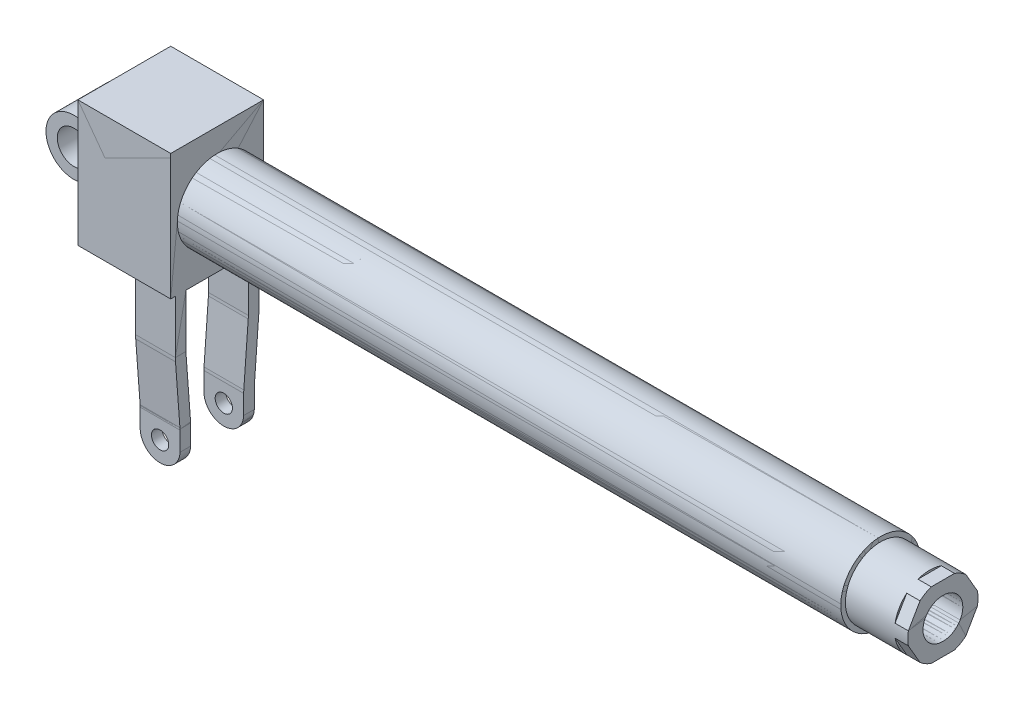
ISO-10303-21;
HEADER;
FILE_DESCRIPTION(('STEP AP214'),'2;1');
FILE_NAME('part.step','',(''),(''),'','','');
FILE_SCHEMA(('AUTOMOTIVE_DESIGN { 1 0 10303 214 1 1 1 1 }'));
ENDSEC;
DATA;
#1=APPLICATION_CONTEXT('core data for automotive mechanical design processes');
#2=APPLICATION_PROTOCOL_DEFINITION('international standard','automotive_design',2000,#1);
#3=PRODUCT_CONTEXT('',#1,'mechanical');
#4=PRODUCT('Part','Part','',(#3));
#5=PRODUCT_RELATED_PRODUCT_CATEGORY('part','',(#4));
#6=PRODUCT_DEFINITION_FORMATION('','',#4);
#7=PRODUCT_DEFINITION_CONTEXT('part definition',#1,'design');
#8=PRODUCT_DEFINITION('design','',#6,#7);
#9=PRODUCT_DEFINITION_SHAPE('','',#8);
#10=(LENGTH_UNIT() NAMED_UNIT(*) SI_UNIT(.MILLI.,.METRE.));
#11=(NAMED_UNIT(*) PLANE_ANGLE_UNIT() SI_UNIT($,.RADIAN.));
#12=(NAMED_UNIT(*) SI_UNIT($,.STERADIAN.) SOLID_ANGLE_UNIT());
#13=UNCERTAINTY_MEASURE_WITH_UNIT(LENGTH_MEASURE(1.E-05),#10,'distance_accuracy_value','');
#14=(GEOMETRIC_REPRESENTATION_CONTEXT(3) GLOBAL_UNCERTAINTY_ASSIGNED_CONTEXT((#13)) GLOBAL_UNIT_ASSIGNED_CONTEXT((#10,
#11,#12)) REPRESENTATION_CONTEXT('',''));
#15=CARTESIAN_POINT('',(0.,0.,0.));
#16=DIRECTION('',(0.,0.,1.));
#17=DIRECTION('',(1.,0.,0.));
#18=AXIS2_PLACEMENT_3D('',#15,#16,#17);
#19=CARTESIAN_POINT('',(0.,0.,20.));
#20=DIRECTION('',(0.,0.,-1.));
#21=DIRECTION('',(-1.,0.,0.));
#22=AXIS2_PLACEMENT_3D('',#19,#20,#21);
#23=CYLINDRICAL_SURFACE('',#22,12.5);
#24=CARTESIAN_POINT('',(0.,0.,20.));
#25=DIRECTION('',(0.,0.,-1.));
#26=DIRECTION('',(-1.,0.,0.));
#27=AXIS2_PLACEMENT_3D('',#24,#25,#26);
#28=CIRCLE('',#27,12.5);
#29=CARTESIAN_POINT('',(-12.5,0.,20.));
#30=VERTEX_POINT('',#29);
#31=EDGE_CURVE('P0_E226',#30,#30,#28,.T.);
#32=CARTESIAN_POINT('',(0.,0.,-20.));
#33=DIRECTION('',(0.,0.,-1.));
#34=DIRECTION('',(-1.,0.,0.));
#35=AXIS2_PLACEMENT_3D('',#32,#33,#34);
#36=CIRCLE('',#35,12.5);
#37=CARTESIAN_POINT('',(-12.5,0.,-20.));
#38=VERTEX_POINT('',#37);
#39=EDGE_CURVE('P0_E227',#38,#38,#36,.T.);
#40=CARTESIAN_POINT('',(-12.5,0.,20.));
#41=CARTESIAN_POINT('',(-12.5,0.,19.5833333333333));
#42=CARTESIAN_POINT('',(-12.5,0.,19.1666666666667));
#43=CARTESIAN_POINT('',(-12.5,0.,18.3333333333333));
#44=CARTESIAN_POINT('',(-12.5,0.,17.9166666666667));
#45=CARTESIAN_POINT('',(-12.5,0.,17.0833333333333));
#46=CARTESIAN_POINT('',(-12.5,0.,16.6666666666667));
#47=CARTESIAN_POINT('',(-12.5,0.,15.8333333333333));
#48=CARTESIAN_POINT('',(-12.5,0.,15.4166666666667));
#49=CARTESIAN_POINT('',(-12.5,0.,14.5833333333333));
#50=CARTESIAN_POINT('',(-12.5,0.,14.1666666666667));
#51=CARTESIAN_POINT('',(-12.5,0.,13.3333333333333));
#52=CARTESIAN_POINT('',(-12.5,0.,12.9166666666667));
#53=CARTESIAN_POINT('',(-12.5,0.,12.0833333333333));
#54=CARTESIAN_POINT('',(-12.5,0.,11.6666666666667));
#55=CARTESIAN_POINT('',(-12.5,0.,10.8333333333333));
#56=CARTESIAN_POINT('',(-12.5,0.,10.4166666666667));
#57=CARTESIAN_POINT('',(-12.5,0.,9.58333333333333));
#58=CARTESIAN_POINT('',(-12.5,0.,9.16666666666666));
#59=CARTESIAN_POINT('',(-12.5,0.,8.33333333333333));
#60=CARTESIAN_POINT('',(-12.5,0.,7.91666666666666));
#61=CARTESIAN_POINT('',(-12.5,0.,7.08333333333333));
#62=CARTESIAN_POINT('',(-12.5,0.,6.66666666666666));
#63=CARTESIAN_POINT('',(-12.5,0.,5.83333333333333));
#64=CARTESIAN_POINT('',(-12.5,0.,5.41666666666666));
#65=CARTESIAN_POINT('',(-12.5,0.,4.58333333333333));
#66=CARTESIAN_POINT('',(-12.5,0.,4.16666666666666));
#67=CARTESIAN_POINT('',(-12.5,0.,3.33333333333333));
#68=CARTESIAN_POINT('',(-12.5,0.,2.91666666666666));
#69=CARTESIAN_POINT('',(-12.5,0.,2.08333333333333));
#70=CARTESIAN_POINT('',(-12.5,0.,1.66666666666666));
#71=CARTESIAN_POINT('',(-12.5,0.,0.833333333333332));
#72=CARTESIAN_POINT('',(-12.5,0.,0.416666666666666));
#73=CARTESIAN_POINT('',(-12.5,0.,-0.416666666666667));
#74=CARTESIAN_POINT('',(-12.5,0.,-0.833333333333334));
#75=CARTESIAN_POINT('',(-12.5,0.,-1.66666666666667));
#76=CARTESIAN_POINT('',(-12.5,0.,-2.08333333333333));
#77=CARTESIAN_POINT('',(-12.5,0.,-2.91666666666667));
#78=CARTESIAN_POINT('',(-12.5,0.,-3.33333333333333));
#79=CARTESIAN_POINT('',(-12.5,0.,-4.16666666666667));
#80=CARTESIAN_POINT('',(-12.5,0.,-4.58333333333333));
#81=CARTESIAN_POINT('',(-12.5,0.,-5.41666666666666));
#82=CARTESIAN_POINT('',(-12.5,0.,-5.83333333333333));
#83=CARTESIAN_POINT('',(-12.5,0.,-6.66666666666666));
#84=CARTESIAN_POINT('',(-12.5,0.,-7.08333333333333));
#85=CARTESIAN_POINT('',(-12.5,0.,-7.91666666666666));
#86=CARTESIAN_POINT('',(-12.5,0.,-8.33333333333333));
#87=CARTESIAN_POINT('',(-12.5,0.,-9.16666666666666));
#88=CARTESIAN_POINT('',(-12.5,0.,-9.58333333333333));
#89=CARTESIAN_POINT('',(-12.5,0.,-10.4166666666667));
#90=CARTESIAN_POINT('',(-12.5,0.,-10.8333333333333));
#91=CARTESIAN_POINT('',(-12.5,0.,-11.6666666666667));
#92=CARTESIAN_POINT('',(-12.5,0.,-12.0833333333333));
#93=CARTESIAN_POINT('',(-12.5,0.,-12.9166666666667));
#94=CARTESIAN_POINT('',(-12.5,0.,-13.3333333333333));
#95=CARTESIAN_POINT('',(-12.5,0.,-14.1666666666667));
#96=CARTESIAN_POINT('',(-12.5,0.,-14.5833333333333));
#97=CARTESIAN_POINT('',(-12.5,0.,-15.4166666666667));
#98=CARTESIAN_POINT('',(-12.5,0.,-15.8333333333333));
#99=CARTESIAN_POINT('',(-12.5,0.,-16.6666666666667));
#100=CARTESIAN_POINT('',(-12.5,0.,-17.0833333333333));
#101=CARTESIAN_POINT('',(-12.5,0.,-17.9166666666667));
#102=CARTESIAN_POINT('',(-12.5,0.,-18.3333333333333));
#103=CARTESIAN_POINT('',(-12.5,0.,-19.1666666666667));
#104=CARTESIAN_POINT('',(-12.5,0.,-19.5833333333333));
#105=CARTESIAN_POINT('',(-12.5,0.,-20.));
#106=B_SPLINE_CURVE_WITH_KNOTS('',3,(#40,#41,#42,#43,#44,#45,#46,#47,#48,#49,#50,#51,#52,#53,
#54,#55,#56,#57,#58,#59,#60,#61,#62,#63,#64,#65,#66,#67,#68,#69,#70,#71,#72,#73,#74,#75,#76,#77,
#78,#79,#80,#81,#82,#83,#84,#85,#86,#87,#88,#89,#90,#91,#92,#93,#94,#95,#96,#97,#98,#99,#100,
#101,#102,#103,#104,#105),.UNSPECIFIED.,.F.,.F.,(4,2,2,2,2,2,2,2,2,2,2,2,2,2,2,2,2,2,2,2,2,2,2,
2,2,2,2,2,2,2,2,2,4),(0.,1.25,2.5,3.75,5.,6.25,7.5,8.75,9.99999999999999,11.25,12.5,13.75,15.,
16.25,17.5,18.75,20.,21.25,22.5,23.75,25.,26.25,27.5,28.75,30.,31.25,32.5,33.75,35.,36.25,37.5,
38.75,40.),.UNSPECIFIED.);
#107=EDGE_CURVE('P0_BSEAM26',#30,#38,#106,.T.);
#108=ORIENTED_EDGE('',*,*,#31,.F.);
#109=ORIENTED_EDGE('',*,*,#39,.T.);
#110=ORIENTED_EDGE('',*,*,#107,.T.);
#111=ORIENTED_EDGE('',*,*,#107,.F.);
#112=EDGE_LOOP('',(#108,#110,#109,#111));
#113=FACE_BOUND('',#112,.T.);
#114=ADVANCED_FACE('P0_F26',(#113),#23,.F.);
#115=CARTESIAN_POINT('',(85.,0.,0.));
#116=DIRECTION('',(1.,0.,0.));
#117=DIRECTION('',(0.,1.,0.));
#118=AXIS2_PLACEMENT_3D('',#115,#116,#117);
#119=CYLINDRICAL_SURFACE('',#118,15.);
#120=CARTESIAN_POINT('',(535.000000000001,2.08166817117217E-13,0.));
#121=DIRECTION('',(1.,0.,0.));
#122=DIRECTION('',(0.,1.,0.));
#123=AXIS2_PLACEMENT_3D('',#120,#121,#122);
#124=CIRCLE('',#123,15.);
#125=CARTESIAN_POINT('',(535.000000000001,15.0000000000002,0.));
#126=VERTEX_POINT('',#125);
#127=EDGE_CURVE('P0_E30',#126,#126,#124,.F.);
#128=ORIENTED_EDGE('',*,*,#127,.T.);
#129=EDGE_LOOP('',(#128));
#130=FACE_BOUND('',#129,.T.);
#131=CARTESIAN_POINT('',(635.000000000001,1.80411241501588E-13,0.));
#132=DIRECTION('',(1.,0.,0.));
#133=DIRECTION('',(0.,1.,0.));
#134=AXIS2_PLACEMENT_3D('',#131,#132,#133);
#135=CIRCLE('',#134,15.);
#136=CARTESIAN_POINT('',(635.000000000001,15.0000000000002,0.));
#137=VERTEX_POINT('',#136);
#138=EDGE_CURVE('P0_E394',#137,#137,#135,.F.);
#139=ORIENTED_EDGE('',*,*,#138,.F.);
#140=EDGE_LOOP('',(#139));
#141=FACE_BOUND('',#140,.T.);
#142=ADVANCED_FACE('P0_F677',(#130,#141),#119,.F.);
#143=CARTESIAN_POINT('',(0.,0.,-20.));
#144=DIRECTION('',(0.,0.,1.));
#145=DIRECTION('',(1.,0.,0.));
#146=AXIS2_PLACEMENT_3D('',#143,#144,#145);
#147=PLANE('',#146);
#148=CARTESIAN_POINT('',(0.,0.,-20.));
#149=DIRECTION('',(0.,0.,-1.));
#150=DIRECTION('',(-1.,0.,0.));
#151=AXIS2_PLACEMENT_3D('',#148,#149,#150);
#152=CIRCLE('',#151,21.);
#153=CARTESIAN_POINT('',(18.,10.816653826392,-20.));
#154=VERTEX_POINT('',#153);
#155=CARTESIAN_POINT('',(18.,-10.816653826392,-20.));
#156=VERTEX_POINT('',#155);
#157=EDGE_CURVE('P0_E220',#154,#156,#152,.F.);
#158=ORIENTED_EDGE('',*,*,#157,.F.);
#159=DIRECTION('',(0.,1.,0.));
#160=VECTOR('',#159,1.);
#161=CARTESIAN_POINT('',(18.,47.5,-20.));
#162=LINE('',#161,#160);
#163=EDGE_CURVE('P0_E218',#154,#156,#162,.F.);
#164=ORIENTED_EDGE('',*,*,#163,.T.);
#165=EDGE_LOOP('',(#158,#164));
#166=FACE_BOUND('',#165,.T.);
#167=ORIENTED_EDGE('',*,*,#39,.F.);
#168=EDGE_LOOP('',(#167));
#169=FACE_BOUND('',#168,.T.);
#170=ADVANCED_FACE('P0_F222',(#166,#169),#147,.F.);
#171=CARTESIAN_POINT('',(0.,0.,20.));
#172=DIRECTION('',(0.,0.,-1.));
#173=DIRECTION('',(-1.,0.,0.));
#174=AXIS2_PLACEMENT_3D('',#171,#172,#173);
#175=CYLINDRICAL_SURFACE('',#174,21.);
#176=ORIENTED_EDGE('',*,*,#157,.T.);
#177=DIRECTION('',(0.,0.,1.));
#178=VECTOR('',#177,1.);
#179=CARTESIAN_POINT('',(18.,-10.816653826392,35.));
#180=LINE('',#179,#178);
#181=CARTESIAN_POINT('',(18.,-10.816653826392,20.));
#182=VERTEX_POINT('',#181);
#183=EDGE_CURVE('P0_E241',#156,#182,#180,.T.);
#184=ORIENTED_EDGE('',*,*,#183,.T.);
#185=CARTESIAN_POINT('',(0.,0.,20.));
#186=DIRECTION('',(0.,0.,-1.));
#187=DIRECTION('',(-1.,0.,0.));
#188=AXIS2_PLACEMENT_3D('',#185,#186,#187);
#189=CIRCLE('',#188,21.);
#190=CARTESIAN_POINT('',(18.,10.816653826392,20.));
#191=VERTEX_POINT('',#190);
#192=EDGE_CURVE('P0_E233',#191,#182,#189,.F.);
#193=ORIENTED_EDGE('',*,*,#192,.F.);
#194=DIRECTION('',(0.,0.,1.));
#195=VECTOR('',#194,1.);
#196=CARTESIAN_POINT('',(18.,10.816653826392,35.));
#197=LINE('',#196,#195);
#198=EDGE_CURVE('P0_E230',#191,#154,#197,.F.);
#199=ORIENTED_EDGE('',*,*,#198,.T.);
#200=EDGE_LOOP('',(#176,#184,#193,#199));
#201=FACE_BOUND('',#200,.T.);
#202=ADVANCED_FACE('P0_F231',(#201),#175,.T.);
#203=CARTESIAN_POINT('',(0.,0.,20.));
#204=DIRECTION('',(0.,0.,1.));
#205=DIRECTION('',(1.,0.,0.));
#206=AXIS2_PLACEMENT_3D('',#203,#204,#205);
#207=PLANE('',#206);
#208=ORIENTED_EDGE('',*,*,#192,.T.);
#209=DIRECTION('',(0.,1.,0.));
#210=VECTOR('',#209,1.);
#211=CARTESIAN_POINT('',(18.,47.5,20.));
#212=LINE('',#211,#210);
#213=EDGE_CURVE('P0_E243',#182,#191,#212,.T.);
#214=ORIENTED_EDGE('',*,*,#213,.T.);
#215=EDGE_LOOP('',(#208,#214));
#216=FACE_BOUND('',#215,.T.);
#217=ORIENTED_EDGE('',*,*,#31,.T.);
#218=EDGE_LOOP('',(#217));
#219=FACE_BOUND('',#218,.T.);
#220=ADVANCED_FACE('P0_F669',(#216,#219),#207,.T.);
#221=CARTESIAN_POINT('',(625.000000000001,1.2490009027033E-13,0.));
#222=DIRECTION('',(1.,0.,0.));
#223=DIRECTION('',(0.,1.,0.));
#224=AXIS2_PLACEMENT_3D('',#221,#222,#223);
#225=PLANE('',#224);
#226=CARTESIAN_POINT('',(625.000000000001,2.08166817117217E-13,0.));
#227=DIRECTION('',(-1.,0.,0.));
#228=DIRECTION('',(0.,-1.,0.));
#229=AXIS2_PLACEMENT_3D('',#226,#227,#228);
#230=CIRCLE('',#229,26.5);
#231=CARTESIAN_POINT('',(625.,20.1116686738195,-17.2560361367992));
#232=VERTEX_POINT('',#231);
#233=CARTESIAN_POINT('',(625.,4.88833132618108,-26.0452340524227));
#234=VERTEX_POINT('',#233);
#235=EDGE_CURVE('P0_E378',#232,#234,#230,.T.);
#236=ORIENTED_EDGE('',*,*,#235,.F.);
#237=DIRECTION('',(0.,0.86602540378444,0.499999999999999));
#238=VECTOR('',#237,1.);
#239=CARTESIAN_POINT('',(625.000000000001,2.4980018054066E-13,-28.8675134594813));
#240=LINE('',#239,#238);
#241=EDGE_CURVE('P0_E400',#234,#232,#240,.T.);
#242=ORIENTED_EDGE('',*,*,#241,.F.);
#243=EDGE_LOOP('',(#236,#242));
#244=FACE_BOUND('',#243,.T.);
#245=ADVANCED_FACE('P0_F672',(#244),#225,.T.);
#246=CARTESIAN_POINT('',(625.000000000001,2.4980018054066E-13,-28.8675134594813));
#247=DIRECTION('',(0.,0.5,-0.866025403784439));
#248=DIRECTION('',(0.,0.86602540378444,0.499999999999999));
#249=AXIS2_PLACEMENT_3D('',#246,#247,#248);
#250=PLANE('',#249);
#251=DIRECTION('',(-1.,0.,0.));
#252=VECTOR('',#251,1.);
#253=CARTESIAN_POINT('',(635.,20.1116686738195,-17.2560361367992));
#254=LINE('',#253,#252);
#255=CARTESIAN_POINT('',(635.,20.1116686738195,-17.2560361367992));
#256=VERTEX_POINT('',#255);
#257=EDGE_CURVE('P0_E381',#256,#232,#254,.T.);
#258=ORIENTED_EDGE('',*,*,#257,.F.);
#259=DIRECTION('',(0.,0.86602540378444,0.499999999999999));
#260=VECTOR('',#259,1.);
#261=CARTESIAN_POINT('',(635.000000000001,4.88833132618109,-26.0452340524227));
#262=LINE('',#261,#260);
#263=CARTESIAN_POINT('',(635.000000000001,4.88833132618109,-26.0452340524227));
#264=VERTEX_POINT('',#263);
#265=EDGE_CURVE('P0_E417',#264,#256,#262,.T.);
#266=ORIENTED_EDGE('',*,*,#265,.F.);
#267=DIRECTION('',(-1.,0.,0.));
#268=VECTOR('',#267,1.);
#269=CARTESIAN_POINT('',(635.000000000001,4.88833132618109,-26.0452340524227));
#270=LINE('',#269,#268);
#271=EDGE_CURVE('P0_E377',#234,#264,#270,.F.);
#272=ORIENTED_EDGE('',*,*,#271,.F.);
#273=ORIENTED_EDGE('',*,*,#241,.T.);
#274=EDGE_LOOP('',(#258,#266,#272,#273));
#275=FACE_BOUND('',#274,.T.);
#276=ADVANCED_FACE('P0_F933',(#275),#250,.T.);
#277=CARTESIAN_POINT('',(625.000000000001,1.2490009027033E-13,0.));
#278=DIRECTION('',(1.,0.,0.));
#279=DIRECTION('',(0.,1.,0.));
#280=AXIS2_PLACEMENT_3D('',#277,#278,#279);
#281=PLANE('',#280);
#282=CARTESIAN_POINT('',(625.000000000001,2.08166817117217E-13,0.));
#283=DIRECTION('',(-1.,0.,0.));
#284=DIRECTION('',(0.,-1.,0.));
#285=AXIS2_PLACEMENT_3D('',#282,#283,#284);
#286=CIRCLE('',#285,26.5);
#287=CARTESIAN_POINT('',(625.,-4.8883313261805,-26.0452340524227));
#288=VERTEX_POINT('',#287);
#289=CARTESIAN_POINT('',(625.000000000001,-20.111668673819,-17.2560361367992));
#290=VERTEX_POINT('',#289);
#291=EDGE_CURVE('P0_E370',#288,#290,#286,.T.);
#292=ORIENTED_EDGE('',*,*,#291,.F.);
#293=DIRECTION('',(0.,0.86602540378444,-0.5));
#294=VECTOR('',#293,1.);
#295=CARTESIAN_POINT('',(625.,-24.9999999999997,-14.4337567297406));
#296=LINE('',#295,#294);
#297=EDGE_CURVE('P0_E652',#290,#288,#296,.T.);
#298=ORIENTED_EDGE('',*,*,#297,.F.);
#299=EDGE_LOOP('',(#292,#298));
#300=FACE_BOUND('',#299,.T.);
#301=ADVANCED_FACE('P0_F943',(#300),#281,.T.);
#302=CARTESIAN_POINT('',(625.,-24.9999999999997,-14.4337567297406));
#303=DIRECTION('',(0.,-0.5,-0.866025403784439));
#304=DIRECTION('',(0.,0.86602540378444,-0.5));
#305=AXIS2_PLACEMENT_3D('',#302,#303,#304);
#306=PLANE('',#305);
#307=DIRECTION('',(-1.,0.,0.));
#308=VECTOR('',#307,1.);
#309=CARTESIAN_POINT('',(635.,-4.88833132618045,-26.0452340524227));
#310=LINE('',#309,#308);
#311=CARTESIAN_POINT('',(635.,-4.88833132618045,-26.0452340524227));
#312=VERTEX_POINT('',#311);
#313=EDGE_CURVE('P0_E373',#312,#288,#310,.T.);
#314=ORIENTED_EDGE('',*,*,#313,.F.);
#315=DIRECTION('',(0.,0.86602540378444,-0.5));
#316=VECTOR('',#315,1.);
#317=CARTESIAN_POINT('',(635.000000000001,-20.111668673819,-17.2560361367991));
#318=LINE('',#317,#316);
#319=CARTESIAN_POINT('',(635.000000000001,-20.111668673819,-17.2560361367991));
#320=VERTEX_POINT('',#319);
#321=EDGE_CURVE('P0_E420',#320,#312,#318,.T.);
#322=ORIENTED_EDGE('',*,*,#321,.F.);
#323=DIRECTION('',(-1.,0.,0.));
#324=VECTOR('',#323,1.);
#325=CARTESIAN_POINT('',(635.000000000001,-20.111668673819,-17.2560361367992));
#326=LINE('',#325,#324);
#327=EDGE_CURVE('P0_E369',#290,#320,#326,.F.);
#328=ORIENTED_EDGE('',*,*,#327,.F.);
#329=ORIENTED_EDGE('',*,*,#297,.T.);
#330=EDGE_LOOP('',(#314,#322,#328,#329));
#331=FACE_BOUND('',#330,.T.);
#332=ADVANCED_FACE('P0_F949',(#331),#306,.T.);
#333=CARTESIAN_POINT('',(625.000000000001,1.2490009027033E-13,0.));
#334=DIRECTION('',(1.,0.,0.));
#335=DIRECTION('',(0.,1.,0.));
#336=AXIS2_PLACEMENT_3D('',#333,#334,#335);
#337=PLANE('',#336);
#338=CARTESIAN_POINT('',(625.000000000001,2.08166817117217E-13,0.));
#339=DIRECTION('',(-1.,0.,0.));
#340=DIRECTION('',(0.,-1.,0.));
#341=AXIS2_PLACEMENT_3D('',#338,#339,#340);
#342=CIRCLE('',#341,26.5);
#343=CARTESIAN_POINT('',(625.000000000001,25.0000000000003,8.78919791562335));
#344=VERTEX_POINT('',#343);
#345=CARTESIAN_POINT('',(625.000000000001,25.0000000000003,-8.78919791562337));
#346=VERTEX_POINT('',#345);
#347=EDGE_CURVE('P0_E363',#344,#346,#342,.T.);
#348=ORIENTED_EDGE('',*,*,#347,.F.);
#349=DIRECTION('',(0.,0.,1.));
#350=VECTOR('',#349,1.);
#351=CARTESIAN_POINT('',(625.000000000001,25.0000000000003,-14.4337567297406));
#352=LINE('',#351,#350);
#353=EDGE_CURVE('P0_E419',#346,#344,#352,.T.);
#354=ORIENTED_EDGE('',*,*,#353,.F.);
#355=EDGE_LOOP('',(#348,#354));
#356=FACE_BOUND('',#355,.T.);
#357=ADVANCED_FACE('P0_F929',(#356),#337,.T.);
#358=CARTESIAN_POINT('',(625.000000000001,1.2490009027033E-13,0.));
#359=DIRECTION('',(1.,0.,0.));
#360=DIRECTION('',(0.,1.,0.));
#361=AXIS2_PLACEMENT_3D('',#358,#359,#360);
#362=PLANE('',#361);
#363=CARTESIAN_POINT('',(625.000000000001,2.08166817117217E-13,0.));
#364=DIRECTION('',(-1.,0.,0.));
#365=DIRECTION('',(0.,-1.,0.));
#366=AXIS2_PLACEMENT_3D('',#363,#364,#365);
#367=CIRCLE('',#366,26.5);
#368=CARTESIAN_POINT('',(625.,-24.9999999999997,-8.78919791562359));
#369=VERTEX_POINT('',#368);
#370=CARTESIAN_POINT('',(625.,-24.9999999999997,8.78919791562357));
#371=VERTEX_POINT('',#370);
#372=EDGE_CURVE('P0_E360',#369,#371,#367,.T.);
#373=ORIENTED_EDGE('',*,*,#372,.F.);
#374=DIRECTION('',(0.,0.,1.));
#375=VECTOR('',#374,1.);
#376=CARTESIAN_POINT('',(625.,-24.9999999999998,14.4337567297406));
#377=LINE('',#376,#375);
#378=EDGE_CURVE('P0_E645',#371,#369,#377,.F.);
#379=ORIENTED_EDGE('',*,*,#378,.F.);
#380=EDGE_LOOP('',(#373,#379));
#381=FACE_BOUND('',#380,.T.);
#382=ADVANCED_FACE('P0_F956',(#381),#362,.T.);
#383=CARTESIAN_POINT('',(625.,-24.9999999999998,14.4337567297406));
#384=DIRECTION('',(0.,-1.,0.));
#385=DIRECTION('',(1.,0.,0.));
#386=AXIS2_PLACEMENT_3D('',#383,#384,#385);
#387=PLANE('',#386);
#388=DIRECTION('',(-1.,0.,0.));
#389=VECTOR('',#388,1.);
#390=CARTESIAN_POINT('',(635.000000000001,-24.9999999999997,-8.7891979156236));
#391=LINE('',#390,#389);
#392=CARTESIAN_POINT('',(635.000000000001,-24.9999999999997,-8.78919791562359));
#393=VERTEX_POINT('',#392);
#394=EDGE_CURVE('P0_E365',#393,#369,#391,.T.);
#395=ORIENTED_EDGE('',*,*,#394,.F.);
#396=DIRECTION('',(0.,0.,1.));
#397=VECTOR('',#396,1.);
#398=CARTESIAN_POINT('',(635.000000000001,-24.9999999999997,0.));
#399=LINE('',#398,#397);
#400=CARTESIAN_POINT('',(635.000000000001,-24.9999999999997,8.78919791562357));
#401=VERTEX_POINT('',#400);
#402=EDGE_CURVE('P0_E422',#401,#393,#399,.F.);
#403=ORIENTED_EDGE('',*,*,#402,.F.);
#404=DIRECTION('',(-1.,0.,0.));
#405=VECTOR('',#404,1.);
#406=CARTESIAN_POINT('',(635.000000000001,-24.9999999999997,8.78919791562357));
#407=LINE('',#406,#405);
#408=EDGE_CURVE('P0_E359',#371,#401,#407,.F.);
#409=ORIENTED_EDGE('',*,*,#408,.F.);
#410=ORIENTED_EDGE('',*,*,#378,.T.);
#411=EDGE_LOOP('',(#395,#403,#409,#410));
#412=FACE_BOUND('',#411,.T.);
#413=ADVANCED_FACE('P0_F959',(#412),#387,.T.);
#414=CARTESIAN_POINT('',(625.000000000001,1.2490009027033E-13,0.));
#415=DIRECTION('',(1.,0.,0.));
#416=DIRECTION('',(0.,1.,0.));
#417=AXIS2_PLACEMENT_3D('',#414,#415,#416);
#418=PLANE('',#417);
#419=CARTESIAN_POINT('',(625.000000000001,2.08166817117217E-13,0.));
#420=DIRECTION('',(-1.,0.,0.));
#421=DIRECTION('',(0.,-1.,0.));
#422=AXIS2_PLACEMENT_3D('',#419,#420,#421);
#423=CIRCLE('',#422,26.5);
#424=CARTESIAN_POINT('',(625.,-20.111668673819,17.2560361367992));
#425=VERTEX_POINT('',#424);
#426=CARTESIAN_POINT('',(625.,-4.88833132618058,26.0452340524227));
#427=VERTEX_POINT('',#426);
#428=EDGE_CURVE('P0_E352',#425,#427,#423,.T.);
#429=ORIENTED_EDGE('',*,*,#428,.F.);
#430=DIRECTION('',(0.,-0.86602540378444,-0.499999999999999));
#431=VECTOR('',#430,1.);
#432=CARTESIAN_POINT('',(625.,2.22044604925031E-13,28.8675134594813));
#433=LINE('',#432,#431);
#434=EDGE_CURVE('P0_E639',#427,#425,#433,.T.);
#435=ORIENTED_EDGE('',*,*,#434,.F.);
#436=EDGE_LOOP('',(#429,#435));
#437=FACE_BOUND('',#436,.T.);
#438=ADVANCED_FACE('P0_F963',(#437),#418,.T.);
#439=CARTESIAN_POINT('',(625.,2.22044604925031E-13,28.8675134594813));
#440=DIRECTION('',(0.,-0.5,0.866025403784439));
#441=DIRECTION('',(0.,-0.86602540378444,-0.499999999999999));
#442=AXIS2_PLACEMENT_3D('',#439,#440,#441);
#443=PLANE('',#442);
#444=DIRECTION('',(-1.,0.,0.));
#445=VECTOR('',#444,1.);
#446=CARTESIAN_POINT('',(635.,-20.111668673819,17.2560361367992));
#447=LINE('',#446,#445);
#448=CARTESIAN_POINT('',(635.,-20.111668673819,17.2560361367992));
#449=VERTEX_POINT('',#448);
#450=EDGE_CURVE('P0_E355',#449,#425,#447,.T.);
#451=ORIENTED_EDGE('',*,*,#450,.F.);
#452=DIRECTION('',(0.,-0.866025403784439,-0.499999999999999));
#453=VECTOR('',#452,1.);
#454=CARTESIAN_POINT('',(635.,-4.88833132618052,26.0452340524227));
#455=LINE('',#454,#453);
#456=CARTESIAN_POINT('',(635.,-4.88833132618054,26.0452340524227));
#457=VERTEX_POINT('',#456);
#458=EDGE_CURVE('P0_E424',#457,#449,#455,.T.);
#459=ORIENTED_EDGE('',*,*,#458,.F.);
#460=DIRECTION('',(-1.,0.,0.));
#461=VECTOR('',#460,1.);
#462=CARTESIAN_POINT('',(635.,-4.88833132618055,26.0452340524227));
#463=LINE('',#462,#461);
#464=EDGE_CURVE('P0_E351',#427,#457,#463,.F.);
#465=ORIENTED_EDGE('',*,*,#464,.F.);
#466=ORIENTED_EDGE('',*,*,#434,.T.);
#467=EDGE_LOOP('',(#451,#459,#465,#466));
#468=FACE_BOUND('',#467,.T.);
#469=ADVANCED_FACE('P0_F967',(#468),#443,.T.);
#470=CARTESIAN_POINT('',(625.000000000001,1.2490009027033E-13,0.));
#471=DIRECTION('',(1.,0.,0.));
#472=DIRECTION('',(0.,1.,0.));
#473=AXIS2_PLACEMENT_3D('',#470,#471,#472);
#474=PLANE('',#473);
#475=CARTESIAN_POINT('',(625.000000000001,2.08166817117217E-13,0.));
#476=DIRECTION('',(-1.,0.,0.));
#477=DIRECTION('',(0.,-1.,0.));
#478=AXIS2_PLACEMENT_3D('',#475,#476,#477);
#479=CIRCLE('',#478,26.5);
#480=CARTESIAN_POINT('',(625.,4.88833132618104,26.0452340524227));
#481=VERTEX_POINT('',#480);
#482=CARTESIAN_POINT('',(625.,20.1116686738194,17.2560361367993));
#483=VERTEX_POINT('',#482);
#484=EDGE_CURVE('P0_E344',#481,#483,#479,.T.);
#485=ORIENTED_EDGE('',*,*,#484,.F.);
#486=DIRECTION('',(0.,-0.86602540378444,0.5));
#487=VECTOR('',#486,1.);
#488=CARTESIAN_POINT('',(625.000000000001,25.0000000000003,14.4337567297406));
#489=LINE('',#488,#487);
#490=EDGE_CURVE('P0_E398',#483,#481,#489,.T.);
#491=ORIENTED_EDGE('',*,*,#490,.F.);
#492=EDGE_LOOP('',(#485,#491));
#493=FACE_BOUND('',#492,.T.);
#494=ADVANCED_FACE('P0_F971',(#493),#474,.T.);
#495=CARTESIAN_POINT('',(625.000000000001,25.0000000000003,14.4337567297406));
#496=DIRECTION('',(0.,0.5,0.866025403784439));
#497=DIRECTION('',(0.,-0.86602540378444,0.5));
#498=AXIS2_PLACEMENT_3D('',#495,#496,#497);
#499=PLANE('',#498);
#500=DIRECTION('',(-1.,0.,0.));
#501=VECTOR('',#500,1.);
#502=CARTESIAN_POINT('',(635.000000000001,4.88833132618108,26.0452340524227));
#503=LINE('',#502,#501);
#504=CARTESIAN_POINT('',(635.000000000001,4.88833132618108,26.0452340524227));
#505=VERTEX_POINT('',#504);
#506=EDGE_CURVE('P0_E347',#505,#481,#503,.T.);
#507=ORIENTED_EDGE('',*,*,#506,.F.);
#508=DIRECTION('',(0.,-0.86602540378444,0.5));
#509=VECTOR('',#508,1.);
#510=CARTESIAN_POINT('',(635.,20.1116686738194,17.2560361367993));
#511=LINE('',#510,#509);
#512=CARTESIAN_POINT('',(635.,20.1116686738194,17.2560361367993));
#513=VERTEX_POINT('',#512);
#514=EDGE_CURVE('P0_E397',#513,#505,#511,.T.);
#515=ORIENTED_EDGE('',*,*,#514,.F.);
#516=DIRECTION('',(-1.,0.,0.));
#517=VECTOR('',#516,1.);
#518=CARTESIAN_POINT('',(635.,20.1116686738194,17.2560361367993));
#519=LINE('',#518,#517);
#520=EDGE_CURVE('P0_E343',#483,#513,#519,.F.);
#521=ORIENTED_EDGE('',*,*,#520,.F.);
#522=ORIENTED_EDGE('',*,*,#490,.T.);
#523=EDGE_LOOP('',(#507,#515,#521,#522));
#524=FACE_BOUND('',#523,.T.);
#525=ADVANCED_FACE('P0_F975',(#524),#499,.T.);
#526=CARTESIAN_POINT('',(635.000000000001,1.80411241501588E-13,0.));
#527=DIRECTION('',(1.,0.,0.));
#528=DIRECTION('',(0.,1.,0.));
#529=AXIS2_PLACEMENT_3D('',#526,#527,#528);
#530=PLANE('',#529);
#531=CARTESIAN_POINT('',(635.000000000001,1.80411241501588E-13,0.));
#532=DIRECTION('',(-1.,0.,0.));
#533=DIRECTION('',(0.,-1.,0.));
#534=AXIS2_PLACEMENT_3D('',#531,#532,#533);
#535=CIRCLE('',#534,26.5);
#536=CARTESIAN_POINT('',(635.000000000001,25.0000000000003,-8.78919791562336));
#537=VERTEX_POINT('',#536);
#538=EDGE_CURVE('P0_E382',#537,#256,#535,.T.);
#539=ORIENTED_EDGE('',*,*,#538,.F.);
#540=DIRECTION('',(0.,0.,1.));
#541=VECTOR('',#540,1.);
#542=CARTESIAN_POINT('',(635.000000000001,25.0000000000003,-14.4337567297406));
#543=LINE('',#542,#541);
#544=CARTESIAN_POINT('',(635.000000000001,25.0000000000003,8.78919791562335));
#545=VERTEX_POINT('',#544);
#546=EDGE_CURVE('P0_E393',#545,#537,#543,.F.);
#547=ORIENTED_EDGE('',*,*,#546,.F.);
#548=CARTESIAN_POINT('',(635.000000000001,1.80411241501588E-13,0.));
#549=DIRECTION('',(-1.,0.,0.));
#550=DIRECTION('',(0.,-1.,0.));
#551=AXIS2_PLACEMENT_3D('',#548,#549,#550);
#552=CIRCLE('',#551,26.5);
#553=EDGE_CURVE('P0_E339',#513,#545,#552,.T.);
#554=ORIENTED_EDGE('',*,*,#553,.F.);
#555=ORIENTED_EDGE('',*,*,#514,.T.);
#556=CARTESIAN_POINT('',(635.000000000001,1.80411241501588E-13,0.));
#557=DIRECTION('',(-1.,0.,0.));
#558=DIRECTION('',(0.,-1.,0.));
#559=AXIS2_PLACEMENT_3D('',#556,#557,#558);
#560=CIRCLE('',#559,26.5);
#561=EDGE_CURVE('P0_E348',#457,#505,#560,.T.);
#562=ORIENTED_EDGE('',*,*,#561,.F.);
#563=ORIENTED_EDGE('',*,*,#458,.T.);
#564=CARTESIAN_POINT('',(635.000000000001,1.80411241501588E-13,0.));
#565=DIRECTION('',(-1.,0.,0.));
#566=DIRECTION('',(0.,-1.,0.));
#567=AXIS2_PLACEMENT_3D('',#564,#565,#566);
#568=CIRCLE('',#567,26.5);
#569=EDGE_CURVE('P0_E356',#401,#449,#568,.T.);
#570=ORIENTED_EDGE('',*,*,#569,.F.);
#571=ORIENTED_EDGE('',*,*,#402,.T.);
#572=CARTESIAN_POINT('',(635.000000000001,1.80411241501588E-13,0.));
#573=DIRECTION('',(-1.,0.,0.));
#574=DIRECTION('',(0.,-1.,0.));
#575=AXIS2_PLACEMENT_3D('',#572,#573,#574);
#576=CIRCLE('',#575,26.5);
#577=EDGE_CURVE('P0_E366',#320,#393,#576,.T.);
#578=ORIENTED_EDGE('',*,*,#577,.F.);
#579=ORIENTED_EDGE('',*,*,#321,.T.);
#580=CARTESIAN_POINT('',(635.000000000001,1.80411241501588E-13,0.));
#581=DIRECTION('',(-1.,0.,0.));
#582=DIRECTION('',(0.,-1.,0.));
#583=AXIS2_PLACEMENT_3D('',#580,#581,#582);
#584=CIRCLE('',#583,26.5);
#585=EDGE_CURVE('P0_E374',#264,#312,#584,.T.);
#586=ORIENTED_EDGE('',*,*,#585,.F.);
#587=ORIENTED_EDGE('',*,*,#265,.T.);
#588=EDGE_LOOP('',(#539,#547,#554,#555,#562,#563,#570,#571,#578,#579,#586,#587));
#589=FACE_BOUND('',#588,.T.);
#590=ORIENTED_EDGE('',*,*,#138,.T.);
#591=EDGE_LOOP('',(#590));
#592=FACE_BOUND('',#591,.T.);
#593=ADVANCED_FACE('P0_F920',(#589,#592),#530,.T.);
#594=CARTESIAN_POINT('',(625.000000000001,25.0000000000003,-14.4337567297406));
#595=DIRECTION('',(0.,1.,0.));
#596=DIRECTION('',(-1.,0.,0.));
#597=AXIS2_PLACEMENT_3D('',#594,#595,#596);
#598=PLANE('',#597);
#599=DIRECTION('',(-1.,0.,0.));
#600=VECTOR('',#599,1.);
#601=CARTESIAN_POINT('',(635.000000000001,25.0000000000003,8.78919791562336));
#602=LINE('',#601,#600);
#603=EDGE_CURVE('P0_E342',#545,#344,#602,.T.);
#604=ORIENTED_EDGE('',*,*,#603,.F.);
#605=ORIENTED_EDGE('',*,*,#546,.T.);
#606=DIRECTION('',(-1.,0.,0.));
#607=VECTOR('',#606,1.);
#608=CARTESIAN_POINT('',(635.000000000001,25.0000000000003,-8.78919791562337));
#609=LINE('',#608,#607);
#610=EDGE_CURVE('P0_E385',#346,#537,#609,.F.);
#611=ORIENTED_EDGE('',*,*,#610,.F.);
#612=ORIENTED_EDGE('',*,*,#353,.T.);
#613=EDGE_LOOP('',(#604,#605,#611,#612));
#614=FACE_BOUND('',#613,.T.);
#615=ADVANCED_FACE('P0_F926',(#614),#598,.T.);
#616=CARTESIAN_POINT('',(58.0000000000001,-136.618283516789,-50.));
#617=DIRECTION('',(1.,0.,0.));
#618=DIRECTION('',(0.,1.,0.));
#619=AXIS2_PLACEMENT_3D('',#616,#617,#618);
#620=CYLINDRICAL_SURFACE('',#619,22.);
#621=DIRECTION('',(1.,0.,0.));
#622=VECTOR('',#621,1.);
#623=CARTESIAN_POINT('',(58.0000000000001,-136.618283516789,-28.));
#624=LINE('',#623,#622);
#625=CARTESIAN_POINT('',(88.0000000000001,-136.618283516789,-28.));
#626=VERTEX_POINT('',#625);
#627=CARTESIAN_POINT('',(58.0000000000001,-136.618283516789,-28.));
#628=VERTEX_POINT('',#627);
#629=EDGE_CURVE('P0_E327',#626,#628,#624,.F.);
#630=ORIENTED_EDGE('',*,*,#629,.T.);
#631=CARTESIAN_POINT('',(58.0000000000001,-136.618283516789,-50.));
#632=DIRECTION('',(1.,0.,0.));
#633=DIRECTION('',(0.,1.,0.));
#634=AXIS2_PLACEMENT_3D('',#631,#632,#633);
#635=CIRCLE('',#634,22.);
#636=CARTESIAN_POINT('',(58.0000000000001,-134.98041019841,-28.0610535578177));
#637=VERTEX_POINT('',#636);
#638=EDGE_CURVE('P0_E390',#628,#637,#635,.F.);
#639=ORIENTED_EDGE('',*,*,#638,.T.);
#640=DIRECTION('',(1.,0.,0.));
#641=VECTOR('',#640,1.);
#642=CARTESIAN_POINT('',(58.0000000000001,-134.98041019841,-28.0610535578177));
#643=LINE('',#642,#641);
#644=CARTESIAN_POINT('',(88.0000000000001,-134.98041019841,-28.0610535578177));
#645=VERTEX_POINT('',#644);
#646=EDGE_CURVE('P0_E328',#637,#645,#643,.T.);
#647=ORIENTED_EDGE('',*,*,#646,.T.);
#648=CARTESIAN_POINT('',(88.0000000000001,-136.618283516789,-50.));
#649=DIRECTION('',(1.,0.,0.));
#650=DIRECTION('',(0.,1.,0.));
#651=AXIS2_PLACEMENT_3D('',#648,#649,#650);
#652=CIRCLE('',#651,22.);
#653=EDGE_CURVE('P0_E237',#626,#645,#652,.F.);
#654=ORIENTED_EDGE('',*,*,#653,.F.);
#655=EDGE_LOOP('',(#630,#639,#647,#654));
#656=FACE_BOUND('',#655,.T.);
#657=ADVANCED_FACE('P0_F984',(#656),#620,.F.);
#658=CARTESIAN_POINT('',(73.0000000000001,-150.489175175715,-35.));
#659=DIRECTION('',(0.,0.,1.));
#660=DIRECTION('',(1.,0.,0.));
#661=AXIS2_PLACEMENT_3D('',#658,#659,#660);
#662=CYLINDRICAL_SURFACE('',#661,6.50000000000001);
#663=CARTESIAN_POINT('',(73.0000000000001,-150.489175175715,-20.));
#664=DIRECTION('',(0.,0.,1.));
#665=DIRECTION('',(1.,0.,0.));
#666=AXIS2_PLACEMENT_3D('',#663,#664,#665);
#667=CIRCLE('',#666,6.50000000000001);
#668=CARTESIAN_POINT('',(79.5000000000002,-150.489175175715,-20.));
#669=VERTEX_POINT('',#668);
#670=EDGE_CURVE('P0_E317',#669,#669,#667,.F.);
#671=CARTESIAN_POINT('',(73.0000000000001,-150.489175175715,-28.));
#672=DIRECTION('',(0.,0.,1.));
#673=DIRECTION('',(1.,0.,0.));
#674=AXIS2_PLACEMENT_3D('',#671,#672,#673);
#675=CIRCLE('',#674,6.50000000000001);
#676=CARTESIAN_POINT('',(79.5000000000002,-150.489175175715,-28.));
#677=VERTEX_POINT('',#676);
#678=EDGE_CURVE('P0_E324',#677,#677,#675,.F.);
#679=CARTESIAN_POINT('',(79.5000000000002,-150.489175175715,-20.));
#680=CARTESIAN_POINT('',(79.5000000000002,-150.489175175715,-20.0833333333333));
#681=CARTESIAN_POINT('',(79.5000000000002,-150.489175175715,-20.1666666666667));
#682=CARTESIAN_POINT('',(79.5000000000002,-150.489175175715,-20.3333333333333));
#683=CARTESIAN_POINT('',(79.5000000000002,-150.489175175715,-20.4166666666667));
#684=CARTESIAN_POINT('',(79.5000000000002,-150.489175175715,-20.5833333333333));
#685=CARTESIAN_POINT('',(79.5000000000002,-150.489175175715,-20.6666666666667));
#686=CARTESIAN_POINT('',(79.5000000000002,-150.489175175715,-20.8333333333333));
#687=CARTESIAN_POINT('',(79.5000000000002,-150.489175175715,-20.9166666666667));
#688=CARTESIAN_POINT('',(79.5000000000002,-150.489175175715,-21.0833333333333));
#689=CARTESIAN_POINT('',(79.5000000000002,-150.489175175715,-21.1666666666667));
#690=CARTESIAN_POINT('',(79.5000000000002,-150.489175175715,-21.3333333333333));
#691=CARTESIAN_POINT('',(79.5000000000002,-150.489175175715,-21.4166666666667));
#692=CARTESIAN_POINT('',(79.5000000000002,-150.489175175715,-21.5833333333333));
#693=CARTESIAN_POINT('',(79.5000000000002,-150.489175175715,-21.6666666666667));
#694=CARTESIAN_POINT('',(79.5000000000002,-150.489175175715,-21.8333333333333));
#695=CARTESIAN_POINT('',(79.5000000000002,-150.489175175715,-21.9166666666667));
#696=CARTESIAN_POINT('',(79.5000000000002,-150.489175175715,-22.0833333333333));
#697=CARTESIAN_POINT('',(79.5000000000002,-150.489175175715,-22.1666666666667));
#698=CARTESIAN_POINT('',(79.5000000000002,-150.489175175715,-22.3333333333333));
#699=CARTESIAN_POINT('',(79.5000000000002,-150.489175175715,-22.4166666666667));
#700=CARTESIAN_POINT('',(79.5000000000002,-150.489175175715,-22.5833333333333));
#701=CARTESIAN_POINT('',(79.5000000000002,-150.489175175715,-22.6666666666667));
#702=CARTESIAN_POINT('',(79.5000000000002,-150.489175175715,-22.8333333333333));
#703=CARTESIAN_POINT('',(79.5000000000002,-150.489175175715,-22.9166666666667));
#704=CARTESIAN_POINT('',(79.5000000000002,-150.489175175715,-23.0833333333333));
#705=CARTESIAN_POINT('',(79.5000000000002,-150.489175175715,-23.1666666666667));
#706=CARTESIAN_POINT('',(79.5000000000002,-150.489175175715,-23.3333333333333));
#707=CARTESIAN_POINT('',(79.5000000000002,-150.489175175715,-23.4166666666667));
#708=CARTESIAN_POINT('',(79.5000000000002,-150.489175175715,-23.5833333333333));
#709=CARTESIAN_POINT('',(79.5000000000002,-150.489175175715,-23.6666666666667));
#710=CARTESIAN_POINT('',(79.5000000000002,-150.489175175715,-23.8333333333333));
#711=CARTESIAN_POINT('',(79.5000000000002,-150.489175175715,-23.9166666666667));
#712=CARTESIAN_POINT('',(79.5000000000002,-150.489175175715,-24.0833333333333));
#713=CARTESIAN_POINT('',(79.5000000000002,-150.489175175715,-24.1666666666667));
#714=CARTESIAN_POINT('',(79.5000000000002,-150.489175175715,-24.3333333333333));
#715=CARTESIAN_POINT('',(79.5000000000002,-150.489175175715,-24.4166666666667));
#716=CARTESIAN_POINT('',(79.5000000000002,-150.489175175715,-24.5833333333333));
#717=CARTESIAN_POINT('',(79.5000000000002,-150.489175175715,-24.6666666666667));
#718=CARTESIAN_POINT('',(79.5000000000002,-150.489175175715,-24.8333333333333));
#719=CARTESIAN_POINT('',(79.5000000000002,-150.489175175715,-24.9166666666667));
#720=CARTESIAN_POINT('',(79.5000000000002,-150.489175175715,-25.0833333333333));
#721=CARTESIAN_POINT('',(79.5000000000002,-150.489175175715,-25.1666666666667));
#722=CARTESIAN_POINT('',(79.5000000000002,-150.489175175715,-25.3333333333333));
#723=CARTESIAN_POINT('',(79.5000000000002,-150.489175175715,-25.4166666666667));
#724=CARTESIAN_POINT('',(79.5000000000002,-150.489175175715,-25.5833333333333));
#725=CARTESIAN_POINT('',(79.5000000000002,-150.489175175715,-25.6666666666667));
#726=CARTESIAN_POINT('',(79.5000000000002,-150.489175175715,-25.8333333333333));
#727=CARTESIAN_POINT('',(79.5000000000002,-150.489175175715,-25.9166666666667));
#728=CARTESIAN_POINT('',(79.5000000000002,-150.489175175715,-26.0833333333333));
#729=CARTESIAN_POINT('',(79.5000000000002,-150.489175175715,-26.1666666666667));
#730=CARTESIAN_POINT('',(79.5000000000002,-150.489175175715,-26.3333333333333));
#731=CARTESIAN_POINT('',(79.5000000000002,-150.489175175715,-26.4166666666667));
#732=CARTESIAN_POINT('',(79.5000000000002,-150.489175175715,-26.5833333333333));
#733=CARTESIAN_POINT('',(79.5000000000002,-150.489175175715,-26.6666666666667));
#734=CARTESIAN_POINT('',(79.5000000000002,-150.489175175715,-26.8333333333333));
#735=CARTESIAN_POINT('',(79.5000000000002,-150.489175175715,-26.9166666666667));
#736=CARTESIAN_POINT('',(79.5000000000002,-150.489175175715,-27.0833333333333));
#737=CARTESIAN_POINT('',(79.5000000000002,-150.489175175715,-27.1666666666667));
#738=CARTESIAN_POINT('',(79.5000000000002,-150.489175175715,-27.3333333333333));
#739=CARTESIAN_POINT('',(79.5000000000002,-150.489175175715,-27.4166666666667));
#740=CARTESIAN_POINT('',(79.5000000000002,-150.489175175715,-27.5833333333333));
#741=CARTESIAN_POINT('',(79.5000000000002,-150.489175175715,-27.6666666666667));
#742=CARTESIAN_POINT('',(79.5000000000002,-150.489175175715,-27.8333333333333));
#743=CARTESIAN_POINT('',(79.5000000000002,-150.489175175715,-27.9166666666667));
#744=CARTESIAN_POINT('',(79.5000000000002,-150.489175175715,-28.));
#745=B_SPLINE_CURVE_WITH_KNOTS('',3,(#679,#680,#681,#682,#683,#684,#685,#686,#687,#688,#689,
#690,#691,#692,#693,#694,#695,#696,#697,#698,#699,#700,#701,#702,#703,#704,#705,#706,#707,#708,
#709,#710,#711,#712,#713,#714,#715,#716,#717,#718,#719,#720,#721,#722,#723,#724,#725,#726,#727,
#728,#729,#730,#731,#732,#733,#734,#735,#736,#737,#738,#739,#740,#741,#742,#743,#744),
.UNSPECIFIED.,.F.,.F.,(4,2,2,2,2,2,2,2,2,2,2,2,2,2,2,2,2,2,2,2,2,2,2,2,2,2,2,2,2,2,2,2,4),(0.,
0.25,0.5,0.750000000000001,1.,1.25,1.5,1.75,2.,2.25,2.5,2.75,3.,3.25,3.5,3.75,4.,4.25,4.5,4.75,
5.,5.25,5.5,5.75,6.,6.25,6.5,6.75,7.,7.25,7.5,7.75,8.),.UNSPECIFIED.);
#746=EDGE_CURVE('P0_BSEAM987',#669,#677,#745,.T.);
#747=ORIENTED_EDGE('',*,*,#670,.F.);
#748=ORIENTED_EDGE('',*,*,#678,.T.);
#749=ORIENTED_EDGE('',*,*,#746,.T.);
#750=ORIENTED_EDGE('',*,*,#746,.F.);
#751=EDGE_LOOP('',(#747,#749,#748,#750));
#752=FACE_BOUND('',#751,.T.);
#753=ADVANCED_FACE('P0_F987',(#752),#662,.F.);
#754=CARTESIAN_POINT('',(18.,47.5,35.));
#755=DIRECTION('',(1.,0.,0.));
#756=DIRECTION('',(0.,1.,0.));
#757=AXIS2_PLACEMENT_3D('',#754,#755,#756);
#758=PLANE('',#757);
#759=ORIENTED_EDGE('',*,*,#183,.F.);
#760=ORIENTED_EDGE('',*,*,#163,.F.);
#761=ORIENTED_EDGE('',*,*,#198,.F.);
#762=ORIENTED_EDGE('',*,*,#213,.F.);
#763=EDGE_LOOP('',(#759,#760,#761,#762));
#764=FACE_BOUND('',#763,.T.);
#765=DIRECTION('',(0.,0.,1.));
#766=VECTOR('',#765,1.);
#767=CARTESIAN_POINT('',(18.,-47.5,35.));
#768=LINE('',#767,#766);
#769=CARTESIAN_POINT('',(18.,-47.5,-35.));
#770=VERTEX_POINT('',#769);
#771=CARTESIAN_POINT('',(18.,-47.5,35.));
#772=VERTEX_POINT('',#771);
#773=EDGE_CURVE('P0_E531',#770,#772,#768,.T.);
#774=ORIENTED_EDGE('',*,*,#773,.T.);
#775=DIRECTION('',(0.,1.,0.));
#776=VECTOR('',#775,1.);
#777=CARTESIAN_POINT('',(18.,-47.5,35.));
#778=LINE('',#777,#776);
#779=CARTESIAN_POINT('',(18.,47.5,35.));
#780=VERTEX_POINT('',#779);
#781=EDGE_CURVE('P0_E554',#780,#772,#778,.F.);
#782=ORIENTED_EDGE('',*,*,#781,.F.);
#783=DIRECTION('',(0.,0.,-1.));
#784=VECTOR('',#783,1.);
#785=CARTESIAN_POINT('',(18.,47.5,35.));
#786=LINE('',#785,#784);
#787=CARTESIAN_POINT('',(18.,47.5,-35.));
#788=VERTEX_POINT('',#787);
#789=EDGE_CURVE('P0_E543',#780,#788,#786,.T.);
#790=ORIENTED_EDGE('',*,*,#789,.T.);
#791=DIRECTION('',(0.,1.,0.));
#792=VECTOR('',#791,1.);
#793=CARTESIAN_POINT('',(18.,-47.5,-35.));
#794=LINE('',#793,#792);
#795=EDGE_CURVE('P0_E542',#788,#770,#794,.F.);
#796=ORIENTED_EDGE('',*,*,#795,.T.);
#797=EDGE_LOOP('',(#774,#782,#790,#796));
#798=FACE_BOUND('',#797,.T.);
#799=ADVANCED_FACE('P0_F239',(#764,#798),#758,.F.);
#800=CARTESIAN_POINT('',(58.0000000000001,-136.618283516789,-50.));
#801=DIRECTION('',(1.,0.,0.));
#802=DIRECTION('',(0.,1.,0.));
#803=AXIS2_PLACEMENT_3D('',#800,#801,#802);
#804=PLANE('',#803);
#805=DIRECTION('',(0.,0.,-1.));
#806=VECTOR('',#805,1.);
#807=CARTESIAN_POINT('',(58.0000000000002,-151.059141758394,895.946011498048));
#808=LINE('',#807,#806);
#809=CARTESIAN_POINT('',(58.0000000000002,-151.059141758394,-20.));
#810=VERTEX_POINT('',#809);
#811=CARTESIAN_POINT('',(58.0000000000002,-151.059141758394,-28.));
#812=VERTEX_POINT('',#811);
#813=EDGE_CURVE('P0_E323',#810,#812,#808,.T.);
#814=ORIENTED_EDGE('',*,*,#813,.F.);
#815=DIRECTION('',(0.,1.,0.));
#816=VECTOR('',#815,1.);
#817=CARTESIAN_POINT('',(58.0000000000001,-136.618283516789,-20.));
#818=LINE('',#817,#816);
#819=CARTESIAN_POINT('',(58.0000000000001,-136.618283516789,-20.));
#820=VERTEX_POINT('',#819);
#821=EDGE_CURVE('P0_E313',#820,#810,#818,.F.);
#822=ORIENTED_EDGE('',*,*,#821,.F.);
#823=CARTESIAN_POINT('',(58.0000000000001,-136.618283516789,-50.));
#824=DIRECTION('',(1.,0.,0.));
#825=DIRECTION('',(0.,1.,0.));
#826=AXIS2_PLACEMENT_3D('',#823,#824,#825);
#827=CIRCLE('',#826,30.);
#828=CARTESIAN_POINT('',(58.0000000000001,-134.384819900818,-20.0832548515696));
#829=VERTEX_POINT('',#828);
#830=EDGE_CURVE('P0_E309',#829,#820,#827,.T.);
#831=ORIENTED_EDGE('',*,*,#830,.F.);
#832=DIRECTION('',(0.,-0.997224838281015,0.0744487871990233));
#833=VECTOR('',#832,1.);
#834=CARTESIAN_POINT('',(58.0000000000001,-89.7334636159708,-23.4167451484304));
#835=LINE('',#834,#833);
#836=CARTESIAN_POINT('',(58.0000000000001,-89.7334636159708,-23.4167451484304));
#837=VERTEX_POINT('',#836);
#838=EDGE_CURVE('P0_E506',#837,#829,#835,.T.);
#839=ORIENTED_EDGE('',*,*,#838,.F.);
#840=CARTESIAN_POINT('',(58.0000000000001,-87.5000000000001,6.49999999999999));
#841=DIRECTION('',(1.,0.,0.));
#842=DIRECTION('',(0.,1.,0.));
#843=AXIS2_PLACEMENT_3D('',#840,#841,#842);
#844=CIRCLE('',#843,30.);
#845=CARTESIAN_POINT('',(58.0000000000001,-87.5000000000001,-23.5));
#846=VERTEX_POINT('',#845);
#847=EDGE_CURVE('P0_E305',#837,#846,#844,.T.);
#848=ORIENTED_EDGE('',*,*,#847,.T.);
#849=DIRECTION('',(0.,1.,0.));
#850=VECTOR('',#849,1.);
#851=CARTESIAN_POINT('',(58.0000000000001,-47.5,-23.5));
#852=LINE('',#851,#850);
#853=CARTESIAN_POINT('',(58.0000000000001,-47.5,-23.5));
#854=VERTEX_POINT('',#853);
#855=EDGE_CURVE('P0_E307',#854,#846,#852,.F.);
#856=ORIENTED_EDGE('',*,*,#855,.F.);
#857=DIRECTION('',(0.,0.,1.));
#858=VECTOR('',#857,1.);
#859=CARTESIAN_POINT('',(58.,-47.5,35.));
#860=LINE('',#859,#858);
#861=CARTESIAN_POINT('',(58.0000000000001,-47.5,-31.5));
#862=VERTEX_POINT('',#861);
#863=EDGE_CURVE('P0_E484',#854,#862,#860,.F.);
#864=ORIENTED_EDGE('',*,*,#863,.T.);
#865=DIRECTION('',(0.,1.,0.));
#866=VECTOR('',#865,1.);
#867=CARTESIAN_POINT('',(58.0000000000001,-47.5,-31.5));
#868=LINE('',#867,#866);
#869=CARTESIAN_POINT('',(58.0000000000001,-87.5000000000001,-31.5));
#870=VERTEX_POINT('',#869);
#871=EDGE_CURVE('P0_E333',#862,#870,#868,.F.);
#872=ORIENTED_EDGE('',*,*,#871,.T.);
#873=CARTESIAN_POINT('',(58.0000000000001,-87.5000000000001,6.49999999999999));
#874=DIRECTION('',(1.,0.,0.));
#875=DIRECTION('',(0.,1.,0.));
#876=AXIS2_PLACEMENT_3D('',#873,#874,#875);
#877=CIRCLE('',#876,38.);
#878=CARTESIAN_POINT('',(58.0000000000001,-90.329053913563,-31.3945438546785));
#879=VERTEX_POINT('',#878);
#880=EDGE_CURVE('P0_E329',#879,#870,#877,.T.);
#881=ORIENTED_EDGE('',*,*,#880,.F.);
#882=DIRECTION('',(0.,-0.997224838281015,0.0744487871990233));
#883=VECTOR('',#882,1.);
#884=CARTESIAN_POINT('',(58.0000000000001,-90.329053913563,-31.3945438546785));
#885=LINE('',#884,#883);
#886=EDGE_CURVE('P0_E514',#879,#637,#885,.T.);
#887=ORIENTED_EDGE('',*,*,#886,.T.);
#888=ORIENTED_EDGE('',*,*,#638,.F.);
#889=DIRECTION('',(0.,1.,0.));
#890=VECTOR('',#889,1.);
#891=CARTESIAN_POINT('',(58.0000000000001,-136.618283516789,-28.));
#892=LINE('',#891,#890);
#893=EDGE_CURVE('P0_E427',#628,#812,#892,.F.);
#894=ORIENTED_EDGE('',*,*,#893,.T.);
#895=EDGE_LOOP('',(#814,#822,#831,#839,#848,#856,#864,#872,#881,#887,#888,#894));
#896=FACE_BOUND('',#895,.T.);
#897=ADVANCED_FACE('P0_F813',(#896),#804,.F.);
#898=CARTESIAN_POINT('',(73.0000000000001,-150.489175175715,-35.));
#899=DIRECTION('',(0.,0.,1.));
#900=DIRECTION('',(1.,0.,0.));
#901=AXIS2_PLACEMENT_3D('',#898,#899,#900);
#902=CYLINDRICAL_SURFACE('',#901,6.50000000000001);
#903=CARTESIAN_POINT('',(73.0000000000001,-150.489175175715,28.));
#904=DIRECTION('',(0.,0.,1.));
#905=DIRECTION('',(1.,0.,0.));
#906=AXIS2_PLACEMENT_3D('',#903,#904,#905);
#907=CIRCLE('',#906,6.50000000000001);
#908=CARTESIAN_POINT('',(79.5000000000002,-150.489175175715,28.));
#909=VERTEX_POINT('',#908);
#910=EDGE_CURVE('P0_E285',#909,#909,#907,.F.);
#911=CARTESIAN_POINT('',(73.0000000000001,-150.489175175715,20.));
#912=DIRECTION('',(0.,0.,1.));
#913=DIRECTION('',(1.,0.,0.));
#914=AXIS2_PLACEMENT_3D('',#911,#912,#913);
#915=CIRCLE('',#914,6.50000000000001);
#916=CARTESIAN_POINT('',(79.5000000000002,-150.489175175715,20.));
#917=VERTEX_POINT('',#916);
#918=EDGE_CURVE('P0_E292',#917,#917,#915,.F.);
#919=CARTESIAN_POINT('',(79.5000000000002,-150.489175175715,28.));
#920=CARTESIAN_POINT('',(79.5000000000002,-150.489175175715,27.9166666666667));
#921=CARTESIAN_POINT('',(79.5000000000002,-150.489175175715,27.8333333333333));
#922=CARTESIAN_POINT('',(79.5000000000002,-150.489175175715,27.6666666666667));
#923=CARTESIAN_POINT('',(79.5000000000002,-150.489175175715,27.5833333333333));
#924=CARTESIAN_POINT('',(79.5000000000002,-150.489175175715,27.4166666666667));
#925=CARTESIAN_POINT('',(79.5000000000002,-150.489175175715,27.3333333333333));
#926=CARTESIAN_POINT('',(79.5000000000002,-150.489175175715,27.1666666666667));
#927=CARTESIAN_POINT('',(79.5000000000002,-150.489175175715,27.0833333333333));
#928=CARTESIAN_POINT('',(79.5000000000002,-150.489175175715,26.9166666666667));
#929=CARTESIAN_POINT('',(79.5000000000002,-150.489175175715,26.8333333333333));
#930=CARTESIAN_POINT('',(79.5000000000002,-150.489175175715,26.6666666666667));
#931=CARTESIAN_POINT('',(79.5000000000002,-150.489175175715,26.5833333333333));
#932=CARTESIAN_POINT('',(79.5000000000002,-150.489175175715,26.4166666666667));
#933=CARTESIAN_POINT('',(79.5000000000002,-150.489175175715,26.3333333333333));
#934=CARTESIAN_POINT('',(79.5000000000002,-150.489175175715,26.1666666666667));
#935=CARTESIAN_POINT('',(79.5000000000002,-150.489175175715,26.0833333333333));
#936=CARTESIAN_POINT('',(79.5000000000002,-150.489175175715,25.9166666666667));
#937=CARTESIAN_POINT('',(79.5000000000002,-150.489175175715,25.8333333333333));
#938=CARTESIAN_POINT('',(79.5000000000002,-150.489175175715,25.6666666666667));
#939=CARTESIAN_POINT('',(79.5000000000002,-150.489175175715,25.5833333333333));
#940=CARTESIAN_POINT('',(79.5000000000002,-150.489175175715,25.4166666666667));
#941=CARTESIAN_POINT('',(79.5000000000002,-150.489175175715,25.3333333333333));
#942=CARTESIAN_POINT('',(79.5000000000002,-150.489175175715,25.1666666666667));
#943=CARTESIAN_POINT('',(79.5000000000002,-150.489175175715,25.0833333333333));
#944=CARTESIAN_POINT('',(79.5000000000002,-150.489175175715,24.9166666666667));
#945=CARTESIAN_POINT('',(79.5000000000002,-150.489175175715,24.8333333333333));
#946=CARTESIAN_POINT('',(79.5000000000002,-150.489175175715,24.6666666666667));
#947=CARTESIAN_POINT('',(79.5000000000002,-150.489175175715,24.5833333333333));
#948=CARTESIAN_POINT('',(79.5000000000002,-150.489175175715,24.4166666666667));
#949=CARTESIAN_POINT('',(79.5000000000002,-150.489175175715,24.3333333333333));
#950=CARTESIAN_POINT('',(79.5000000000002,-150.489175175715,24.1666666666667));
#951=CARTESIAN_POINT('',(79.5000000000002,-150.489175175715,24.0833333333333));
#952=CARTESIAN_POINT('',(79.5000000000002,-150.489175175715,23.9166666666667));
#953=CARTESIAN_POINT('',(79.5000000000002,-150.489175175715,23.8333333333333));
#954=CARTESIAN_POINT('',(79.5000000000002,-150.489175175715,23.6666666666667));
#955=CARTESIAN_POINT('',(79.5000000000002,-150.489175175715,23.5833333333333));
#956=CARTESIAN_POINT('',(79.5000000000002,-150.489175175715,23.4166666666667));
#957=CARTESIAN_POINT('',(79.5000000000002,-150.489175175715,23.3333333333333));
#958=CARTESIAN_POINT('',(79.5000000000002,-150.489175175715,23.1666666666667));
#959=CARTESIAN_POINT('',(79.5000000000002,-150.489175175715,23.0833333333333));
#960=CARTESIAN_POINT('',(79.5000000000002,-150.489175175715,22.9166666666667));
#961=CARTESIAN_POINT('',(79.5000000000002,-150.489175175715,22.8333333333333));
#962=CARTESIAN_POINT('',(79.5000000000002,-150.489175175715,22.6666666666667));
#963=CARTESIAN_POINT('',(79.5000000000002,-150.489175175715,22.5833333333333));
#964=CARTESIAN_POINT('',(79.5000000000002,-150.489175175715,22.4166666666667));
#965=CARTESIAN_POINT('',(79.5000000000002,-150.489175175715,22.3333333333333));
#966=CARTESIAN_POINT('',(79.5000000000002,-150.489175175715,22.1666666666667));
#967=CARTESIAN_POINT('',(79.5000000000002,-150.489175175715,22.0833333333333));
#968=CARTESIAN_POINT('',(79.5000000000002,-150.489175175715,21.9166666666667));
#969=CARTESIAN_POINT('',(79.5000000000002,-150.489175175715,21.8333333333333));
#970=CARTESIAN_POINT('',(79.5000000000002,-150.489175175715,21.6666666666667));
#971=CARTESIAN_POINT('',(79.5000000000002,-150.489175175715,21.5833333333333));
#972=CARTESIAN_POINT('',(79.5000000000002,-150.489175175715,21.4166666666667));
#973=CARTESIAN_POINT('',(79.5000000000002,-150.489175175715,21.3333333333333));
#974=CARTESIAN_POINT('',(79.5000000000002,-150.489175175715,21.1666666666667));
#975=CARTESIAN_POINT('',(79.5000000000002,-150.489175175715,21.0833333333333));
#976=CARTESIAN_POINT('',(79.5000000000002,-150.489175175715,20.9166666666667));
#977=CARTESIAN_POINT('',(79.5000000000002,-150.489175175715,20.8333333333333));
#978=CARTESIAN_POINT('',(79.5000000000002,-150.489175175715,20.6666666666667));
#979=CARTESIAN_POINT('',(79.5000000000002,-150.489175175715,20.5833333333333));
#980=CARTESIAN_POINT('',(79.5000000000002,-150.489175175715,20.4166666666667));
#981=CARTESIAN_POINT('',(79.5000000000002,-150.489175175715,20.3333333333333));
#982=CARTESIAN_POINT('',(79.5000000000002,-150.489175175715,20.1666666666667));
#983=CARTESIAN_POINT('',(79.5000000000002,-150.489175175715,20.0833333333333));
#984=CARTESIAN_POINT('',(79.5000000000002,-150.489175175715,20.));
#985=B_SPLINE_CURVE_WITH_KNOTS('',3,(#919,#920,#921,#922,#923,#924,#925,#926,#927,#928,#929,
#930,#931,#932,#933,#934,#935,#936,#937,#938,#939,#940,#941,#942,#943,#944,#945,#946,#947,#948,
#949,#950,#951,#952,#953,#954,#955,#956,#957,#958,#959,#960,#961,#962,#963,#964,#965,#966,#967,
#968,#969,#970,#971,#972,#973,#974,#975,#976,#977,#978,#979,#980,#981,#982,#983,#984),
.UNSPECIFIED.,.F.,.F.,(4,2,2,2,2,2,2,2,2,2,2,2,2,2,2,2,2,2,2,2,2,2,2,2,2,2,2,2,2,2,2,2,4),(0.,
0.25,0.5,0.750000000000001,1.,1.25,1.5,1.75,2.,2.25,2.5,2.75,3.,3.25,3.5,3.75,4.,4.25,4.5,4.75,
5.,5.25,5.50000000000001,5.75000000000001,6.00000000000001,6.25000000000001,6.50000000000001,
6.75000000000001,7.00000000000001,7.25000000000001,7.50000000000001,7.75000000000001,
8.00000000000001),.UNSPECIFIED.);
#986=EDGE_CURVE('P0_BSEAM996',#909,#917,#985,.T.);
#987=ORIENTED_EDGE('',*,*,#910,.F.);
#988=ORIENTED_EDGE('',*,*,#918,.T.);
#989=ORIENTED_EDGE('',*,*,#986,.T.);
#990=ORIENTED_EDGE('',*,*,#986,.F.);
#991=EDGE_LOOP('',(#987,#989,#988,#990));
#992=FACE_BOUND('',#991,.T.);
#993=ADVANCED_FACE('P0_F996',(#992),#902,.F.);
#994=CARTESIAN_POINT('',(58.0000000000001,-136.618283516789,49.9999999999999));
#995=DIRECTION('',(1.,0.,0.));
#996=DIRECTION('',(0.,1.,0.));
#997=AXIS2_PLACEMENT_3D('',#994,#995,#996);
#998=CYLINDRICAL_SURFACE('',#997,22.);
#999=DIRECTION('',(1.,0.,0.));
#1000=VECTOR('',#999,1.);
#1001=CARTESIAN_POINT('',(58.0000000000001,-134.98041019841,28.0610535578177));
#1002=LINE('',#1001,#1000);
#1003=CARTESIAN_POINT('',(58.0000000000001,-134.98041019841,28.0610535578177));
#1004=VERTEX_POINT('',#1003);
#1005=CARTESIAN_POINT('',(88.0000000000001,-134.98041019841,28.0610535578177));
#1006=VERTEX_POINT('',#1005);
#1007=EDGE_CURVE('P0_E338',#1004,#1006,#1002,.T.);
#1008=ORIENTED_EDGE('',*,*,#1007,.F.);
#1009=CARTESIAN_POINT('',(58.0000000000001,-136.618283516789,49.9999999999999));
#1010=DIRECTION('',(1.,0.,0.));
#1011=DIRECTION('',(0.,1.,0.));
#1012=AXIS2_PLACEMENT_3D('',#1009,#1010,#1011);
#1013=CIRCLE('',#1012,22.);
#1014=CARTESIAN_POINT('',(58.0000000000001,-136.618283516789,28.));
#1015=VERTEX_POINT('',#1014);
#1016=EDGE_CURVE('P0_E386',#1015,#1004,#1013,.T.);
#1017=ORIENTED_EDGE('',*,*,#1016,.F.);
#1018=DIRECTION('',(1.,0.,0.));
#1019=VECTOR('',#1018,1.);
#1020=CARTESIAN_POINT('',(58.0000000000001,-136.618283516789,28.));
#1021=LINE('',#1020,#1019);
#1022=CARTESIAN_POINT('',(88.0000000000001,-136.618283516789,28.));
#1023=VERTEX_POINT('',#1022);
#1024=EDGE_CURVE('P0_E284',#1023,#1015,#1021,.F.);
#1025=ORIENTED_EDGE('',*,*,#1024,.F.);
#1026=CARTESIAN_POINT('',(88.0000000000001,-136.618283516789,50.));
#1027=DIRECTION('',(1.,0.,0.));
#1028=DIRECTION('',(0.,1.,0.));
#1029=AXIS2_PLACEMENT_3D('',#1026,#1027,#1028);
#1030=CIRCLE('',#1029,22.);
#1031=EDGE_CURVE('P0_E388',#1006,#1023,#1030,.F.);
#1032=ORIENTED_EDGE('',*,*,#1031,.F.);
#1033=EDGE_LOOP('',(#1008,#1017,#1025,#1032));
#1034=FACE_BOUND('',#1033,.T.);
#1035=ADVANCED_FACE('P0_F999',(#1034),#998,.F.);
#1036=CARTESIAN_POINT('',(58.0000000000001,-136.618283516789,49.9999999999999));
#1037=DIRECTION('',(-1.,0.,0.));
#1038=DIRECTION('',(0.,-1.,0.));
#1039=AXIS2_PLACEMENT_3D('',#1036,#1037,#1038);
#1040=PLANE('',#1039);
#1041=CARTESIAN_POINT('',(58.0000000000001,-136.618283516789,49.9999999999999));
#1042=DIRECTION('',(1.,0.,0.));
#1043=DIRECTION('',(0.,1.,0.));
#1044=AXIS2_PLACEMENT_3D('',#1041,#1042,#1043);
#1045=CIRCLE('',#1044,30.);
#1046=CARTESIAN_POINT('',(58.0000000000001,-136.618283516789,20.));
#1047=VERTEX_POINT('',#1046);
#1048=CARTESIAN_POINT('',(58.0000000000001,-134.384819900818,20.0832548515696));
#1049=VERTEX_POINT('',#1048);
#1050=EDGE_CURVE('P0_E297',#1047,#1049,#1045,.T.);
#1051=ORIENTED_EDGE('',*,*,#1050,.F.);
#1052=DIRECTION('',(0.,1.,0.));
#1053=VECTOR('',#1052,1.);
#1054=CARTESIAN_POINT('',(58.0000000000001,-136.618283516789,20.));
#1055=LINE('',#1054,#1053);
#1056=CARTESIAN_POINT('',(58.0000000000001,-151.059141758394,20.));
#1057=VERTEX_POINT('',#1056);
#1058=EDGE_CURVE('P0_E291',#1047,#1057,#1055,.F.);
#1059=ORIENTED_EDGE('',*,*,#1058,.T.);
#1060=DIRECTION('',(0.,0.,-1.));
#1061=VECTOR('',#1060,1.);
#1062=CARTESIAN_POINT('',(58.0000000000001,-151.059141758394,895.946011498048));
#1063=LINE('',#1062,#1061);
#1064=CARTESIAN_POINT('',(58.0000000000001,-151.059141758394,28.));
#1065=VERTEX_POINT('',#1064);
#1066=EDGE_CURVE('P0_E288',#1065,#1057,#1063,.T.);
#1067=ORIENTED_EDGE('',*,*,#1066,.F.);
#1068=DIRECTION('',(0.,1.,0.));
#1069=VECTOR('',#1068,1.);
#1070=CARTESIAN_POINT('',(58.0000000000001,-136.618283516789,28.));
#1071=LINE('',#1070,#1069);
#1072=EDGE_CURVE('P0_E281',#1015,#1065,#1071,.F.);
#1073=ORIENTED_EDGE('',*,*,#1072,.F.);
#1074=ORIENTED_EDGE('',*,*,#1016,.T.);
#1075=DIRECTION('',(0.,-0.997224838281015,-0.0744487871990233));
#1076=VECTOR('',#1075,1.);
#1077=CARTESIAN_POINT('',(58.0000000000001,-90.3290539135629,31.3945438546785));
#1078=LINE('',#1077,#1076);
#1079=CARTESIAN_POINT('',(58.0000000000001,-90.3290539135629,31.3945438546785));
#1080=VERTEX_POINT('',#1079);
#1081=EDGE_CURVE('P0_E583',#1080,#1004,#1078,.T.);
#1082=ORIENTED_EDGE('',*,*,#1081,.F.);
#1083=CARTESIAN_POINT('',(58.0000000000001,-87.5000000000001,-6.5));
#1084=DIRECTION('',(1.,0.,0.));
#1085=DIRECTION('',(0.,1.,0.));
#1086=AXIS2_PLACEMENT_3D('',#1083,#1084,#1085);
#1087=CIRCLE('',#1086,38.);
#1088=CARTESIAN_POINT('',(58.0000000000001,-87.5,31.5));
#1089=VERTEX_POINT('',#1088);
#1090=EDGE_CURVE('P0_E334',#1089,#1080,#1087,.T.);
#1091=ORIENTED_EDGE('',*,*,#1090,.F.);
#1092=DIRECTION('',(0.,1.,0.));
#1093=VECTOR('',#1092,1.);
#1094=CARTESIAN_POINT('',(58.,-47.5,31.5));
#1095=LINE('',#1094,#1093);
#1096=CARTESIAN_POINT('',(58.,-47.5,31.5));
#1097=VERTEX_POINT('',#1096);
#1098=EDGE_CURVE('P0_E578',#1097,#1089,#1095,.F.);
#1099=ORIENTED_EDGE('',*,*,#1098,.F.);
#1100=DIRECTION('',(0.,0.,1.));
#1101=VECTOR('',#1100,1.);
#1102=CARTESIAN_POINT('',(58.,-47.5,35.));
#1103=LINE('',#1102,#1101);
#1104=CARTESIAN_POINT('',(58.,-47.5,23.5));
#1105=VERTEX_POINT('',#1104);
#1106=EDGE_CURVE('P0_E494',#1097,#1105,#1103,.F.);
#1107=ORIENTED_EDGE('',*,*,#1106,.T.);
#1108=DIRECTION('',(0.,1.,0.));
#1109=VECTOR('',#1108,1.);
#1110=CARTESIAN_POINT('',(58.,-47.5,23.5));
#1111=LINE('',#1110,#1109);
#1112=CARTESIAN_POINT('',(58.0000000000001,-87.5000000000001,23.5));
#1113=VERTEX_POINT('',#1112);
#1114=EDGE_CURVE('P0_E480',#1105,#1113,#1111,.F.);
#1115=ORIENTED_EDGE('',*,*,#1114,.T.);
#1116=CARTESIAN_POINT('',(58.0000000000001,-87.5000000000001,-6.5));
#1117=DIRECTION('',(1.,0.,0.));
#1118=DIRECTION('',(0.,1.,0.));
#1119=AXIS2_PLACEMENT_3D('',#1116,#1117,#1118);
#1120=CIRCLE('',#1119,30.);
#1121=CARTESIAN_POINT('',(58.,-89.7334636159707,23.4167451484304));
#1122=VERTEX_POINT('',#1121);
#1123=EDGE_CURVE('P0_E301',#1113,#1122,#1120,.T.);
#1124=ORIENTED_EDGE('',*,*,#1123,.T.);
#1125=DIRECTION('',(0.,-0.997224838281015,-0.0744487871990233));
#1126=VECTOR('',#1125,1.);
#1127=CARTESIAN_POINT('',(58.0000000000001,-89.7334636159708,23.4167451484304));
#1128=LINE('',#1127,#1126);
#1129=EDGE_CURVE('P0_E300',#1122,#1049,#1128,.T.);
#1130=ORIENTED_EDGE('',*,*,#1129,.T.);
#1131=EDGE_LOOP('',(#1051,#1059,#1067,#1073,#1074,#1082,#1091,#1099,#1107,#1115,#1124,#1130));
#1132=FACE_BOUND('',#1131,.T.);
#1133=ADVANCED_FACE('P0_F714',(#1132),#1040,.T.);
#1134=CARTESIAN_POINT('',(635.000000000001,1.80411241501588E-13,0.));
#1135=DIRECTION('',(-1.,0.,0.));
#1136=DIRECTION('',(0.,-1.,0.));
#1137=AXIS2_PLACEMENT_3D('',#1134,#1135,#1136);
#1138=CYLINDRICAL_SURFACE('',#1137,26.5);
#1139=CARTESIAN_POINT('',(588.000000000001,2.08166817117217E-13,0.));
#1140=DIRECTION('',(-1.,0.,0.));
#1141=DIRECTION('',(0.,-1.,0.));
#1142=AXIS2_PLACEMENT_3D('',#1139,#1140,#1141);
#1143=CIRCLE('',#1142,26.5);
#1144=CARTESIAN_POINT('',(588.000000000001,-26.4999999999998,0.));
#1145=VERTEX_POINT('',#1144);
#1146=EDGE_CURVE('P0_E278',#1145,#1145,#1143,.T.);
#1147=ORIENTED_EDGE('',*,*,#1146,.F.);
#1148=EDGE_LOOP('',(#1147));
#1149=FACE_BOUND('',#1148,.T.);
#1150=ORIENTED_EDGE('',*,*,#553,.T.);
#1151=ORIENTED_EDGE('',*,*,#603,.T.);
#1152=ORIENTED_EDGE('',*,*,#347,.T.);
#1153=ORIENTED_EDGE('',*,*,#610,.T.);
#1154=ORIENTED_EDGE('',*,*,#538,.T.);
#1155=ORIENTED_EDGE('',*,*,#257,.T.);
#1156=ORIENTED_EDGE('',*,*,#235,.T.);
#1157=ORIENTED_EDGE('',*,*,#271,.T.);
#1158=ORIENTED_EDGE('',*,*,#585,.T.);
#1159=ORIENTED_EDGE('',*,*,#313,.T.);
#1160=ORIENTED_EDGE('',*,*,#291,.T.);
#1161=ORIENTED_EDGE('',*,*,#327,.T.);
#1162=ORIENTED_EDGE('',*,*,#577,.T.);
#1163=ORIENTED_EDGE('',*,*,#394,.T.);
#1164=ORIENTED_EDGE('',*,*,#372,.T.);
#1165=ORIENTED_EDGE('',*,*,#408,.T.);
#1166=ORIENTED_EDGE('',*,*,#569,.T.);
#1167=ORIENTED_EDGE('',*,*,#450,.T.);
#1168=ORIENTED_EDGE('',*,*,#428,.T.);
#1169=ORIENTED_EDGE('',*,*,#464,.T.);
#1170=ORIENTED_EDGE('',*,*,#561,.T.);
#1171=ORIENTED_EDGE('',*,*,#506,.T.);
#1172=ORIENTED_EDGE('',*,*,#484,.T.);
#1173=ORIENTED_EDGE('',*,*,#520,.T.);
#1174=EDGE_LOOP('',(#1150,#1151,#1152,#1153,#1154,#1155,#1156,#1157,#1158,#1159,#1160,#1161,
#1162,#1163,#1164,#1165,#1166,#1167,#1168,#1169,#1170,#1171,#1172,#1173));
#1175=FACE_BOUND('',#1174,.T.);
#1176=ADVANCED_FACE('P0_F911',(#1149,#1175),#1138,.T.);
#1177=CARTESIAN_POINT('',(58.0000000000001,-90.3290539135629,31.3945438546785));
#1178=DIRECTION('',(0.,-0.0744487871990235,0.997224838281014));
#1179=DIRECTION('',(0.,-0.997224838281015,-0.0744487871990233));
#1180=AXIS2_PLACEMENT_3D('',#1177,#1178,#1179);
#1181=PLANE('',#1180);
#1182=ORIENTED_EDGE('',*,*,#1081,.T.);
#1183=ORIENTED_EDGE('',*,*,#1007,.T.);
#1184=DIRECTION('',(0.,0.997224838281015,0.0744487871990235));
#1185=VECTOR('',#1184,1.);
#1186=CARTESIAN_POINT('',(88.,-134.98041019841,28.0610535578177));
#1187=LINE('',#1186,#1185);
#1188=CARTESIAN_POINT('',(88.0000000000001,-90.3290539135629,31.3945438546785));
#1189=VERTEX_POINT('',#1188);
#1190=EDGE_CURVE('P0_E277',#1006,#1189,#1187,.T.);
#1191=ORIENTED_EDGE('',*,*,#1190,.T.);
#1192=DIRECTION('',(1.,0.,0.));
#1193=VECTOR('',#1192,1.);
#1194=CARTESIAN_POINT('',(58.0000000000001,-90.3290539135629,31.3945438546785));
#1195=LINE('',#1194,#1193);
#1196=EDGE_CURVE('P0_E337',#1080,#1189,#1195,.T.);
#1197=ORIENTED_EDGE('',*,*,#1196,.F.);
#1198=EDGE_LOOP('',(#1182,#1183,#1191,#1197));
#1199=FACE_BOUND('',#1198,.T.);
#1200=ADVANCED_FACE('P0_F842',(#1199),#1181,.T.);
#1201=CARTESIAN_POINT('',(58.0000000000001,-87.5000000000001,-6.5));
#1202=DIRECTION('',(1.,0.,0.));
#1203=DIRECTION('',(0.,1.,0.));
#1204=AXIS2_PLACEMENT_3D('',#1201,#1202,#1203);
#1205=CYLINDRICAL_SURFACE('',#1204,38.);
#1206=ORIENTED_EDGE('',*,*,#1090,.T.);
#1207=ORIENTED_EDGE('',*,*,#1196,.T.);
#1208=CARTESIAN_POINT('',(88.0000000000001,-87.5000000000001,-6.49999999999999));
#1209=DIRECTION('',(1.,0.,0.));
#1210=DIRECTION('',(0.,1.,0.));
#1211=AXIS2_PLACEMENT_3D('',#1208,#1209,#1210);
#1212=CIRCLE('',#1211,38.);
#1213=CARTESIAN_POINT('',(88.0000000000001,-87.5,31.5));
#1214=VERTEX_POINT('',#1213);
#1215=EDGE_CURVE('P0_E273',#1189,#1214,#1212,.F.);
#1216=ORIENTED_EDGE('',*,*,#1215,.T.);
#1217=DIRECTION('',(1.,0.,0.));
#1218=VECTOR('',#1217,1.);
#1219=CARTESIAN_POINT('',(58.0000000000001,-87.5,31.5));
#1220=LINE('',#1219,#1218);
#1221=EDGE_CURVE('P0_E575',#1089,#1214,#1220,.T.);
#1222=ORIENTED_EDGE('',*,*,#1221,.F.);
#1223=EDGE_LOOP('',(#1206,#1207,#1216,#1222));
#1224=FACE_BOUND('',#1223,.T.);
#1225=ADVANCED_FACE('P0_F835',(#1224),#1205,.T.);
#1226=CARTESIAN_POINT('',(58.,-47.5,31.5));
#1227=DIRECTION('',(0.,0.,1.));
#1228=DIRECTION('',(1.,0.,0.));
#1229=AXIS2_PLACEMENT_3D('',#1226,#1227,#1228);
#1230=PLANE('',#1229);
#1231=ORIENTED_EDGE('',*,*,#1098,.T.);
#1232=ORIENTED_EDGE('',*,*,#1221,.T.);
#1233=DIRECTION('',(0.,1.,0.));
#1234=VECTOR('',#1233,1.);
#1235=CARTESIAN_POINT('',(88.,47.5,31.5));
#1236=LINE('',#1235,#1234);
#1237=CARTESIAN_POINT('',(88.,-47.5,31.5));
#1238=VERTEX_POINT('',#1237);
#1239=EDGE_CURVE('P0_E276',#1214,#1238,#1236,.T.);
#1240=ORIENTED_EDGE('',*,*,#1239,.T.);
#1241=DIRECTION('',(1.,0.,0.));
#1242=VECTOR('',#1241,1.);
#1243=CARTESIAN_POINT('',(18.,-47.5,31.4999999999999));
#1244=LINE('',#1243,#1242);
#1245=EDGE_CURVE('P0_E568',#1238,#1097,#1244,.F.);
#1246=ORIENTED_EDGE('',*,*,#1245,.T.);
#1247=EDGE_LOOP('',(#1231,#1232,#1240,#1246));
#1248=FACE_BOUND('',#1247,.T.);
#1249=ADVANCED_FACE('P0_F833',(#1248),#1230,.T.);
#1250=CARTESIAN_POINT('',(18.,-47.5,35.));
#1251=DIRECTION('',(0.,0.,1.));
#1252=DIRECTION('',(1.,0.,0.));
#1253=AXIS2_PLACEMENT_3D('',#1250,#1251,#1252);
#1254=PLANE('',#1253);
#1255=DIRECTION('',(0.,1.,0.));
#1256=VECTOR('',#1255,1.);
#1257=CARTESIAN_POINT('',(88.,47.5000000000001,35.));
#1258=LINE('',#1257,#1256);
#1259=CARTESIAN_POINT('',(88.,-47.5,35.));
#1260=VERTEX_POINT('',#1259);
#1261=CARTESIAN_POINT('',(88.,47.5000000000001,35.));
#1262=VERTEX_POINT('',#1261);
#1263=EDGE_CURVE('P0_E548',#1260,#1262,#1258,.T.);
#1264=ORIENTED_EDGE('',*,*,#1263,.T.);
#1265=DIRECTION('',(1.,0.,0.));
#1266=VECTOR('',#1265,1.);
#1267=CARTESIAN_POINT('',(18.,47.5,35.));
#1268=LINE('',#1267,#1266);
#1269=EDGE_CURVE('P0_E551',#1262,#780,#1268,.F.);
#1270=ORIENTED_EDGE('',*,*,#1269,.T.);
#1271=ORIENTED_EDGE('',*,*,#781,.T.);
#1272=DIRECTION('',(1.,0.,0.));
#1273=VECTOR('',#1272,1.);
#1274=CARTESIAN_POINT('',(18.,-47.5,35.));
#1275=LINE('',#1274,#1273);
#1276=EDGE_CURVE('P0_E565',#772,#1260,#1275,.T.);
#1277=ORIENTED_EDGE('',*,*,#1276,.T.);
#1278=EDGE_LOOP('',(#1264,#1270,#1271,#1277));
#1279=FACE_BOUND('',#1278,.T.);
#1280=ADVANCED_FACE('P0_F788',(#1279),#1254,.T.);
#1281=CARTESIAN_POINT('',(18.,47.5,35.));
#1282=DIRECTION('',(0.,-1.,0.));
#1283=DIRECTION('',(0.,0.,-1.));
#1284=AXIS2_PLACEMENT_3D('',#1281,#1282,#1283);
#1285=PLANE('',#1284);
#1286=ORIENTED_EDGE('',*,*,#789,.F.);
#1287=ORIENTED_EDGE('',*,*,#1269,.F.);
#1288=DIRECTION('',(0.,0.,1.));
#1289=VECTOR('',#1288,1.);
#1290=CARTESIAN_POINT('',(88.,47.5000000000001,35.));
#1291=LINE('',#1290,#1289);
#1292=CARTESIAN_POINT('',(88.0000000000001,47.5,-35.));
#1293=VERTEX_POINT('',#1292);
#1294=EDGE_CURVE('P0_E536',#1262,#1293,#1291,.F.);
#1295=ORIENTED_EDGE('',*,*,#1294,.T.);
#1296=DIRECTION('',(1.,0.,0.));
#1297=VECTOR('',#1296,1.);
#1298=CARTESIAN_POINT('',(18.,47.5,-35.));
#1299=LINE('',#1298,#1297);
#1300=EDGE_CURVE('P0_E539',#1293,#788,#1299,.F.);
#1301=ORIENTED_EDGE('',*,*,#1300,.T.);
#1302=EDGE_LOOP('',(#1286,#1287,#1295,#1301));
#1303=FACE_BOUND('',#1302,.T.);
#1304=ADVANCED_FACE('P0_F792',(#1303),#1285,.F.);
#1305=CARTESIAN_POINT('',(18.,-47.5,-35.));
#1306=DIRECTION('',(0.,0.,1.));
#1307=DIRECTION('',(1.,0.,0.));
#1308=AXIS2_PLACEMENT_3D('',#1305,#1306,#1307);
#1309=PLANE('',#1308);
#1310=ORIENTED_EDGE('',*,*,#1300,.F.);
#1311=DIRECTION('',(0.,1.,0.));
#1312=VECTOR('',#1311,1.);
#1313=CARTESIAN_POINT('',(88.0000000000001,47.5,-35.));
#1314=LINE('',#1313,#1312);
#1315=CARTESIAN_POINT('',(88.0000000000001,-47.5,-35.));
#1316=VERTEX_POINT('',#1315);
#1317=EDGE_CURVE('P0_E521',#1293,#1316,#1314,.F.);
#1318=ORIENTED_EDGE('',*,*,#1317,.T.);
#1319=DIRECTION('',(1.,0.,0.));
#1320=VECTOR('',#1319,1.);
#1321=CARTESIAN_POINT('',(18.,-47.5,-35.));
#1322=LINE('',#1321,#1320);
#1323=EDGE_CURVE('P0_E526',#1316,#770,#1322,.F.);
#1324=ORIENTED_EDGE('',*,*,#1323,.T.);
#1325=ORIENTED_EDGE('',*,*,#795,.F.);
#1326=EDGE_LOOP('',(#1310,#1318,#1324,#1325));
#1327=FACE_BOUND('',#1326,.T.);
#1328=ADVANCED_FACE('P0_F797',(#1327),#1309,.F.);
#1329=CARTESIAN_POINT('',(58.0000000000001,-47.5,-31.5));
#1330=DIRECTION('',(0.,0.,1.));
#1331=DIRECTION('',(1.,0.,0.));
#1332=AXIS2_PLACEMENT_3D('',#1329,#1330,#1331);
#1333=PLANE('',#1332);
#1334=DIRECTION('',(1.,0.,0.));
#1335=VECTOR('',#1334,1.);
#1336=CARTESIAN_POINT('',(58.0000000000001,-87.5000000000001,-31.5));
#1337=LINE('',#1336,#1335);
#1338=CARTESIAN_POINT('',(88.0000000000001,-87.5000000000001,-31.5));
#1339=VERTEX_POINT('',#1338);
#1340=EDGE_CURVE('P0_E332',#870,#1339,#1337,.T.);
#1341=ORIENTED_EDGE('',*,*,#1340,.F.);
#1342=ORIENTED_EDGE('',*,*,#871,.F.);
#1343=DIRECTION('',(1.,0.,0.));
#1344=VECTOR('',#1343,1.);
#1345=CARTESIAN_POINT('',(18.,-47.5,-31.5));
#1346=LINE('',#1345,#1344);
#1347=CARTESIAN_POINT('',(88.0000000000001,-47.5,-31.5));
#1348=VERTEX_POINT('',#1347);
#1349=EDGE_CURVE('P0_E500',#862,#1348,#1346,.T.);
#1350=ORIENTED_EDGE('',*,*,#1349,.T.);
#1351=DIRECTION('',(0.,1.,0.));
#1352=VECTOR('',#1351,1.);
#1353=CARTESIAN_POINT('',(88.0000000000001,47.5,-31.5));
#1354=LINE('',#1353,#1352);
#1355=EDGE_CURVE('P0_E272',#1348,#1339,#1354,.F.);
#1356=ORIENTED_EDGE('',*,*,#1355,.T.);
#1357=EDGE_LOOP('',(#1341,#1342,#1350,#1356));
#1358=FACE_BOUND('',#1357,.T.);
#1359=ADVANCED_FACE('P0_F811',(#1358),#1333,.F.);
#1360=CARTESIAN_POINT('',(58.0000000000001,-87.5000000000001,6.49999999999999));
#1361=DIRECTION('',(1.,0.,0.));
#1362=DIRECTION('',(0.,1.,0.));
#1363=AXIS2_PLACEMENT_3D('',#1360,#1361,#1362);
#1364=CYLINDRICAL_SURFACE('',#1363,38.);
#1365=ORIENTED_EDGE('',*,*,#880,.T.);
#1366=ORIENTED_EDGE('',*,*,#1340,.T.);
#1367=CARTESIAN_POINT('',(88.0000000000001,-87.5000000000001,6.5));
#1368=DIRECTION('',(1.,0.,0.));
#1369=DIRECTION('',(0.,1.,0.));
#1370=AXIS2_PLACEMENT_3D('',#1367,#1368,#1369);
#1371=CIRCLE('',#1370,38.);
#1372=CARTESIAN_POINT('',(88.0000000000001,-90.329053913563,-31.3945438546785));
#1373=VERTEX_POINT('',#1372);
#1374=EDGE_CURVE('P0_E268',#1339,#1373,#1371,.F.);
#1375=ORIENTED_EDGE('',*,*,#1374,.T.);
#1376=DIRECTION('',(1.,0.,0.));
#1377=VECTOR('',#1376,1.);
#1378=CARTESIAN_POINT('',(58.0000000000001,-90.329053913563,-31.3945438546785));
#1379=LINE('',#1378,#1377);
#1380=EDGE_CURVE('P0_E511',#1373,#879,#1379,.F.);
#1381=ORIENTED_EDGE('',*,*,#1380,.T.);
#1382=EDGE_LOOP('',(#1365,#1366,#1375,#1381));
#1383=FACE_BOUND('',#1382,.T.);
#1384=ADVANCED_FACE('P0_F852',(#1383),#1364,.T.);
#1385=CARTESIAN_POINT('',(58.0000000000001,-90.329053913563,-31.3945438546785));
#1386=DIRECTION('',(0.,0.0744487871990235,0.997224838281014));
#1387=DIRECTION('',(0.,-0.997224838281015,0.0744487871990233));
#1388=AXIS2_PLACEMENT_3D('',#1385,#1386,#1387);
#1389=PLANE('',#1388);
#1390=ORIENTED_EDGE('',*,*,#646,.F.);
#1391=ORIENTED_EDGE('',*,*,#886,.F.);
#1392=ORIENTED_EDGE('',*,*,#1380,.F.);
#1393=DIRECTION('',(0.,-0.997224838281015,0.0744487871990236));
#1394=VECTOR('',#1393,1.);
#1395=CARTESIAN_POINT('',(88.,-90.329053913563,-31.3945438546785));
#1396=LINE('',#1395,#1394);
#1397=EDGE_CURVE('P0_E271',#1373,#645,#1396,.T.);
#1398=ORIENTED_EDGE('',*,*,#1397,.T.);
#1399=EDGE_LOOP('',(#1390,#1391,#1392,#1398));
#1400=FACE_BOUND('',#1399,.T.);
#1401=ADVANCED_FACE('P0_F855',(#1400),#1389,.F.);
#1402=CARTESIAN_POINT('',(58.0000000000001,-136.618283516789,-28.));
#1403=DIRECTION('',(0.,0.,1.));
#1404=DIRECTION('',(1.,0.,0.));
#1405=AXIS2_PLACEMENT_3D('',#1402,#1403,#1404);
#1406=PLANE('',#1405);
#1407=CARTESIAN_POINT('',(73.0000000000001,-150.489175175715,-28.));
#1408=DIRECTION('',(0.,0.,-1.));
#1409=DIRECTION('',(-1.,0.,0.));
#1410=AXIS2_PLACEMENT_3D('',#1407,#1408,#1409);
#1411=CIRCLE('',#1410,15.010824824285);
#1412=CARTESIAN_POINT('',(88.,-151.059141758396,-28.));
#1413=VERTEX_POINT('',#1412);
#1414=EDGE_CURVE('P0_E320',#812,#1413,#1411,.F.);
#1415=ORIENTED_EDGE('',*,*,#1414,.F.);
#1416=ORIENTED_EDGE('',*,*,#893,.F.);
#1417=ORIENTED_EDGE('',*,*,#629,.F.);
#1418=DIRECTION('',(0.,1.,0.));
#1419=VECTOR('',#1418,1.);
#1420=CARTESIAN_POINT('',(88.0000000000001,47.5000000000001,-28.));
#1421=LINE('',#1420,#1419);
#1422=EDGE_CURVE('P0_E453',#626,#1413,#1421,.F.);
#1423=ORIENTED_EDGE('',*,*,#1422,.T.);
#1424=EDGE_LOOP('',(#1415,#1416,#1417,#1423));
#1425=FACE_BOUND('',#1424,.T.);
#1426=ORIENTED_EDGE('',*,*,#678,.F.);
#1427=EDGE_LOOP('',(#1426));
#1428=FACE_BOUND('',#1427,.T.);
#1429=ADVANCED_FACE('P0_F859',(#1425,#1428),#1406,.F.);
#1430=CARTESIAN_POINT('',(73.0000000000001,-150.489175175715,895.946011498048));
#1431=DIRECTION('',(0.,0.,-1.));
#1432=DIRECTION('',(-1.,0.,0.));
#1433=AXIS2_PLACEMENT_3D('',#1430,#1431,#1432);
#1434=CYLINDRICAL_SURFACE('',#1433,15.010824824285);
#1435=ORIENTED_EDGE('',*,*,#813,.T.);
#1436=ORIENTED_EDGE('',*,*,#1414,.T.);
#1437=DIRECTION('',(0.,0.,1.));
#1438=VECTOR('',#1437,1.);
#1439=CARTESIAN_POINT('',(88.,-151.059141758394,35.));
#1440=LINE('',#1439,#1438);
#1441=CARTESIAN_POINT('',(88.,-151.059141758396,-20.));
#1442=VERTEX_POINT('',#1441);
#1443=EDGE_CURVE('P0_E452',#1413,#1442,#1440,.T.);
#1444=ORIENTED_EDGE('',*,*,#1443,.T.);
#1445=CARTESIAN_POINT('',(73.0000000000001,-150.489175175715,-20.));
#1446=DIRECTION('',(0.,0.,-1.));
#1447=DIRECTION('',(-1.,0.,0.));
#1448=AXIS2_PLACEMENT_3D('',#1445,#1446,#1447);
#1449=CIRCLE('',#1448,15.010824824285);
#1450=EDGE_CURVE('P0_E314',#810,#1442,#1449,.F.);
#1451=ORIENTED_EDGE('',*,*,#1450,.F.);
#1452=EDGE_LOOP('',(#1435,#1436,#1444,#1451));
#1453=FACE_BOUND('',#1452,.T.);
#1454=ADVANCED_FACE('P0_F863',(#1453),#1434,.T.);
#1455=CARTESIAN_POINT('',(58.0000000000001,-136.618283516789,-20.));
#1456=DIRECTION('',(0.,0.,1.));
#1457=DIRECTION('',(1.,0.,0.));
#1458=AXIS2_PLACEMENT_3D('',#1455,#1456,#1457);
#1459=PLANE('',#1458);
#1460=DIRECTION('',(1.,0.,0.));
#1461=VECTOR('',#1460,1.);
#1462=CARTESIAN_POINT('',(58.0000000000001,-136.618283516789,-20.));
#1463=LINE('',#1462,#1461);
#1464=CARTESIAN_POINT('',(88.0000000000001,-136.618283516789,-20.));
#1465=VERTEX_POINT('',#1464);
#1466=EDGE_CURVE('P0_E312',#820,#1465,#1463,.T.);
#1467=ORIENTED_EDGE('',*,*,#1466,.F.);
#1468=ORIENTED_EDGE('',*,*,#821,.T.);
#1469=ORIENTED_EDGE('',*,*,#1450,.T.);
#1470=DIRECTION('',(0.,1.,0.));
#1471=VECTOR('',#1470,1.);
#1472=CARTESIAN_POINT('',(88.0000000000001,47.5,-20.));
#1473=LINE('',#1472,#1471);
#1474=EDGE_CURVE('P0_E267',#1442,#1465,#1473,.T.);
#1475=ORIENTED_EDGE('',*,*,#1474,.T.);
#1476=EDGE_LOOP('',(#1467,#1468,#1469,#1475));
#1477=FACE_BOUND('',#1476,.T.);
#1478=ORIENTED_EDGE('',*,*,#670,.T.);
#1479=EDGE_LOOP('',(#1478));
#1480=FACE_BOUND('',#1479,.T.);
#1481=ADVANCED_FACE('P0_F867',(#1477,#1480),#1459,.T.);
#1482=CARTESIAN_POINT('',(58.0000000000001,-136.618283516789,-50.));
#1483=DIRECTION('',(1.,0.,0.));
#1484=DIRECTION('',(0.,1.,0.));
#1485=AXIS2_PLACEMENT_3D('',#1482,#1483,#1484);
#1486=CYLINDRICAL_SURFACE('',#1485,30.);
#1487=ORIENTED_EDGE('',*,*,#830,.T.);
#1488=ORIENTED_EDGE('',*,*,#1466,.T.);
#1489=CARTESIAN_POINT('',(88.0000000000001,-136.618283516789,-50.));
#1490=DIRECTION('',(1.,0.,0.));
#1491=DIRECTION('',(0.,1.,0.));
#1492=AXIS2_PLACEMENT_3D('',#1489,#1490,#1491);
#1493=CIRCLE('',#1492,30.);
#1494=CARTESIAN_POINT('',(88.0000000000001,-134.384819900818,-20.0832548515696));
#1495=VERTEX_POINT('',#1494);
#1496=EDGE_CURVE('P0_E264',#1465,#1495,#1493,.F.);
#1497=ORIENTED_EDGE('',*,*,#1496,.T.);
#1498=DIRECTION('',(1.,0.,0.));
#1499=VECTOR('',#1498,1.);
#1500=CARTESIAN_POINT('',(58.0000000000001,-134.384819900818,-20.0832548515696));
#1501=LINE('',#1500,#1499);
#1502=EDGE_CURVE('P0_E503',#829,#1495,#1501,.T.);
#1503=ORIENTED_EDGE('',*,*,#1502,.F.);
#1504=EDGE_LOOP('',(#1487,#1488,#1497,#1503));
#1505=FACE_BOUND('',#1504,.T.);
#1506=ADVANCED_FACE('P0_F871',(#1505),#1486,.T.);
#1507=CARTESIAN_POINT('',(58.0000000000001,-89.7334636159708,-23.4167451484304));
#1508=DIRECTION('',(0.,0.0744487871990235,0.997224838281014));
#1509=DIRECTION('',(0.,-0.997224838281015,0.0744487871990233));
#1510=AXIS2_PLACEMENT_3D('',#1507,#1508,#1509);
#1511=PLANE('',#1510);
#1512=ORIENTED_EDGE('',*,*,#838,.T.);
#1513=ORIENTED_EDGE('',*,*,#1502,.T.);
#1514=DIRECTION('',(0.,0.997224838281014,-0.0744487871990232));
#1515=VECTOR('',#1514,1.);
#1516=CARTESIAN_POINT('',(88.0000000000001,-134.384819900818,-20.0832548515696));
#1517=LINE('',#1516,#1515);
#1518=CARTESIAN_POINT('',(88.0000000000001,-89.7334636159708,-23.4167451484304));
#1519=VERTEX_POINT('',#1518);
#1520=EDGE_CURVE('P0_E263',#1495,#1519,#1517,.T.);
#1521=ORIENTED_EDGE('',*,*,#1520,.T.);
#1522=DIRECTION('',(1.,0.,0.));
#1523=VECTOR('',#1522,1.);
#1524=CARTESIAN_POINT('',(58.0000000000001,-89.7334636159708,-23.4167451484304));
#1525=LINE('',#1524,#1523);
#1526=EDGE_CURVE('P0_E308',#1519,#837,#1525,.F.);
#1527=ORIENTED_EDGE('',*,*,#1526,.T.);
#1528=EDGE_LOOP('',(#1512,#1513,#1521,#1527));
#1529=FACE_BOUND('',#1528,.T.);
#1530=ADVANCED_FACE('P0_F875',(#1529),#1511,.T.);
#1531=CARTESIAN_POINT('',(58.0000000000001,-87.5000000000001,6.49999999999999));
#1532=DIRECTION('',(1.,0.,0.));
#1533=DIRECTION('',(0.,1.,0.));
#1534=AXIS2_PLACEMENT_3D('',#1531,#1532,#1533);
#1535=CYLINDRICAL_SURFACE('',#1534,30.);
#1536=DIRECTION('',(1.,0.,0.));
#1537=VECTOR('',#1536,1.);
#1538=CARTESIAN_POINT('',(58.0000000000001,-87.5000000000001,-23.5));
#1539=LINE('',#1538,#1537);
#1540=CARTESIAN_POINT('',(88.0000000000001,-87.5000000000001,-23.5));
#1541=VERTEX_POINT('',#1540);
#1542=EDGE_CURVE('P0_E497',#846,#1541,#1539,.T.);
#1543=ORIENTED_EDGE('',*,*,#1542,.F.);
#1544=ORIENTED_EDGE('',*,*,#847,.F.);
#1545=ORIENTED_EDGE('',*,*,#1526,.F.);
#1546=CARTESIAN_POINT('',(88.0000000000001,-87.5000000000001,6.5));
#1547=DIRECTION('',(1.,0.,0.));
#1548=DIRECTION('',(0.,1.,0.));
#1549=AXIS2_PLACEMENT_3D('',#1546,#1547,#1548);
#1550=CIRCLE('',#1549,30.);
#1551=EDGE_CURVE('P0_E259',#1519,#1541,#1550,.T.);
#1552=ORIENTED_EDGE('',*,*,#1551,.T.);
#1553=EDGE_LOOP('',(#1543,#1544,#1545,#1552));
#1554=FACE_BOUND('',#1553,.T.);
#1555=ADVANCED_FACE('P0_F879',(#1554),#1535,.F.);
#1556=CARTESIAN_POINT('',(58.0000000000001,-47.5,-23.5));
#1557=DIRECTION('',(0.,0.,1.));
#1558=DIRECTION('',(1.,0.,0.));
#1559=AXIS2_PLACEMENT_3D('',#1556,#1557,#1558);
#1560=PLANE('',#1559);
#1561=ORIENTED_EDGE('',*,*,#855,.T.);
#1562=ORIENTED_EDGE('',*,*,#1542,.T.);
#1563=DIRECTION('',(0.,1.,0.));
#1564=VECTOR('',#1563,1.);
#1565=CARTESIAN_POINT('',(88.0000000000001,47.5000000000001,-23.5));
#1566=LINE('',#1565,#1564);
#1567=CARTESIAN_POINT('',(88.0000000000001,-47.5,-23.5));
#1568=VERTEX_POINT('',#1567);
#1569=EDGE_CURVE('P0_E262',#1541,#1568,#1566,.T.);
#1570=ORIENTED_EDGE('',*,*,#1569,.T.);
#1571=DIRECTION('',(1.,0.,0.));
#1572=VECTOR('',#1571,1.);
#1573=CARTESIAN_POINT('',(18.,-47.5,-23.5));
#1574=LINE('',#1573,#1572);
#1575=EDGE_CURVE('P0_E491',#1568,#854,#1574,.F.);
#1576=ORIENTED_EDGE('',*,*,#1575,.T.);
#1577=EDGE_LOOP('',(#1561,#1562,#1570,#1576));
#1578=FACE_BOUND('',#1577,.T.);
#1579=ADVANCED_FACE('P0_F817',(#1578),#1560,.T.);
#1580=CARTESIAN_POINT('',(18.,-47.5,35.));
#1581=DIRECTION('',(0.,1.,0.));
#1582=DIRECTION('',(0.,0.,1.));
#1583=AXIS2_PLACEMENT_3D('',#1580,#1581,#1582);
#1584=PLANE('',#1583);
#1585=ORIENTED_EDGE('',*,*,#1575,.F.);
#1586=DIRECTION('',(0.,0.,1.));
#1587=VECTOR('',#1586,1.);
#1588=CARTESIAN_POINT('',(88.,-47.5,35.));
#1589=LINE('',#1588,#1587);
#1590=CARTESIAN_POINT('',(88.,-47.5,23.5));
#1591=VERTEX_POINT('',#1590);
#1592=EDGE_CURVE('P0_E441',#1568,#1591,#1589,.T.);
#1593=ORIENTED_EDGE('',*,*,#1592,.T.);
#1594=DIRECTION('',(1.,0.,0.));
#1595=VECTOR('',#1594,1.);
#1596=CARTESIAN_POINT('',(58.,-47.5,23.5));
#1597=LINE('',#1596,#1595);
#1598=EDGE_CURVE('P0_E481',#1591,#1105,#1597,.F.);
#1599=ORIENTED_EDGE('',*,*,#1598,.T.);
#1600=ORIENTED_EDGE('',*,*,#1106,.F.);
#1601=ORIENTED_EDGE('',*,*,#1245,.F.);
#1602=DIRECTION('',(0.,0.,1.));
#1603=VECTOR('',#1602,1.);
#1604=CARTESIAN_POINT('',(88.,-47.5,35.));
#1605=LINE('',#1604,#1603);
#1606=EDGE_CURVE('P0_E464',#1238,#1260,#1605,.T.);
#1607=ORIENTED_EDGE('',*,*,#1606,.T.);
#1608=ORIENTED_EDGE('',*,*,#1276,.F.);
#1609=ORIENTED_EDGE('',*,*,#773,.F.);
#1610=ORIENTED_EDGE('',*,*,#1323,.F.);
#1611=DIRECTION('',(0.,0.,1.));
#1612=VECTOR('',#1611,1.);
#1613=CARTESIAN_POINT('',(88.,-47.5,35.));
#1614=LINE('',#1613,#1612);
#1615=EDGE_CURVE('P0_E459',#1316,#1348,#1614,.T.);
#1616=ORIENTED_EDGE('',*,*,#1615,.T.);
#1617=ORIENTED_EDGE('',*,*,#1349,.F.);
#1618=ORIENTED_EDGE('',*,*,#863,.F.);
#1619=EDGE_LOOP('',(#1585,#1593,#1599,#1600,#1601,#1607,#1608,#1609,#1610,#1616,#1617,#1618));
#1620=FACE_BOUND('',#1619,.T.);
#1621=ADVANCED_FACE('P0_F802',(#1620),#1584,.F.);
#1622=CARTESIAN_POINT('',(58.,-47.5,23.5));
#1623=DIRECTION('',(0.,0.,1.));
#1624=DIRECTION('',(1.,0.,0.));
#1625=AXIS2_PLACEMENT_3D('',#1622,#1623,#1624);
#1626=PLANE('',#1625);
#1627=DIRECTION('',(1.,0.,0.));
#1628=VECTOR('',#1627,1.);
#1629=CARTESIAN_POINT('',(58.0000000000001,-87.5,23.5));
#1630=LINE('',#1629,#1628);
#1631=CARTESIAN_POINT('',(88.0000000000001,-87.5,23.5));
#1632=VERTEX_POINT('',#1631);
#1633=EDGE_CURVE('P0_E304',#1632,#1113,#1630,.F.);
#1634=ORIENTED_EDGE('',*,*,#1633,.T.);
#1635=ORIENTED_EDGE('',*,*,#1114,.F.);
#1636=ORIENTED_EDGE('',*,*,#1598,.F.);
#1637=DIRECTION('',(0.,1.,0.));
#1638=VECTOR('',#1637,1.);
#1639=CARTESIAN_POINT('',(88.,47.5,23.5));
#1640=LINE('',#1639,#1638);
#1641=EDGE_CURVE('P0_E258',#1591,#1632,#1640,.F.);
#1642=ORIENTED_EDGE('',*,*,#1641,.T.);
#1643=EDGE_LOOP('',(#1634,#1635,#1636,#1642));
#1644=FACE_BOUND('',#1643,.T.);
#1645=ADVANCED_FACE('P0_F826',(#1644),#1626,.F.);
#1646=CARTESIAN_POINT('',(58.0000000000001,-87.5000000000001,-6.5));
#1647=DIRECTION('',(1.,0.,0.));
#1648=DIRECTION('',(0.,1.,0.));
#1649=AXIS2_PLACEMENT_3D('',#1646,#1647,#1648);
#1650=CYLINDRICAL_SURFACE('',#1649,30.);
#1651=DIRECTION('',(1.,0.,0.));
#1652=VECTOR('',#1651,1.);
#1653=CARTESIAN_POINT('',(58.,-89.7334636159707,23.4167451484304));
#1654=LINE('',#1653,#1652);
#1655=CARTESIAN_POINT('',(88.0000000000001,-89.7334636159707,23.4167451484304));
#1656=VERTEX_POINT('',#1655);
#1657=EDGE_CURVE('P0_E303',#1656,#1122,#1654,.F.);
#1658=ORIENTED_EDGE('',*,*,#1657,.T.);
#1659=ORIENTED_EDGE('',*,*,#1123,.F.);
#1660=ORIENTED_EDGE('',*,*,#1633,.F.);
#1661=CARTESIAN_POINT('',(88.0000000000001,-87.5000000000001,-6.49999999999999));
#1662=DIRECTION('',(1.,0.,0.));
#1663=DIRECTION('',(0.,1.,0.));
#1664=AXIS2_PLACEMENT_3D('',#1661,#1662,#1663);
#1665=CIRCLE('',#1664,30.);
#1666=EDGE_CURVE('P0_E255',#1632,#1656,#1665,.T.);
#1667=ORIENTED_EDGE('',*,*,#1666,.T.);
#1668=EDGE_LOOP('',(#1658,#1659,#1660,#1667));
#1669=FACE_BOUND('',#1668,.T.);
#1670=ADVANCED_FACE('P0_F830',(#1669),#1650,.F.);
#1671=CARTESIAN_POINT('',(58.0000000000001,-89.7334636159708,23.4167451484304));
#1672=DIRECTION('',(0.,-0.0744487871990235,0.997224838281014));
#1673=DIRECTION('',(0.,-0.997224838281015,-0.0744487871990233));
#1674=AXIS2_PLACEMENT_3D('',#1671,#1672,#1673);
#1675=PLANE('',#1674);
#1676=DIRECTION('',(1.,0.,0.));
#1677=VECTOR('',#1676,1.);
#1678=CARTESIAN_POINT('',(58.0000000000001,-134.384819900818,20.0832548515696));
#1679=LINE('',#1678,#1677);
#1680=CARTESIAN_POINT('',(88.0000000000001,-134.384819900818,20.0832548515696));
#1681=VERTEX_POINT('',#1680);
#1682=EDGE_CURVE('P0_E296',#1049,#1681,#1679,.T.);
#1683=ORIENTED_EDGE('',*,*,#1682,.F.);
#1684=ORIENTED_EDGE('',*,*,#1129,.F.);
#1685=ORIENTED_EDGE('',*,*,#1657,.F.);
#1686=DIRECTION('',(0.,-0.997224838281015,-0.0744487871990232));
#1687=VECTOR('',#1686,1.);
#1688=CARTESIAN_POINT('',(88.,-89.7334636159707,23.4167451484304));
#1689=LINE('',#1688,#1687);
#1690=EDGE_CURVE('P0_E254',#1656,#1681,#1689,.T.);
#1691=ORIENTED_EDGE('',*,*,#1690,.T.);
#1692=EDGE_LOOP('',(#1683,#1684,#1685,#1691));
#1693=FACE_BOUND('',#1692,.T.);
#1694=ADVANCED_FACE('P0_F892',(#1693),#1675,.F.);
#1695=CARTESIAN_POINT('',(58.0000000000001,-136.618283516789,49.9999999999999));
#1696=DIRECTION('',(1.,0.,0.));
#1697=DIRECTION('',(0.,1.,0.));
#1698=AXIS2_PLACEMENT_3D('',#1695,#1696,#1697);
#1699=CYLINDRICAL_SURFACE('',#1698,30.);
#1700=ORIENTED_EDGE('',*,*,#1050,.T.);
#1701=ORIENTED_EDGE('',*,*,#1682,.T.);
#1702=CARTESIAN_POINT('',(88.0000000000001,-136.618283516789,50.));
#1703=DIRECTION('',(1.,0.,0.));
#1704=DIRECTION('',(0.,1.,0.));
#1705=AXIS2_PLACEMENT_3D('',#1702,#1703,#1704);
#1706=CIRCLE('',#1705,30.);
#1707=CARTESIAN_POINT('',(88.0000000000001,-136.618283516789,20.));
#1708=VERTEX_POINT('',#1707);
#1709=EDGE_CURVE('P0_E250',#1681,#1708,#1706,.F.);
#1710=ORIENTED_EDGE('',*,*,#1709,.T.);
#1711=DIRECTION('',(1.,0.,0.));
#1712=VECTOR('',#1711,1.);
#1713=CARTESIAN_POINT('',(58.0000000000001,-136.618283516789,20.));
#1714=LINE('',#1713,#1712);
#1715=EDGE_CURVE('P0_E295',#1708,#1047,#1714,.F.);
#1716=ORIENTED_EDGE('',*,*,#1715,.T.);
#1717=EDGE_LOOP('',(#1700,#1701,#1710,#1716));
#1718=FACE_BOUND('',#1717,.T.);
#1719=ADVANCED_FACE('P0_F724',(#1718),#1699,.T.);
#1720=CARTESIAN_POINT('',(58.0000000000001,-136.618283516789,20.));
#1721=DIRECTION('',(0.,0.,1.));
#1722=DIRECTION('',(1.,0.,0.));
#1723=AXIS2_PLACEMENT_3D('',#1720,#1721,#1722);
#1724=PLANE('',#1723);
#1725=CARTESIAN_POINT('',(73.0000000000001,-150.489175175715,20.));
#1726=DIRECTION('',(0.,0.,-1.));
#1727=DIRECTION('',(-1.,0.,0.));
#1728=AXIS2_PLACEMENT_3D('',#1725,#1726,#1727);
#1729=CIRCLE('',#1728,15.010824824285);
#1730=CARTESIAN_POINT('',(88.,-151.059141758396,20.));
#1731=VERTEX_POINT('',#1730);
#1732=EDGE_CURVE('P0_E289',#1057,#1731,#1729,.F.);
#1733=ORIENTED_EDGE('',*,*,#1732,.F.);
#1734=ORIENTED_EDGE('',*,*,#1058,.F.);
#1735=ORIENTED_EDGE('',*,*,#1715,.F.);
#1736=DIRECTION('',(0.,1.,0.));
#1737=VECTOR('',#1736,1.);
#1738=CARTESIAN_POINT('',(88.,47.5,20.));
#1739=LINE('',#1738,#1737);
#1740=EDGE_CURVE('P0_E253',#1708,#1731,#1739,.F.);
#1741=ORIENTED_EDGE('',*,*,#1740,.T.);
#1742=EDGE_LOOP('',(#1733,#1734,#1735,#1741));
#1743=FACE_BOUND('',#1742,.T.);
#1744=ORIENTED_EDGE('',*,*,#918,.F.);
#1745=EDGE_LOOP('',(#1744));
#1746=FACE_BOUND('',#1745,.T.);
#1747=ADVANCED_FACE('P0_F719',(#1743,#1746),#1724,.F.);
#1748=CARTESIAN_POINT('',(73.0000000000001,-150.489175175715,895.946011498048));
#1749=DIRECTION('',(0.,0.,-1.));
#1750=DIRECTION('',(-1.,0.,0.));
#1751=AXIS2_PLACEMENT_3D('',#1748,#1749,#1750);
#1752=CYLINDRICAL_SURFACE('',#1751,15.010824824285);
#1753=CARTESIAN_POINT('',(73.0000000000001,-150.489175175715,28.));
#1754=DIRECTION('',(0.,0.,-1.));
#1755=DIRECTION('',(-1.,0.,0.));
#1756=AXIS2_PLACEMENT_3D('',#1753,#1754,#1755);
#1757=CIRCLE('',#1756,15.010824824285);
#1758=CARTESIAN_POINT('',(88.,-151.059141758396,28.));
#1759=VERTEX_POINT('',#1758);
#1760=EDGE_CURVE('P0_E282',#1065,#1759,#1757,.F.);
#1761=ORIENTED_EDGE('',*,*,#1760,.F.);
#1762=ORIENTED_EDGE('',*,*,#1066,.T.);
#1763=ORIENTED_EDGE('',*,*,#1732,.T.);
#1764=DIRECTION('',(0.,0.,1.));
#1765=VECTOR('',#1764,1.);
#1766=CARTESIAN_POINT('',(88.,-151.059141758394,35.));
#1767=LINE('',#1766,#1765);
#1768=EDGE_CURVE('P0_E45',#1731,#1759,#1767,.T.);
#1769=ORIENTED_EDGE('',*,*,#1768,.T.);
#1770=EDGE_LOOP('',(#1761,#1762,#1763,#1769));
#1771=FACE_BOUND('',#1770,.T.);
#1772=ADVANCED_FACE('P0_F711',(#1771),#1752,.T.);
#1773=CARTESIAN_POINT('',(58.0000000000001,-136.618283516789,28.));
#1774=DIRECTION('',(0.,0.,1.));
#1775=DIRECTION('',(1.,0.,0.));
#1776=AXIS2_PLACEMENT_3D('',#1773,#1774,#1775);
#1777=PLANE('',#1776);
#1778=ORIENTED_EDGE('',*,*,#1024,.T.);
#1779=ORIENTED_EDGE('',*,*,#1072,.T.);
#1780=ORIENTED_EDGE('',*,*,#1760,.T.);
#1781=DIRECTION('',(0.,1.,0.));
#1782=VECTOR('',#1781,1.);
#1783=CARTESIAN_POINT('',(88.,47.5,28.));
#1784=LINE('',#1783,#1782);
#1785=EDGE_CURVE('P0_E249',#1759,#1023,#1784,.T.);
#1786=ORIENTED_EDGE('',*,*,#1785,.T.);
#1787=EDGE_LOOP('',(#1778,#1779,#1780,#1786));
#1788=FACE_BOUND('',#1787,.T.);
#1789=ORIENTED_EDGE('',*,*,#910,.T.);
#1790=EDGE_LOOP('',(#1789));
#1791=FACE_BOUND('',#1790,.T.);
#1792=ADVANCED_FACE('P0_F708',(#1788,#1791),#1777,.T.);
#1793=CARTESIAN_POINT('',(588.000000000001,2.08166817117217E-13,0.));
#1794=DIRECTION('',(1.,0.,0.));
#1795=DIRECTION('',(0.,1.,0.));
#1796=AXIS2_PLACEMENT_3D('',#1793,#1794,#1795);
#1797=PLANE('',#1796);
#1798=ORIENTED_EDGE('',*,*,#1146,.T.);
#1799=EDGE_LOOP('',(#1798));
#1800=FACE_BOUND('',#1799,.T.);
#1801=CARTESIAN_POINT('',(588.000000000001,2.08166817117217E-13,0.));
#1802=DIRECTION('',(-1.,0.,0.));
#1803=DIRECTION('',(0.,-1.,0.));
#1804=AXIS2_PLACEMENT_3D('',#1801,#1802,#1803);
#1805=CIRCLE('',#1804,30.);
#1806=CARTESIAN_POINT('',(588.000000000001,-29.9999999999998,0.));
#1807=VERTEX_POINT('',#1806);
#1808=EDGE_CURVE('P0_E36',#1807,#1807,#1805,.T.);
#1809=ORIENTED_EDGE('',*,*,#1808,.F.);
#1810=EDGE_LOOP('',(#1809));
#1811=FACE_BOUND('',#1810,.T.);
#1812=ADVANCED_FACE('P0_F696',(#1800,#1811),#1797,.T.);
#1813=CARTESIAN_POINT('',(88.,47.5000000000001,35.));
#1814=DIRECTION('',(-1.,0.,0.));
#1815=DIRECTION('',(0.,0.,1.));
#1816=AXIS2_PLACEMENT_3D('',#1813,#1814,#1815);
#1817=PLANE('',#1816);
#1818=CARTESIAN_POINT('',(88.,0.,0.));
#1819=DIRECTION('',(-1.,0.,0.));
#1820=DIRECTION('',(0.,-1.,0.));
#1821=AXIS2_PLACEMENT_3D('',#1818,#1819,#1820);
#1822=CIRCLE('',#1821,30.);
#1823=CARTESIAN_POINT('',(88.0000000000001,-30.,0.));
#1824=VERTEX_POINT('',#1823);
#1825=EDGE_CURVE('P0_E11',#1824,#1824,#1822,.F.);
#1826=ORIENTED_EDGE('',*,*,#1825,.F.);
#1827=EDGE_LOOP('',(#1826));
#1828=FACE_BOUND('',#1827,.T.);
#1829=ORIENTED_EDGE('',*,*,#1768,.F.);
#1830=ORIENTED_EDGE('',*,*,#1740,.F.);
#1831=ORIENTED_EDGE('',*,*,#1709,.F.);
#1832=ORIENTED_EDGE('',*,*,#1690,.F.);
#1833=ORIENTED_EDGE('',*,*,#1666,.F.);
#1834=ORIENTED_EDGE('',*,*,#1641,.F.);
#1835=ORIENTED_EDGE('',*,*,#1592,.F.);
#1836=ORIENTED_EDGE('',*,*,#1569,.F.);
#1837=ORIENTED_EDGE('',*,*,#1551,.F.);
#1838=ORIENTED_EDGE('',*,*,#1520,.F.);
#1839=ORIENTED_EDGE('',*,*,#1496,.F.);
#1840=ORIENTED_EDGE('',*,*,#1474,.F.);
#1841=ORIENTED_EDGE('',*,*,#1443,.F.);
#1842=ORIENTED_EDGE('',*,*,#1422,.F.);
#1843=ORIENTED_EDGE('',*,*,#653,.T.);
#1844=ORIENTED_EDGE('',*,*,#1397,.F.);
#1845=ORIENTED_EDGE('',*,*,#1374,.F.);
#1846=ORIENTED_EDGE('',*,*,#1355,.F.);
#1847=ORIENTED_EDGE('',*,*,#1615,.F.);
#1848=ORIENTED_EDGE('',*,*,#1317,.F.);
#1849=ORIENTED_EDGE('',*,*,#1294,.F.);
#1850=ORIENTED_EDGE('',*,*,#1263,.F.);
#1851=ORIENTED_EDGE('',*,*,#1606,.F.);
#1852=ORIENTED_EDGE('',*,*,#1239,.F.);
#1853=ORIENTED_EDGE('',*,*,#1215,.F.);
#1854=ORIENTED_EDGE('',*,*,#1190,.F.);
#1855=ORIENTED_EDGE('',*,*,#1031,.T.);
#1856=ORIENTED_EDGE('',*,*,#1785,.F.);
#1857=EDGE_LOOP('',(#1829,#1830,#1831,#1832,#1833,#1834,#1835,#1836,#1837,#1838,#1839,#1840,
#1841,#1842,#1843,#1844,#1845,#1846,#1847,#1848,#1849,#1850,#1851,#1852,#1853,#1854,#1855,#1856));
#1858=FACE_BOUND('',#1857,.T.);
#1859=ADVANCED_FACE('P0_F691',(#1828,#1858),#1817,.F.);
#1860=CARTESIAN_POINT('',(588.000000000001,2.08166817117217E-13,0.));
#1861=DIRECTION('',(-1.,0.,0.));
#1862=DIRECTION('',(0.,-1.,0.));
#1863=AXIS2_PLACEMENT_3D('',#1860,#1861,#1862);
#1864=CYLINDRICAL_SURFACE('',#1863,30.);
#1865=ORIENTED_EDGE('',*,*,#1808,.T.);
#1866=EDGE_LOOP('',(#1865));
#1867=FACE_BOUND('',#1866,.T.);
#1868=ORIENTED_EDGE('',*,*,#1825,.T.);
#1869=EDGE_LOOP('',(#1868));
#1870=FACE_BOUND('',#1869,.T.);
#1871=ADVANCED_FACE('P0_F28',(#1867,#1870),#1864,.T.);
#1872=CARTESIAN_POINT('',(535.000000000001,2.4980018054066E-13,0.));
#1873=DIRECTION('',(1.,0.,0.));
#1874=DIRECTION('',(0.,1.,0.));
#1875=AXIS2_PLACEMENT_3D('',#1872,#1873,#1874);
#1876=PLANE('',#1875);
#1877=CARTESIAN_POINT('',(535.000000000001,2.4980018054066E-13,0.));
#1878=DIRECTION('',(1.,0.,0.));
#1879=DIRECTION('',(0.,1.,0.));
#1880=AXIS2_PLACEMENT_3D('',#1877,#1878,#1879);
#1881=CIRCLE('',#1880,20.);
#1882=CARTESIAN_POINT('',(535.000000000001,20.0000000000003,0.));
#1883=VERTEX_POINT('',#1882);
#1884=EDGE_CURVE('P0_E406',#1883,#1883,#1881,.T.);
#1885=ORIENTED_EDGE('',*,*,#1884,.F.);
#1886=EDGE_LOOP('',(#1885));
#1887=FACE_BOUND('',#1886,.T.);
#1888=ORIENTED_EDGE('',*,*,#127,.F.);
#1889=EDGE_LOOP('',(#1888));
#1890=FACE_BOUND('',#1889,.T.);
#1891=ADVANCED_FACE('P0_F679',(#1887,#1890),#1876,.F.);
#1892=CARTESIAN_POINT('',(535.000000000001,2.4980018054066E-13,0.));
#1893=DIRECTION('',(-1.,0.,0.));
#1894=DIRECTION('',(0.,-1.,0.));
#1895=AXIS2_PLACEMENT_3D('',#1892,#1893,#1894);
#1896=CYLINDRICAL_SURFACE('',#1895,20.);
#1897=ORIENTED_EDGE('',*,*,#1884,.T.);
#1898=EDGE_LOOP('',(#1897));
#1899=FACE_BOUND('',#1898,.T.);
#1900=CARTESIAN_POINT('',(85.0000000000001,0.,0.));
#1901=DIRECTION('',(1.,0.,0.));
#1902=DIRECTION('',(0.,1.,0.));
#1903=AXIS2_PLACEMENT_3D('',#1900,#1901,#1902);
#1904=CIRCLE('',#1903,20.);
#1905=CARTESIAN_POINT('',(85.,20.0000000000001,0.));
#1906=VERTEX_POINT('',#1905);
#1907=EDGE_CURVE('P0_E410',#1906,#1906,#1904,.T.);
#1908=ORIENTED_EDGE('',*,*,#1907,.F.);
#1909=EDGE_LOOP('',(#1908));
#1910=FACE_BOUND('',#1909,.T.);
#1911=ADVANCED_FACE('P0_F688',(#1899,#1910),#1896,.F.);
#1912=CARTESIAN_POINT('',(85.,0.,0.));
#1913=DIRECTION('',(1.,0.,0.));
#1914=DIRECTION('',(0.,1.,0.));
#1915=AXIS2_PLACEMENT_3D('',#1912,#1913,#1914);
#1916=PLANE('',#1915);
#1917=ORIENTED_EDGE('',*,*,#1907,.T.);
#1918=EDGE_LOOP('',(#1917));
#1919=FACE_BOUND('',#1918,.T.);
#1920=ADVANCED_FACE('P0_F1104',(#1919),#1916,.T.);
#1921=CLOSED_SHELL('',(#114,#142,#170,#202,#220,#245,#276,#301,#332,#357,#382,#413,#438,#469,
#494,#525,#593,#615,#657,#753,#799,#897,#993,#1035,#1133,#1176,#1200,#1225,#1249,#1280,#1304,
#1328,#1359,#1384,#1401,#1429,#1454,#1481,#1506,#1530,#1555,#1579,#1621,#1645,#1670,#1694,#1719,
#1747,#1772,#1792,#1812,#1859,#1871,#1891,#1911,#1920));
#1922=MANIFOLD_SOLID_BREP('P0_B2',#1921);
#1923=CARTESIAN_POINT('',(85.,0.,0.));
#1924=DIRECTION('',(1.,0.,0.));
#1925=DIRECTION('',(0.,1.,0.));
#1926=AXIS2_PLACEMENT_3D('',#1923,#1924,#1925);
#1927=PLANE('',#1926);
#1928=CARTESIAN_POINT('',(85.,0.,0.));
#1929=DIRECTION('',(1.,0.,0.));
#1930=DIRECTION('',(0.,1.,0.));
#1931=AXIS2_PLACEMENT_3D('',#1928,#1929,#1930);
#1932=CIRCLE('',#1931,15.);
#1933=CARTESIAN_POINT('',(85.,15.,0.));
#1934=VERTEX_POINT('',#1933);
#1935=EDGE_CURVE('P1_E20',#1934,#1934,#1932,.T.);
#1936=ORIENTED_EDGE('',*,*,#1935,.T.);
#1937=EDGE_LOOP('',(#1936));
#1938=FACE_BOUND('',#1937,.T.);
#1939=ADVANCED_FACE('P1_F16',(#1938),#1927,.T.);
#1940=CARTESIAN_POINT('',(0.,0.,20.));
#1941=DIRECTION('',(0.,0.,-1.));
#1942=DIRECTION('',(-1.,0.,0.));
#1943=AXIS2_PLACEMENT_3D('',#1940,#1941,#1942);
#1944=CYLINDRICAL_SURFACE('',#1943,12.5);
#1945=CARTESIAN_POINT('',(0.,0.,20.));
#1946=DIRECTION('',(0.,0.,-1.));
#1947=DIRECTION('',(-1.,0.,0.));
#1948=AXIS2_PLACEMENT_3D('',#1945,#1946,#1947);
#1949=CIRCLE('',#1948,12.5);
#1950=CARTESIAN_POINT('',(-12.5,0.,20.));
#1951=VERTEX_POINT('',#1950);
#1952=EDGE_CURVE('P1_E216',#1951,#1951,#1949,.T.);
#1953=CARTESIAN_POINT('',(0.,0.,-20.));
#1954=DIRECTION('',(0.,0.,-1.));
#1955=DIRECTION('',(-1.,0.,0.));
#1956=AXIS2_PLACEMENT_3D('',#1953,#1954,#1955);
#1957=CIRCLE('',#1956,12.5);
#1958=CARTESIAN_POINT('',(-12.5,0.,-20.));
#1959=VERTEX_POINT('',#1958);
#1960=EDGE_CURVE('P1_E217',#1959,#1959,#1957,.T.);
#1961=CARTESIAN_POINT('',(-12.5,0.,20.));
#1962=CARTESIAN_POINT('',(-12.5,0.,19.5833333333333));
#1963=CARTESIAN_POINT('',(-12.5,0.,19.1666666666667));
#1964=CARTESIAN_POINT('',(-12.5,0.,18.3333333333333));
#1965=CARTESIAN_POINT('',(-12.5,0.,17.9166666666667));
#1966=CARTESIAN_POINT('',(-12.5,0.,17.0833333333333));
#1967=CARTESIAN_POINT('',(-12.5,0.,16.6666666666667));
#1968=CARTESIAN_POINT('',(-12.5,0.,15.8333333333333));
#1969=CARTESIAN_POINT('',(-12.5,0.,15.4166666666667));
#1970=CARTESIAN_POINT('',(-12.5,0.,14.5833333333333));
#1971=CARTESIAN_POINT('',(-12.5,0.,14.1666666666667));
#1972=CARTESIAN_POINT('',(-12.5,0.,13.3333333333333));
#1973=CARTESIAN_POINT('',(-12.5,0.,12.9166666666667));
#1974=CARTESIAN_POINT('',(-12.5,0.,12.0833333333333));
#1975=CARTESIAN_POINT('',(-12.5,0.,11.6666666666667));
#1976=CARTESIAN_POINT('',(-12.5,0.,10.8333333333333));
#1977=CARTESIAN_POINT('',(-12.5,0.,10.4166666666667));
#1978=CARTESIAN_POINT('',(-12.5,0.,9.58333333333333));
#1979=CARTESIAN_POINT('',(-12.5,0.,9.16666666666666));
#1980=CARTESIAN_POINT('',(-12.5,0.,8.33333333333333));
#1981=CARTESIAN_POINT('',(-12.5,0.,7.91666666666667));
#1982=CARTESIAN_POINT('',(-12.5,0.,7.08333333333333));
#1983=CARTESIAN_POINT('',(-12.5,0.,6.66666666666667));
#1984=CARTESIAN_POINT('',(-12.5,0.,5.83333333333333));
#1985=CARTESIAN_POINT('',(-12.5,0.,5.41666666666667));
#1986=CARTESIAN_POINT('',(-12.5,0.,4.58333333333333));
#1987=CARTESIAN_POINT('',(-12.5,0.,4.16666666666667));
#1988=CARTESIAN_POINT('',(-12.5,0.,3.33333333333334));
#1989=CARTESIAN_POINT('',(-12.5,0.,2.91666666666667));
#1990=CARTESIAN_POINT('',(-12.5,0.,2.08333333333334));
#1991=CARTESIAN_POINT('',(-12.5,0.,1.66666666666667));
#1992=CARTESIAN_POINT('',(-12.5,0.,0.833333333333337));
#1993=CARTESIAN_POINT('',(-12.5,0.,0.41666666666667));
#1994=CARTESIAN_POINT('',(-12.5,0.,-0.416666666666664));
#1995=CARTESIAN_POINT('',(-12.5,0.,-0.83333333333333));
#1996=CARTESIAN_POINT('',(-12.5,0.,-1.66666666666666));
#1997=CARTESIAN_POINT('',(-12.5,0.,-2.08333333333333));
#1998=CARTESIAN_POINT('',(-12.5,0.,-2.91666666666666));
#1999=CARTESIAN_POINT('',(-12.5,0.,-3.33333333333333));
#2000=CARTESIAN_POINT('',(-12.5,0.,-4.16666666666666));
#2001=CARTESIAN_POINT('',(-12.5,0.,-4.58333333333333));
#2002=CARTESIAN_POINT('',(-12.5,0.,-5.41666666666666));
#2003=CARTESIAN_POINT('',(-12.5,0.,-5.83333333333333));
#2004=CARTESIAN_POINT('',(-12.5,0.,-6.66666666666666));
#2005=CARTESIAN_POINT('',(-12.5,0.,-7.08333333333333));
#2006=CARTESIAN_POINT('',(-12.5,0.,-7.91666666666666));
#2007=CARTESIAN_POINT('',(-12.5,0.,-8.33333333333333));
#2008=CARTESIAN_POINT('',(-12.5,0.,-9.16666666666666));
#2009=CARTESIAN_POINT('',(-12.5,0.,-9.58333333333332));
#2010=CARTESIAN_POINT('',(-12.5,0.,-10.4166666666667));
#2011=CARTESIAN_POINT('',(-12.5,0.,-10.8333333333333));
#2012=CARTESIAN_POINT('',(-12.5,0.,-11.6666666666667));
#2013=CARTESIAN_POINT('',(-12.5,0.,-12.0833333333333));
#2014=CARTESIAN_POINT('',(-12.5,0.,-12.9166666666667));
#2015=CARTESIAN_POINT('',(-12.5,0.,-13.3333333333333));
#2016=CARTESIAN_POINT('',(-12.5,0.,-14.1666666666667));
#2017=CARTESIAN_POINT('',(-12.5,0.,-14.5833333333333));
#2018=CARTESIAN_POINT('',(-12.5,0.,-15.4166666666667));
#2019=CARTESIAN_POINT('',(-12.5,0.,-15.8333333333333));
#2020=CARTESIAN_POINT('',(-12.5,0.,-16.6666666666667));
#2021=CARTESIAN_POINT('',(-12.5,0.,-17.0833333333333));
#2022=CARTESIAN_POINT('',(-12.5,0.,-17.9166666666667));
#2023=CARTESIAN_POINT('',(-12.5,0.,-18.3333333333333));
#2024=CARTESIAN_POINT('',(-12.5,0.,-19.1666666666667));
#2025=CARTESIAN_POINT('',(-12.5,0.,-19.5833333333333));
#2026=CARTESIAN_POINT('',(-12.5,0.,-20.));
#2027=B_SPLINE_CURVE_WITH_KNOTS('',3,(#1961,#1962,#1963,#1964,#1965,#1966,#1967,#1968,#1969,
#1970,#1971,#1972,#1973,#1974,#1975,#1976,#1977,#1978,#1979,#1980,#1981,#1982,#1983,#1984,#1985,
#1986,#1987,#1988,#1989,#1990,#1991,#1992,#1993,#1994,#1995,#1996,#1997,#1998,#1999,#2000,#2001,
#2002,#2003,#2004,#2005,#2006,#2007,#2008,#2009,#2010,#2011,#2012,#2013,#2014,#2015,#2016,#2017,
#2018,#2019,#2020,#2021,#2022,#2023,#2024,#2025,#2026),.UNSPECIFIED.,.F.,.F.,(4,2,2,2,2,2,2,2,2,
2,2,2,2,2,2,2,2,2,2,2,2,2,2,2,2,2,2,2,2,2,2,2,4),(0.,1.25,2.5,3.75,5.,6.25,7.5,8.75,10.,11.25,
12.5,13.75,15.,16.25,17.5,18.75,20.,21.25,22.5,23.75,25.,26.25,27.5,28.75,30.,31.25,32.5,33.75,
35.,36.25,37.5,38.75,40.),.UNSPECIFIED.);
#2028=EDGE_CURVE('P1_BSEAM401',#1951,#1959,#2027,.T.);
#2029=ORIENTED_EDGE('',*,*,#1952,.F.);
#2030=ORIENTED_EDGE('',*,*,#1960,.T.);
#2031=ORIENTED_EDGE('',*,*,#2028,.T.);
#2032=ORIENTED_EDGE('',*,*,#2028,.F.);
#2033=EDGE_LOOP('',(#2029,#2031,#2030,#2032));
#2034=FACE_BOUND('',#2033,.T.);
#2035=ADVANCED_FACE('P1_F401',(#2034),#1944,.F.);
#2036=CARTESIAN_POINT('',(85.,0.,0.));
#2037=DIRECTION('',(1.,0.,0.));
#2038=DIRECTION('',(0.,1.,0.));
#2039=AXIS2_PLACEMENT_3D('',#2036,#2037,#2038);
#2040=CYLINDRICAL_SURFACE('',#2039,15.);
#2041=CARTESIAN_POINT('',(635.,2.22044604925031E-13,0.));
#2042=DIRECTION('',(1.,0.,0.));
#2043=DIRECTION('',(0.,1.,0.));
#2044=AXIS2_PLACEMENT_3D('',#2041,#2042,#2043);
#2045=CIRCLE('',#2044,15.);
#2046=CARTESIAN_POINT('',(635.,15.0000000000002,0.));
#2047=VERTEX_POINT('',#2046);
#2048=EDGE_CURVE('P1_E384',#2047,#2047,#2045,.F.);
#2049=CARTESIAN_POINT('',(635.,15.0000000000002,0.));
#2050=CARTESIAN_POINT('',(629.270833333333,15.0000000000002,0.));
#2051=CARTESIAN_POINT('',(623.541666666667,15.0000000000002,0.));
#2052=CARTESIAN_POINT('',(612.083333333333,15.0000000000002,0.));
#2053=CARTESIAN_POINT('',(606.354166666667,15.0000000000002,0.));
#2054=CARTESIAN_POINT('',(594.895833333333,15.0000000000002,0.));
#2055=CARTESIAN_POINT('',(589.166666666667,15.0000000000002,0.));
#2056=CARTESIAN_POINT('',(577.708333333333,15.0000000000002,0.));
#2057=CARTESIAN_POINT('',(571.979166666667,15.0000000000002,0.));
#2058=CARTESIAN_POINT('',(560.520833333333,15.0000000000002,0.));
#2059=CARTESIAN_POINT('',(554.791666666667,15.0000000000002,0.));
#2060=CARTESIAN_POINT('',(543.333333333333,15.0000000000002,0.));
#2061=CARTESIAN_POINT('',(537.604166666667,15.0000000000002,0.));
#2062=CARTESIAN_POINT('',(526.145833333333,15.0000000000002,0.));
#2063=CARTESIAN_POINT('',(520.416666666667,15.0000000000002,0.));
#2064=CARTESIAN_POINT('',(508.958333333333,15.0000000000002,0.));
#2065=CARTESIAN_POINT('',(503.229166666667,15.0000000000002,0.));
#2066=CARTESIAN_POINT('',(491.770833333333,15.0000000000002,0.));
#2067=CARTESIAN_POINT('',(486.041666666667,15.0000000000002,0.));
#2068=CARTESIAN_POINT('',(474.583333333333,15.0000000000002,0.));
#2069=CARTESIAN_POINT('',(468.854166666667,15.0000000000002,0.));
#2070=CARTESIAN_POINT('',(457.395833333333,15.0000000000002,0.));
#2071=CARTESIAN_POINT('',(451.666666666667,15.0000000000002,0.));
#2072=CARTESIAN_POINT('',(440.208333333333,15.0000000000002,0.));
#2073=CARTESIAN_POINT('',(434.479166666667,15.0000000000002,0.));
#2074=CARTESIAN_POINT('',(423.020833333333,15.0000000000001,0.));
#2075=CARTESIAN_POINT('',(417.291666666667,15.0000000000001,0.));
#2076=CARTESIAN_POINT('',(405.833333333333,15.0000000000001,0.));
#2077=CARTESIAN_POINT('',(400.104166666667,15.0000000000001,0.));
#2078=CARTESIAN_POINT('',(388.645833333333,15.0000000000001,0.));
#2079=CARTESIAN_POINT('',(382.916666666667,15.0000000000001,0.));
#2080=CARTESIAN_POINT('',(371.458333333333,15.0000000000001,0.));
#2081=CARTESIAN_POINT('',(365.729166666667,15.0000000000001,0.));
#2082=CARTESIAN_POINT('',(354.270833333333,15.0000000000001,0.));
#2083=CARTESIAN_POINT('',(348.541666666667,15.0000000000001,0.));
#2084=CARTESIAN_POINT('',(337.083333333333,15.0000000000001,0.));
#2085=CARTESIAN_POINT('',(331.354166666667,15.0000000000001,0.));
#2086=CARTESIAN_POINT('',(319.895833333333,15.0000000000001,0.));
#2087=CARTESIAN_POINT('',(314.166666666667,15.0000000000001,0.));
#2088=CARTESIAN_POINT('',(302.708333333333,15.0000000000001,0.));
#2089=CARTESIAN_POINT('',(296.979166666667,15.0000000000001,0.));
#2090=CARTESIAN_POINT('',(285.520833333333,15.0000000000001,0.));
#2091=CARTESIAN_POINT('',(279.791666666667,15.0000000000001,0.));
#2092=CARTESIAN_POINT('',(268.333333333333,15.0000000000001,0.));
#2093=CARTESIAN_POINT('',(262.604166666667,15.0000000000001,0.));
#2094=CARTESIAN_POINT('',(251.145833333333,15.0000000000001,0.));
#2095=CARTESIAN_POINT('',(245.416666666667,15.0000000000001,0.));
#2096=CARTESIAN_POINT('',(233.958333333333,15.0000000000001,0.));
#2097=CARTESIAN_POINT('',(228.229166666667,15.0000000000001,0.));
#2098=CARTESIAN_POINT('',(216.770833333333,15.0000000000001,0.));
#2099=CARTESIAN_POINT('',(211.041666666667,15.0000000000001,0.));
#2100=CARTESIAN_POINT('',(199.583333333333,15.,0.));
#2101=CARTESIAN_POINT('',(193.854166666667,15.,0.));
#2102=CARTESIAN_POINT('',(182.395833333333,15.,0.));
#2103=CARTESIAN_POINT('',(176.666666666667,15.,0.));
#2104=CARTESIAN_POINT('',(165.208333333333,15.,0.));
#2105=CARTESIAN_POINT('',(159.479166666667,15.,0.));
#2106=CARTESIAN_POINT('',(148.020833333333,15.,0.));
#2107=CARTESIAN_POINT('',(142.291666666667,15.,0.));
#2108=CARTESIAN_POINT('',(130.833333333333,15.,0.));
#2109=CARTESIAN_POINT('',(125.104166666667,15.,0.));
#2110=CARTESIAN_POINT('',(113.645833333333,15.,0.));
#2111=CARTESIAN_POINT('',(107.916666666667,15.,0.));
#2112=CARTESIAN_POINT('',(96.4583333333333,15.,0.));
#2113=CARTESIAN_POINT('',(90.7291666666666,15.,0.));
#2114=CARTESIAN_POINT('',(85.,15.,0.));
#2115=B_SPLINE_CURVE_WITH_KNOTS('',3,(#2049,#2050,#2051,#2052,#2053,#2054,#2055,#2056,#2057,
#2058,#2059,#2060,#2061,#2062,#2063,#2064,#2065,#2066,#2067,#2068,#2069,#2070,#2071,#2072,#2073,
#2074,#2075,#2076,#2077,#2078,#2079,#2080,#2081,#2082,#2083,#2084,#2085,#2086,#2087,#2088,#2089,
#2090,#2091,#2092,#2093,#2094,#2095,#2096,#2097,#2098,#2099,#2100,#2101,#2102,#2103,#2104,#2105,
#2106,#2107,#2108,#2109,#2110,#2111,#2112,#2113,#2114),.UNSPECIFIED.,.F.,.F.,(4,2,2,2,2,2,2,2,2,
2,2,2,2,2,2,2,2,2,2,2,2,2,2,2,2,2,2,2,2,2,2,2,4),(0.,17.1875,34.375,51.5625,68.75,85.9375,
103.125,120.3125,137.5,154.6875,171.875,189.0625,206.25,223.4375,240.625,257.8125,275.,292.1875,
309.375,326.5625,343.75,360.9375,378.125,395.3125,412.5,429.6875,446.875,464.0625,481.25,
498.4375,515.625,532.8125,550.),.UNSPECIFIED.);
#2116=EDGE_CURVE('P1_BSEAM399',#2047,#1934,#2115,.T.);
#2117=ORIENTED_EDGE('',*,*,#2048,.F.);
#2118=ORIENTED_EDGE('',*,*,#1935,.F.);
#2119=ORIENTED_EDGE('',*,*,#2116,.T.);
#2120=ORIENTED_EDGE('',*,*,#2116,.F.);
#2121=EDGE_LOOP('',(#2117,#2119,#2118,#2120));
#2122=FACE_BOUND('',#2121,.T.);
#2123=ADVANCED_FACE('P1_F399',(#2122),#2040,.F.);
#2124=CARTESIAN_POINT('',(0.,0.,-20.));
#2125=DIRECTION('',(0.,0.,1.));
#2126=DIRECTION('',(1.,0.,0.));
#2127=AXIS2_PLACEMENT_3D('',#2124,#2125,#2126);
#2128=PLANE('',#2127);
#2129=CARTESIAN_POINT('',(0.,0.,-20.));
#2130=DIRECTION('',(0.,0.,-1.));
#2131=DIRECTION('',(-1.,0.,0.));
#2132=AXIS2_PLACEMENT_3D('',#2129,#2130,#2131);
#2133=CIRCLE('',#2132,21.);
#2134=CARTESIAN_POINT('',(18.,10.816653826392,-20.));
#2135=VERTEX_POINT('',#2134);
#2136=CARTESIAN_POINT('',(18.,-10.816653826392,-20.));
#2137=VERTEX_POINT('',#2136);
#2138=EDGE_CURVE('P1_E210',#2135,#2137,#2133,.F.);
#2139=ORIENTED_EDGE('',*,*,#2138,.F.);
#2140=DIRECTION('',(0.,1.,0.));
#2141=VECTOR('',#2140,1.);
#2142=CARTESIAN_POINT('',(18.,47.5,-20.));
#2143=LINE('',#2142,#2141);
#2144=EDGE_CURVE('P1_E208',#2135,#2137,#2143,.F.);
#2145=ORIENTED_EDGE('',*,*,#2144,.T.);
#2146=EDGE_LOOP('',(#2139,#2145));
#2147=FACE_BOUND('',#2146,.T.);
#2148=ORIENTED_EDGE('',*,*,#1960,.F.);
#2149=EDGE_LOOP('',(#2148));
#2150=FACE_BOUND('',#2149,.T.);
#2151=ADVANCED_FACE('P1_F212',(#2147,#2150),#2128,.F.);
#2152=CARTESIAN_POINT('',(0.,0.,20.));
#2153=DIRECTION('',(0.,0.,-1.));
#2154=DIRECTION('',(-1.,0.,0.));
#2155=AXIS2_PLACEMENT_3D('',#2152,#2153,#2154);
#2156=CYLINDRICAL_SURFACE('',#2155,21.);
#2157=ORIENTED_EDGE('',*,*,#2138,.T.);
#2158=DIRECTION('',(0.,0.,1.));
#2159=VECTOR('',#2158,1.);
#2160=CARTESIAN_POINT('',(18.,-10.816653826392,35.));
#2161=LINE('',#2160,#2159);
#2162=CARTESIAN_POINT('',(18.,-10.816653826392,20.));
#2163=VERTEX_POINT('',#2162);
#2164=EDGE_CURVE('P1_E231',#2137,#2163,#2161,.T.);
#2165=ORIENTED_EDGE('',*,*,#2164,.T.);
#2166=CARTESIAN_POINT('',(0.,0.,20.));
#2167=DIRECTION('',(0.,0.,-1.));
#2168=DIRECTION('',(-1.,0.,0.));
#2169=AXIS2_PLACEMENT_3D('',#2166,#2167,#2168);
#2170=CIRCLE('',#2169,21.);
#2171=CARTESIAN_POINT('',(18.,10.816653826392,20.));
#2172=VERTEX_POINT('',#2171);
#2173=EDGE_CURVE('P1_E223',#2172,#2163,#2170,.F.);
#2174=ORIENTED_EDGE('',*,*,#2173,.F.);
#2175=DIRECTION('',(0.,0.,1.));
#2176=VECTOR('',#2175,1.);
#2177=CARTESIAN_POINT('',(18.,10.816653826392,35.));
#2178=LINE('',#2177,#2176);
#2179=EDGE_CURVE('P1_E220',#2172,#2135,#2178,.F.);
#2180=ORIENTED_EDGE('',*,*,#2179,.T.);
#2181=EDGE_LOOP('',(#2157,#2165,#2174,#2180));
#2182=FACE_BOUND('',#2181,.T.);
#2183=ADVANCED_FACE('P1_F221',(#2182),#2156,.T.);
#2184=CARTESIAN_POINT('',(0.,0.,20.));
#2185=DIRECTION('',(0.,0.,1.));
#2186=DIRECTION('',(1.,0.,0.));
#2187=AXIS2_PLACEMENT_3D('',#2184,#2185,#2186);
#2188=PLANE('',#2187);
#2189=ORIENTED_EDGE('',*,*,#2173,.T.);
#2190=DIRECTION('',(0.,1.,0.));
#2191=VECTOR('',#2190,1.);
#2192=CARTESIAN_POINT('',(18.,47.5,20.));
#2193=LINE('',#2192,#2191);
#2194=EDGE_CURVE('P1_E233',#2163,#2172,#2193,.T.);
#2195=ORIENTED_EDGE('',*,*,#2194,.T.);
#2196=EDGE_LOOP('',(#2189,#2195));
#2197=FACE_BOUND('',#2196,.T.);
#2198=ORIENTED_EDGE('',*,*,#1952,.T.);
#2199=EDGE_LOOP('',(#2198));
#2200=FACE_BOUND('',#2199,.T.);
#2201=ADVANCED_FACE('P1_F642',(#2197,#2200),#2188,.T.);
#2202=CARTESIAN_POINT('',(625.,1.38777878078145E-13,0.));
#2203=DIRECTION('',(1.,0.,0.));
#2204=DIRECTION('',(0.,1.,0.));
#2205=AXIS2_PLACEMENT_3D('',#2202,#2203,#2204);
#2206=PLANE('',#2205);
#2207=CARTESIAN_POINT('',(625.,2.22044604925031E-13,0.));
#2208=DIRECTION('',(-1.,0.,0.));
#2209=DIRECTION('',(0.,-1.,0.));
#2210=AXIS2_PLACEMENT_3D('',#2207,#2208,#2209);
#2211=CIRCLE('',#2210,26.5);
#2212=CARTESIAN_POINT('',(625.,20.1116686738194,-17.2560361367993));
#2213=VERTEX_POINT('',#2212);
#2214=CARTESIAN_POINT('',(625.,4.88833132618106,-26.0452340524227));
#2215=VERTEX_POINT('',#2214);
#2216=EDGE_CURVE('P1_E368',#2213,#2215,#2211,.T.);
#2217=ORIENTED_EDGE('',*,*,#2216,.F.);
#2218=DIRECTION('',(0.,0.866025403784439,0.499999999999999));
#2219=VECTOR('',#2218,1.);
#2220=CARTESIAN_POINT('',(625.,2.77555756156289E-13,-28.8675134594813));
#2221=LINE('',#2220,#2219);
#2222=EDGE_CURVE('P1_E390',#2215,#2213,#2221,.T.);
#2223=ORIENTED_EDGE('',*,*,#2222,.F.);
#2224=EDGE_LOOP('',(#2217,#2223));
#2225=FACE_BOUND('',#2224,.T.);
#2226=ADVANCED_FACE('P1_F645',(#2225),#2206,.T.);
#2227=CARTESIAN_POINT('',(625.,2.77555756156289E-13,-28.8675134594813));
#2228=DIRECTION('',(0.,0.499999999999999,-0.866025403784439));
#2229=DIRECTION('',(0.,0.866025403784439,0.499999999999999));
#2230=AXIS2_PLACEMENT_3D('',#2227,#2228,#2229);
#2231=PLANE('',#2230);
#2232=DIRECTION('',(-1.,0.,0.));
#2233=VECTOR('',#2232,1.);
#2234=CARTESIAN_POINT('',(635.,20.1116686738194,-17.2560361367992));
#2235=LINE('',#2234,#2233);
#2236=CARTESIAN_POINT('',(635.,20.1116686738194,-17.2560361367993));
#2237=VERTEX_POINT('',#2236);
#2238=EDGE_CURVE('P1_E371',#2237,#2213,#2235,.T.);
#2239=ORIENTED_EDGE('',*,*,#2238,.F.);
#2240=DIRECTION('',(0.,0.866025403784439,0.499999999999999));
#2241=VECTOR('',#2240,1.);
#2242=CARTESIAN_POINT('',(635.,4.88833132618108,-26.0452340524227));
#2243=LINE('',#2242,#2241);
#2244=CARTESIAN_POINT('',(635.,4.88833132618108,-26.0452340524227));
#2245=VERTEX_POINT('',#2244);
#2246=EDGE_CURVE('P1_E627',#2245,#2237,#2243,.T.);
#2247=ORIENTED_EDGE('',*,*,#2246,.F.);
#2248=DIRECTION('',(-1.,0.,0.));
#2249=VECTOR('',#2248,1.);
#2250=CARTESIAN_POINT('',(635.,4.88833132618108,-26.0452340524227));
#2251=LINE('',#2250,#2249);
#2252=EDGE_CURVE('P1_E367',#2215,#2245,#2251,.F.);
#2253=ORIENTED_EDGE('',*,*,#2252,.F.);
#2254=ORIENTED_EDGE('',*,*,#2222,.T.);
#2255=EDGE_LOOP('',(#2239,#2247,#2253,#2254));
#2256=FACE_BOUND('',#2255,.T.);
#2257=ADVANCED_FACE('P1_F652',(#2256),#2231,.T.);
#2258=CARTESIAN_POINT('',(625.,1.38777878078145E-13,0.));
#2259=DIRECTION('',(1.,0.,0.));
#2260=DIRECTION('',(0.,1.,0.));
#2261=AXIS2_PLACEMENT_3D('',#2258,#2259,#2260);
#2262=PLANE('',#2261);
#2263=CARTESIAN_POINT('',(625.,2.22044604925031E-13,0.));
#2264=DIRECTION('',(-1.,0.,0.));
#2265=DIRECTION('',(0.,-1.,0.));
#2266=AXIS2_PLACEMENT_3D('',#2263,#2264,#2265);
#2267=CIRCLE('',#2266,26.5);
#2268=CARTESIAN_POINT('',(625.,-4.88833132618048,-26.0452340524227));
#2269=VERTEX_POINT('',#2268);
#2270=CARTESIAN_POINT('',(625.,-20.111668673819,-17.2560361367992));
#2271=VERTEX_POINT('',#2270);
#2272=EDGE_CURVE('P1_E360',#2269,#2271,#2267,.T.);
#2273=ORIENTED_EDGE('',*,*,#2272,.F.);
#2274=DIRECTION('',(0.,0.866025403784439,-0.499999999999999));
#2275=VECTOR('',#2274,1.);
#2276=CARTESIAN_POINT('',(625.,-24.9999999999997,-14.4337567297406));
#2277=LINE('',#2276,#2275);
#2278=EDGE_CURVE('P1_E624',#2271,#2269,#2277,.T.);
#2279=ORIENTED_EDGE('',*,*,#2278,.F.);
#2280=EDGE_LOOP('',(#2273,#2279));
#2281=FACE_BOUND('',#2280,.T.);
#2282=ADVANCED_FACE('P1_F659',(#2281),#2262,.T.);
#2283=CARTESIAN_POINT('',(625.,-24.9999999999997,-14.4337567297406));
#2284=DIRECTION('',(0.,-0.499999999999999,-0.866025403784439));
#2285=DIRECTION('',(0.,0.866025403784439,-0.499999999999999));
#2286=AXIS2_PLACEMENT_3D('',#2283,#2284,#2285);
#2287=PLANE('',#2286);
#2288=DIRECTION('',(-1.,0.,0.));
#2289=VECTOR('',#2288,1.);
#2290=CARTESIAN_POINT('',(635.,-4.88833132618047,-26.0452340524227));
#2291=LINE('',#2290,#2289);
#2292=CARTESIAN_POINT('',(635.,-4.88833132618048,-26.0452340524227));
#2293=VERTEX_POINT('',#2292);
#2294=EDGE_CURVE('P1_E363',#2293,#2269,#2291,.T.);
#2295=ORIENTED_EDGE('',*,*,#2294,.F.);
#2296=DIRECTION('',(0.,0.866025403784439,-0.5));
#2297=VECTOR('',#2296,1.);
#2298=CARTESIAN_POINT('',(635.,-20.111668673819,-17.2560361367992));
#2299=LINE('',#2298,#2297);
#2300=CARTESIAN_POINT('',(635.,-20.111668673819,-17.2560361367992));
#2301=VERTEX_POINT('',#2300);
#2302=EDGE_CURVE('P1_E851',#2301,#2293,#2299,.T.);
#2303=ORIENTED_EDGE('',*,*,#2302,.F.);
#2304=DIRECTION('',(-1.,0.,0.));
#2305=VECTOR('',#2304,1.);
#2306=CARTESIAN_POINT('',(635.,-20.111668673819,-17.2560361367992));
#2307=LINE('',#2306,#2305);
#2308=EDGE_CURVE('P1_E359',#2271,#2301,#2307,.F.);
#2309=ORIENTED_EDGE('',*,*,#2308,.F.);
#2310=ORIENTED_EDGE('',*,*,#2278,.T.);
#2311=EDGE_LOOP('',(#2295,#2303,#2309,#2310));
#2312=FACE_BOUND('',#2311,.T.);
#2313=ADVANCED_FACE('P1_F663',(#2312),#2287,.T.);
#2314=CARTESIAN_POINT('',(625.,1.38777878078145E-13,0.));
#2315=DIRECTION('',(1.,0.,0.));
#2316=DIRECTION('',(0.,1.,0.));
#2317=AXIS2_PLACEMENT_3D('',#2314,#2315,#2316);
#2318=PLANE('',#2317);
#2319=CARTESIAN_POINT('',(625.,2.22044604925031E-13,0.));
#2320=DIRECTION('',(-1.,0.,0.));
#2321=DIRECTION('',(0.,-1.,0.));
#2322=AXIS2_PLACEMENT_3D('',#2319,#2320,#2321);
#2323=CIRCLE('',#2322,26.5);
#2324=CARTESIAN_POINT('',(625.,25.0000000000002,8.78919791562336));
#2325=VERTEX_POINT('',#2324);
#2326=CARTESIAN_POINT('',(625.,25.0000000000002,-8.78919791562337));
#2327=VERTEX_POINT('',#2326);
#2328=EDGE_CURVE('P1_E353',#2325,#2327,#2323,.T.);
#2329=ORIENTED_EDGE('',*,*,#2328,.F.);
#2330=DIRECTION('',(0.,0.,1.));
#2331=VECTOR('',#2330,1.);
#2332=CARTESIAN_POINT('',(625.,25.0000000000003,-14.4337567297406));
#2333=LINE('',#2332,#2331);
#2334=EDGE_CURVE('P1_E609',#2327,#2325,#2333,.T.);
#2335=ORIENTED_EDGE('',*,*,#2334,.F.);
#2336=EDGE_LOOP('',(#2329,#2335));
#2337=FACE_BOUND('',#2336,.T.);
#2338=ADVANCED_FACE('P1_F667',(#2337),#2318,.T.);
#2339=CARTESIAN_POINT('',(625.,1.38777878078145E-13,0.));
#2340=DIRECTION('',(1.,0.,0.));
#2341=DIRECTION('',(0.,1.,0.));
#2342=AXIS2_PLACEMENT_3D('',#2339,#2340,#2341);
#2343=PLANE('',#2342);
#2344=CARTESIAN_POINT('',(625.,2.22044604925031E-13,0.));
#2345=DIRECTION('',(-1.,0.,0.));
#2346=DIRECTION('',(0.,-1.,0.));
#2347=AXIS2_PLACEMENT_3D('',#2344,#2345,#2346);
#2348=CIRCLE('',#2347,26.5);
#2349=CARTESIAN_POINT('',(625.,-24.9999999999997,-8.7891979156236));
#2350=VERTEX_POINT('',#2349);
#2351=CARTESIAN_POINT('',(625.,-24.9999999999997,8.78919791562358));
#2352=VERTEX_POINT('',#2351);
#2353=EDGE_CURVE('P1_E350',#2350,#2352,#2348,.T.);
#2354=ORIENTED_EDGE('',*,*,#2353,.F.);
#2355=DIRECTION('',(0.,0.,1.));
#2356=VECTOR('',#2355,1.);
#2357=CARTESIAN_POINT('',(625.,-24.9999999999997,14.4337567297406));
#2358=LINE('',#2357,#2356);
#2359=EDGE_CURVE('P1_E617',#2352,#2350,#2358,.F.);
#2360=ORIENTED_EDGE('',*,*,#2359,.F.);
#2361=EDGE_LOOP('',(#2354,#2360));
#2362=FACE_BOUND('',#2361,.T.);
#2363=ADVANCED_FACE('P1_F671',(#2362),#2343,.T.);
#2364=CARTESIAN_POINT('',(625.,-24.9999999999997,14.4337567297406));
#2365=DIRECTION('',(0.,-1.,0.));
#2366=DIRECTION('',(1.,0.,0.));
#2367=AXIS2_PLACEMENT_3D('',#2364,#2365,#2366);
#2368=PLANE('',#2367);
#2369=DIRECTION('',(-1.,0.,0.));
#2370=VECTOR('',#2369,1.);
#2371=CARTESIAN_POINT('',(635.,-24.9999999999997,-8.7891979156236));
#2372=LINE('',#2371,#2370);
#2373=CARTESIAN_POINT('',(635.,-24.9999999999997,-8.7891979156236));
#2374=VERTEX_POINT('',#2373);
#2375=EDGE_CURVE('P1_E355',#2374,#2350,#2372,.T.);
#2376=ORIENTED_EDGE('',*,*,#2375,.F.);
#2377=DIRECTION('',(0.,0.,1.));
#2378=VECTOR('',#2377,1.);
#2379=CARTESIAN_POINT('',(635.,-24.9999999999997,0.));
#2380=LINE('',#2379,#2378);
#2381=CARTESIAN_POINT('',(635.,-24.9999999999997,8.78919791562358));
#2382=VERTEX_POINT('',#2381);
#2383=EDGE_CURVE('P1_E853',#2382,#2374,#2380,.F.);
#2384=ORIENTED_EDGE('',*,*,#2383,.F.);
#2385=DIRECTION('',(-1.,0.,0.));
#2386=VECTOR('',#2385,1.);
#2387=CARTESIAN_POINT('',(635.,-24.9999999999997,8.78919791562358));
#2388=LINE('',#2387,#2386);
#2389=EDGE_CURVE('P1_E349',#2352,#2382,#2388,.F.);
#2390=ORIENTED_EDGE('',*,*,#2389,.F.);
#2391=ORIENTED_EDGE('',*,*,#2359,.T.);
#2392=EDGE_LOOP('',(#2376,#2384,#2390,#2391));
#2393=FACE_BOUND('',#2392,.T.);
#2394=ADVANCED_FACE('P1_F675',(#2393),#2368,.T.);
#2395=CARTESIAN_POINT('',(625.,1.38777878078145E-13,0.));
#2396=DIRECTION('',(1.,0.,0.));
#2397=DIRECTION('',(0.,1.,0.));
#2398=AXIS2_PLACEMENT_3D('',#2395,#2396,#2397);
#2399=PLANE('',#2398);
#2400=CARTESIAN_POINT('',(625.,2.22044604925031E-13,0.));
#2401=DIRECTION('',(-1.,0.,0.));
#2402=DIRECTION('',(0.,-1.,0.));
#2403=AXIS2_PLACEMENT_3D('',#2400,#2401,#2402);
#2404=CIRCLE('',#2403,26.5);
#2405=CARTESIAN_POINT('',(625.,-20.111668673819,17.2560361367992));
#2406=VERTEX_POINT('',#2405);
#2407=CARTESIAN_POINT('',(625.,-4.88833132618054,26.0452340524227));
#2408=VERTEX_POINT('',#2407);
#2409=EDGE_CURVE('P1_E342',#2406,#2408,#2404,.T.);
#2410=ORIENTED_EDGE('',*,*,#2409,.F.);
#2411=DIRECTION('',(0.,-0.866025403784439,-0.499999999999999));
#2412=VECTOR('',#2411,1.);
#2413=CARTESIAN_POINT('',(625.,2.63677968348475E-13,28.8675134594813));
#2414=LINE('',#2413,#2412);
#2415=EDGE_CURVE('P1_E611',#2408,#2406,#2414,.T.);
#2416=ORIENTED_EDGE('',*,*,#2415,.F.);
#2417=EDGE_LOOP('',(#2410,#2416));
#2418=FACE_BOUND('',#2417,.T.);
#2419=ADVANCED_FACE('P1_F679',(#2418),#2399,.T.);
#2420=CARTESIAN_POINT('',(625.,2.63677968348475E-13,28.8675134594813));
#2421=DIRECTION('',(0.,-0.499999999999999,0.866025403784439));
#2422=DIRECTION('',(0.,-0.866025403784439,-0.499999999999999));
#2423=AXIS2_PLACEMENT_3D('',#2420,#2421,#2422);
#2424=PLANE('',#2423);
#2425=DIRECTION('',(-1.,0.,0.));
#2426=VECTOR('',#2425,1.);
#2427=CARTESIAN_POINT('',(635.,-20.111668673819,17.2560361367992));
#2428=LINE('',#2427,#2426);
#2429=CARTESIAN_POINT('',(635.,-20.111668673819,17.2560361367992));
#2430=VERTEX_POINT('',#2429);
#2431=EDGE_CURVE('P1_E345',#2430,#2406,#2428,.T.);
#2432=ORIENTED_EDGE('',*,*,#2431,.F.);
#2433=DIRECTION('',(0.,-0.866025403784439,-0.499999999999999));
#2434=VECTOR('',#2433,1.);
#2435=CARTESIAN_POINT('',(635.,-4.88833132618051,26.0452340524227));
#2436=LINE('',#2435,#2434);
#2437=CARTESIAN_POINT('',(635.,-4.88833132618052,26.0452340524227));
#2438=VERTEX_POINT('',#2437);
#2439=EDGE_CURVE('P1_E860',#2438,#2430,#2436,.T.);
#2440=ORIENTED_EDGE('',*,*,#2439,.F.);
#2441=DIRECTION('',(-1.,0.,0.));
#2442=VECTOR('',#2441,1.);
#2443=CARTESIAN_POINT('',(635.,-4.88833132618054,26.0452340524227));
#2444=LINE('',#2443,#2442);
#2445=EDGE_CURVE('P1_E341',#2408,#2438,#2444,.F.);
#2446=ORIENTED_EDGE('',*,*,#2445,.F.);
#2447=ORIENTED_EDGE('',*,*,#2415,.T.);
#2448=EDGE_LOOP('',(#2432,#2440,#2446,#2447));
#2449=FACE_BOUND('',#2448,.T.);
#2450=ADVANCED_FACE('P1_F683',(#2449),#2424,.T.);
#2451=CARTESIAN_POINT('',(625.,1.38777878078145E-13,0.));
#2452=DIRECTION('',(1.,0.,0.));
#2453=DIRECTION('',(0.,1.,0.));
#2454=AXIS2_PLACEMENT_3D('',#2451,#2452,#2453);
#2455=PLANE('',#2454);
#2456=CARTESIAN_POINT('',(625.,2.22044604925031E-13,0.));
#2457=DIRECTION('',(-1.,0.,0.));
#2458=DIRECTION('',(0.,-1.,0.));
#2459=AXIS2_PLACEMENT_3D('',#2456,#2457,#2458);
#2460=CIRCLE('',#2459,26.5);
#2461=CARTESIAN_POINT('',(625.,4.88833132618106,26.0452340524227));
#2462=VERTEX_POINT('',#2461);
#2463=CARTESIAN_POINT('',(625.,20.1116686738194,17.2560361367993));
#2464=VERTEX_POINT('',#2463);
#2465=EDGE_CURVE('P1_E334',#2462,#2464,#2460,.T.);
#2466=ORIENTED_EDGE('',*,*,#2465,.F.);
#2467=DIRECTION('',(0.,-0.866025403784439,0.499999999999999));
#2468=VECTOR('',#2467,1.);
#2469=CARTESIAN_POINT('',(625.,25.0000000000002,14.4337567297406));
#2470=LINE('',#2469,#2468);
#2471=EDGE_CURVE('P1_E388',#2464,#2462,#2470,.T.);
#2472=ORIENTED_EDGE('',*,*,#2471,.F.);
#2473=EDGE_LOOP('',(#2466,#2472));
#2474=FACE_BOUND('',#2473,.T.);
#2475=ADVANCED_FACE('P1_F687',(#2474),#2455,.T.);
#2476=CARTESIAN_POINT('',(625.,25.0000000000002,14.4337567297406));
#2477=DIRECTION('',(0.,0.499999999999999,0.866025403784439));
#2478=DIRECTION('',(0.,-0.866025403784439,0.499999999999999));
#2479=AXIS2_PLACEMENT_3D('',#2476,#2477,#2478);
#2480=PLANE('',#2479);
#2481=DIRECTION('',(-1.,0.,0.));
#2482=VECTOR('',#2481,1.);
#2483=CARTESIAN_POINT('',(635.,4.88833132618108,26.0452340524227));
#2484=LINE('',#2483,#2482);
#2485=CARTESIAN_POINT('',(635.,4.88833132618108,26.0452340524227));
#2486=VERTEX_POINT('',#2485);
#2487=EDGE_CURVE('P1_E337',#2486,#2462,#2484,.T.);
#2488=ORIENTED_EDGE('',*,*,#2487,.F.);
#2489=DIRECTION('',(0.,-0.866025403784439,0.5));
#2490=VECTOR('',#2489,1.);
#2491=CARTESIAN_POINT('',(635.,20.1116686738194,17.2560361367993));
#2492=LINE('',#2491,#2490);
#2493=CARTESIAN_POINT('',(635.,20.1116686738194,17.2560361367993));
#2494=VERTEX_POINT('',#2493);
#2495=EDGE_CURVE('P1_E387',#2494,#2486,#2492,.T.);
#2496=ORIENTED_EDGE('',*,*,#2495,.F.);
#2497=DIRECTION('',(-1.,0.,0.));
#2498=VECTOR('',#2497,1.);
#2499=CARTESIAN_POINT('',(635.,20.1116686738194,17.2560361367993));
#2500=LINE('',#2499,#2498);
#2501=EDGE_CURVE('P1_E333',#2464,#2494,#2500,.F.);
#2502=ORIENTED_EDGE('',*,*,#2501,.F.);
#2503=ORIENTED_EDGE('',*,*,#2471,.T.);
#2504=EDGE_LOOP('',(#2488,#2496,#2502,#2503));
#2505=FACE_BOUND('',#2504,.T.);
#2506=ADVANCED_FACE('P1_F691',(#2505),#2480,.T.);
#2507=CARTESIAN_POINT('',(635.,2.22044604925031E-13,0.));
#2508=DIRECTION('',(1.,0.,0.));
#2509=DIRECTION('',(0.,1.,0.));
#2510=AXIS2_PLACEMENT_3D('',#2507,#2508,#2509);
#2511=PLANE('',#2510);
#2512=CARTESIAN_POINT('',(635.,2.22044604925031E-13,0.));
#2513=DIRECTION('',(-1.,0.,0.));
#2514=DIRECTION('',(0.,-1.,0.));
#2515=AXIS2_PLACEMENT_3D('',#2512,#2513,#2514);
#2516=CIRCLE('',#2515,26.5);
#2517=CARTESIAN_POINT('',(635.,25.0000000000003,-8.78919791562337));
#2518=VERTEX_POINT('',#2517);
#2519=EDGE_CURVE('P1_E372',#2518,#2237,#2516,.T.);
#2520=ORIENTED_EDGE('',*,*,#2519,.F.);
#2521=DIRECTION('',(0.,0.,1.));
#2522=VECTOR('',#2521,1.);
#2523=CARTESIAN_POINT('',(635.,25.0000000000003,-14.4337567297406));
#2524=LINE('',#2523,#2522);
#2525=CARTESIAN_POINT('',(635.,25.0000000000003,8.78919791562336));
#2526=VERTEX_POINT('',#2525);
#2527=EDGE_CURVE('P1_E383',#2526,#2518,#2524,.F.);
#2528=ORIENTED_EDGE('',*,*,#2527,.F.);
#2529=CARTESIAN_POINT('',(635.,2.22044604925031E-13,0.));
#2530=DIRECTION('',(-1.,0.,0.));
#2531=DIRECTION('',(0.,-1.,0.));
#2532=AXIS2_PLACEMENT_3D('',#2529,#2530,#2531);
#2533=CIRCLE('',#2532,26.5);
#2534=EDGE_CURVE('P1_E329',#2494,#2526,#2533,.T.);
#2535=ORIENTED_EDGE('',*,*,#2534,.F.);
#2536=ORIENTED_EDGE('',*,*,#2495,.T.);
#2537=CARTESIAN_POINT('',(635.,2.22044604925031E-13,0.));
#2538=DIRECTION('',(-1.,0.,0.));
#2539=DIRECTION('',(0.,-1.,0.));
#2540=AXIS2_PLACEMENT_3D('',#2537,#2538,#2539);
#2541=CIRCLE('',#2540,26.5);
#2542=EDGE_CURVE('P1_E338',#2438,#2486,#2541,.T.);
#2543=ORIENTED_EDGE('',*,*,#2542,.F.);
#2544=ORIENTED_EDGE('',*,*,#2439,.T.);
#2545=CARTESIAN_POINT('',(635.,2.22044604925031E-13,0.));
#2546=DIRECTION('',(-1.,0.,0.));
#2547=DIRECTION('',(0.,-1.,0.));
#2548=AXIS2_PLACEMENT_3D('',#2545,#2546,#2547);
#2549=CIRCLE('',#2548,26.5);
#2550=EDGE_CURVE('P1_E346',#2382,#2430,#2549,.T.);
#2551=ORIENTED_EDGE('',*,*,#2550,.F.);
#2552=ORIENTED_EDGE('',*,*,#2383,.T.);
#2553=CARTESIAN_POINT('',(635.,2.22044604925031E-13,0.));
#2554=DIRECTION('',(-1.,0.,0.));
#2555=DIRECTION('',(0.,-1.,0.));
#2556=AXIS2_PLACEMENT_3D('',#2553,#2554,#2555);
#2557=CIRCLE('',#2556,26.5);
#2558=EDGE_CURVE('P1_E356',#2301,#2374,#2557,.T.);
#2559=ORIENTED_EDGE('',*,*,#2558,.F.);
#2560=ORIENTED_EDGE('',*,*,#2302,.T.);
#2561=CARTESIAN_POINT('',(635.,2.22044604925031E-13,0.));
#2562=DIRECTION('',(-1.,0.,0.));
#2563=DIRECTION('',(0.,-1.,0.));
#2564=AXIS2_PLACEMENT_3D('',#2561,#2562,#2563);
#2565=CIRCLE('',#2564,26.5);
#2566=EDGE_CURVE('P1_E364',#2245,#2293,#2565,.T.);
#2567=ORIENTED_EDGE('',*,*,#2566,.F.);
#2568=ORIENTED_EDGE('',*,*,#2246,.T.);
#2569=EDGE_LOOP('',(#2520,#2528,#2535,#2536,#2543,#2544,#2551,#2552,#2559,#2560,#2567,#2568));
#2570=FACE_BOUND('',#2569,.T.);
#2571=ORIENTED_EDGE('',*,*,#2048,.T.);
#2572=EDGE_LOOP('',(#2571));
#2573=FACE_BOUND('',#2572,.T.);
#2574=ADVANCED_FACE('P1_F695',(#2570,#2573),#2511,.T.);
#2575=CARTESIAN_POINT('',(625.,25.0000000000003,-14.4337567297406));
#2576=DIRECTION('',(0.,1.,0.));
#2577=DIRECTION('',(-1.,0.,0.));
#2578=AXIS2_PLACEMENT_3D('',#2575,#2576,#2577);
#2579=PLANE('',#2578);
#2580=DIRECTION('',(-1.,0.,0.));
#2581=VECTOR('',#2580,1.);
#2582=CARTESIAN_POINT('',(635.,25.0000000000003,8.78919791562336));
#2583=LINE('',#2582,#2581);
#2584=EDGE_CURVE('P1_E332',#2526,#2325,#2583,.T.);
#2585=ORIENTED_EDGE('',*,*,#2584,.F.);
#2586=ORIENTED_EDGE('',*,*,#2527,.T.);
#2587=DIRECTION('',(-1.,0.,0.));
#2588=VECTOR('',#2587,1.);
#2589=CARTESIAN_POINT('',(635.,25.0000000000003,-8.78919791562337));
#2590=LINE('',#2589,#2588);
#2591=EDGE_CURVE('P1_E375',#2327,#2518,#2590,.F.);
#2592=ORIENTED_EDGE('',*,*,#2591,.F.);
#2593=ORIENTED_EDGE('',*,*,#2334,.T.);
#2594=EDGE_LOOP('',(#2585,#2586,#2592,#2593));
#2595=FACE_BOUND('',#2594,.T.);
#2596=ADVANCED_FACE('P1_F699',(#2595),#2579,.T.);
#2597=CARTESIAN_POINT('',(58.,-136.618283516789,-50.));
#2598=DIRECTION('',(1.,0.,0.));
#2599=DIRECTION('',(0.,1.,0.));
#2600=AXIS2_PLACEMENT_3D('',#2597,#2598,#2599);
#2601=CYLINDRICAL_SURFACE('',#2600,22.);
#2602=DIRECTION('',(1.,0.,0.));
#2603=VECTOR('',#2602,1.);
#2604=CARTESIAN_POINT('',(58.0000000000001,-136.618283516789,-28.));
#2605=LINE('',#2604,#2603);
#2606=CARTESIAN_POINT('',(88.,-136.618283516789,-28.));
#2607=VERTEX_POINT('',#2606);
#2608=CARTESIAN_POINT('',(58.0000000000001,-136.618283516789,-28.));
#2609=VERTEX_POINT('',#2608);
#2610=EDGE_CURVE('P1_E317',#2607,#2609,#2605,.F.);
#2611=ORIENTED_EDGE('',*,*,#2610,.T.);
#2612=CARTESIAN_POINT('',(58.,-136.618283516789,-50.));
#2613=DIRECTION('',(1.,0.,0.));
#2614=DIRECTION('',(0.,1.,0.));
#2615=AXIS2_PLACEMENT_3D('',#2612,#2613,#2614);
#2616=CIRCLE('',#2615,22.);
#2617=CARTESIAN_POINT('',(58.0000000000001,-134.98041019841,-28.0610535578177));
#2618=VERTEX_POINT('',#2617);
#2619=EDGE_CURVE('P1_E380',#2609,#2618,#2616,.F.);
#2620=ORIENTED_EDGE('',*,*,#2619,.T.);
#2621=DIRECTION('',(1.,0.,0.));
#2622=VECTOR('',#2621,1.);
#2623=CARTESIAN_POINT('',(58.0000000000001,-134.98041019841,-28.0610535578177));
#2624=LINE('',#2623,#2622);
#2625=CARTESIAN_POINT('',(88.,-134.98041019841,-28.0610535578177));
#2626=VERTEX_POINT('',#2625);
#2627=EDGE_CURVE('P1_E318',#2618,#2626,#2624,.T.);
#2628=ORIENTED_EDGE('',*,*,#2627,.T.);
#2629=CARTESIAN_POINT('',(88.0000000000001,-136.618283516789,-50.));
#2630=DIRECTION('',(1.,0.,0.));
#2631=DIRECTION('',(0.,1.,0.));
#2632=AXIS2_PLACEMENT_3D('',#2629,#2630,#2631);
#2633=CIRCLE('',#2632,22.);
#2634=EDGE_CURVE('P1_E227',#2607,#2626,#2633,.F.);
#2635=ORIENTED_EDGE('',*,*,#2634,.F.);
#2636=EDGE_LOOP('',(#2611,#2620,#2628,#2635));
#2637=FACE_BOUND('',#2636,.T.);
#2638=ADVANCED_FACE('P1_F703',(#2637),#2601,.F.);
#2639=CARTESIAN_POINT('',(73.0000000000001,-150.489175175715,-35.));
#2640=DIRECTION('',(0.,0.,1.));
#2641=DIRECTION('',(1.,0.,0.));
#2642=AXIS2_PLACEMENT_3D('',#2639,#2640,#2641);
#2643=CYLINDRICAL_SURFACE('',#2642,6.50000000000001);
#2644=CARTESIAN_POINT('',(73.0000000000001,-150.489175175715,-20.));
#2645=DIRECTION('',(0.,0.,1.));
#2646=DIRECTION('',(1.,0.,0.));
#2647=AXIS2_PLACEMENT_3D('',#2644,#2645,#2646);
#2648=CIRCLE('',#2647,6.50000000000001);
#2649=CARTESIAN_POINT('',(79.5000000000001,-150.489175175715,-20.));
#2650=VERTEX_POINT('',#2649);
#2651=EDGE_CURVE('P1_E307',#2650,#2650,#2648,.F.);
#2652=CARTESIAN_POINT('',(73.0000000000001,-150.489175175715,-28.));
#2653=DIRECTION('',(0.,0.,1.));
#2654=DIRECTION('',(1.,0.,0.));
#2655=AXIS2_PLACEMENT_3D('',#2652,#2653,#2654);
#2656=CIRCLE('',#2655,6.50000000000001);
#2657=CARTESIAN_POINT('',(79.5000000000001,-150.489175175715,-28.));
#2658=VERTEX_POINT('',#2657);
#2659=EDGE_CURVE('P1_E314',#2658,#2658,#2656,.F.);
#2660=CARTESIAN_POINT('',(79.5000000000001,-150.489175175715,-20.));
#2661=CARTESIAN_POINT('',(79.5000000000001,-150.489175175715,-20.0833333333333));
#2662=CARTESIAN_POINT('',(79.5000000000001,-150.489175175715,-20.1666666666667));
#2663=CARTESIAN_POINT('',(79.5000000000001,-150.489175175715,-20.3333333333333));
#2664=CARTESIAN_POINT('',(79.5000000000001,-150.489175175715,-20.4166666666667));
#2665=CARTESIAN_POINT('',(79.5000000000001,-150.489175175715,-20.5833333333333));
#2666=CARTESIAN_POINT('',(79.5000000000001,-150.489175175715,-20.6666666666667));
#2667=CARTESIAN_POINT('',(79.5000000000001,-150.489175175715,-20.8333333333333));
#2668=CARTESIAN_POINT('',(79.5000000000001,-150.489175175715,-20.9166666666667));
#2669=CARTESIAN_POINT('',(79.5000000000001,-150.489175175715,-21.0833333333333));
#2670=CARTESIAN_POINT('',(79.5000000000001,-150.489175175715,-21.1666666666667));
#2671=CARTESIAN_POINT('',(79.5000000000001,-150.489175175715,-21.3333333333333));
#2672=CARTESIAN_POINT('',(79.5000000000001,-150.489175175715,-21.4166666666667));
#2673=CARTESIAN_POINT('',(79.5000000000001,-150.489175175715,-21.5833333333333));
#2674=CARTESIAN_POINT('',(79.5000000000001,-150.489175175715,-21.6666666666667));
#2675=CARTESIAN_POINT('',(79.5000000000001,-150.489175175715,-21.8333333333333));
#2676=CARTESIAN_POINT('',(79.5000000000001,-150.489175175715,-21.9166666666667));
#2677=CARTESIAN_POINT('',(79.5000000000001,-150.489175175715,-22.0833333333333));
#2678=CARTESIAN_POINT('',(79.5000000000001,-150.489175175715,-22.1666666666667));
#2679=CARTESIAN_POINT('',(79.5000000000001,-150.489175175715,-22.3333333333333));
#2680=CARTESIAN_POINT('',(79.5000000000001,-150.489175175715,-22.4166666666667));
#2681=CARTESIAN_POINT('',(79.5000000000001,-150.489175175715,-22.5833333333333));
#2682=CARTESIAN_POINT('',(79.5000000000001,-150.489175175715,-22.6666666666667));
#2683=CARTESIAN_POINT('',(79.5000000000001,-150.489175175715,-22.8333333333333));
#2684=CARTESIAN_POINT('',(79.5000000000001,-150.489175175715,-22.9166666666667));
#2685=CARTESIAN_POINT('',(79.5000000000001,-150.489175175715,-23.0833333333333));
#2686=CARTESIAN_POINT('',(79.5000000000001,-150.489175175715,-23.1666666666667));
#2687=CARTESIAN_POINT('',(79.5000000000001,-150.489175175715,-23.3333333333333));
#2688=CARTESIAN_POINT('',(79.5000000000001,-150.489175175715,-23.4166666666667));
#2689=CARTESIAN_POINT('',(79.5000000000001,-150.489175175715,-23.5833333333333));
#2690=CARTESIAN_POINT('',(79.5000000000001,-150.489175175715,-23.6666666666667));
#2691=CARTESIAN_POINT('',(79.5000000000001,-150.489175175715,-23.8333333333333));
#2692=CARTESIAN_POINT('',(79.5000000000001,-150.489175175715,-23.9166666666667));
#2693=CARTESIAN_POINT('',(79.5000000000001,-150.489175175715,-24.0833333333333));
#2694=CARTESIAN_POINT('',(79.5000000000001,-150.489175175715,-24.1666666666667));
#2695=CARTESIAN_POINT('',(79.5000000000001,-150.489175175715,-24.3333333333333));
#2696=CARTESIAN_POINT('',(79.5000000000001,-150.489175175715,-24.4166666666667));
#2697=CARTESIAN_POINT('',(79.5000000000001,-150.489175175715,-24.5833333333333));
#2698=CARTESIAN_POINT('',(79.5000000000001,-150.489175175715,-24.6666666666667));
#2699=CARTESIAN_POINT('',(79.5000000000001,-150.489175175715,-24.8333333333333));
#2700=CARTESIAN_POINT('',(79.5000000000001,-150.489175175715,-24.9166666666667));
#2701=CARTESIAN_POINT('',(79.5000000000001,-150.489175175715,-25.0833333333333));
#2702=CARTESIAN_POINT('',(79.5000000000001,-150.489175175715,-25.1666666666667));
#2703=CARTESIAN_POINT('',(79.5000000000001,-150.489175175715,-25.3333333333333));
#2704=CARTESIAN_POINT('',(79.5000000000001,-150.489175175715,-25.4166666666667));
#2705=CARTESIAN_POINT('',(79.5000000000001,-150.489175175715,-25.5833333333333));
#2706=CARTESIAN_POINT('',(79.5000000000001,-150.489175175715,-25.6666666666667));
#2707=CARTESIAN_POINT('',(79.5000000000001,-150.489175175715,-25.8333333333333));
#2708=CARTESIAN_POINT('',(79.5000000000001,-150.489175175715,-25.9166666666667));
#2709=CARTESIAN_POINT('',(79.5000000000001,-150.489175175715,-26.0833333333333));
#2710=CARTESIAN_POINT('',(79.5000000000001,-150.489175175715,-26.1666666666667));
#2711=CARTESIAN_POINT('',(79.5000000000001,-150.489175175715,-26.3333333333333));
#2712=CARTESIAN_POINT('',(79.5000000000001,-150.489175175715,-26.4166666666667));
#2713=CARTESIAN_POINT('',(79.5000000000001,-150.489175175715,-26.5833333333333));
#2714=CARTESIAN_POINT('',(79.5000000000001,-150.489175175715,-26.6666666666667));
#2715=CARTESIAN_POINT('',(79.5000000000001,-150.489175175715,-26.8333333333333));
#2716=CARTESIAN_POINT('',(79.5000000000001,-150.489175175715,-26.9166666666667));
#2717=CARTESIAN_POINT('',(79.5000000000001,-150.489175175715,-27.0833333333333));
#2718=CARTESIAN_POINT('',(79.5000000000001,-150.489175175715,-27.1666666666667));
#2719=CARTESIAN_POINT('',(79.5000000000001,-150.489175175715,-27.3333333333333));
#2720=CARTESIAN_POINT('',(79.5000000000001,-150.489175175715,-27.4166666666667));
#2721=CARTESIAN_POINT('',(79.5000000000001,-150.489175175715,-27.5833333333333));
#2722=CARTESIAN_POINT('',(79.5000000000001,-150.489175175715,-27.6666666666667));
#2723=CARTESIAN_POINT('',(79.5000000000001,-150.489175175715,-27.8333333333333));
#2724=CARTESIAN_POINT('',(79.5000000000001,-150.489175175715,-27.9166666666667));
#2725=CARTESIAN_POINT('',(79.5000000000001,-150.489175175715,-28.));
#2726=B_SPLINE_CURVE_WITH_KNOTS('',3,(#2660,#2661,#2662,#2663,#2664,#2665,#2666,#2667,#2668,
#2669,#2670,#2671,#2672,#2673,#2674,#2675,#2676,#2677,#2678,#2679,#2680,#2681,#2682,#2683,#2684,
#2685,#2686,#2687,#2688,#2689,#2690,#2691,#2692,#2693,#2694,#2695,#2696,#2697,#2698,#2699,#2700,
#2701,#2702,#2703,#2704,#2705,#2706,#2707,#2708,#2709,#2710,#2711,#2712,#2713,#2714,#2715,#2716,
#2717,#2718,#2719,#2720,#2721,#2722,#2723,#2724,#2725),.UNSPECIFIED.,.F.,.F.,(4,2,2,2,2,2,2,2,2,
2,2,2,2,2,2,2,2,2,2,2,2,2,2,2,2,2,2,2,2,2,2,2,4),(0.,0.25,0.5,0.750000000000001,1.,1.25,1.5,
1.75,2.,2.25,2.5,2.75,3.,3.25,3.5,3.75,4.,4.25,4.5,4.75,5.,5.25,5.5,5.75,6.,6.25,6.5,6.75,7.,
7.25,7.5,7.75,8.),.UNSPECIFIED.);
#2727=EDGE_CURVE('P1_BSEAM707',#2650,#2658,#2726,.T.);
#2728=ORIENTED_EDGE('',*,*,#2651,.F.);
#2729=ORIENTED_EDGE('',*,*,#2659,.T.);
#2730=ORIENTED_EDGE('',*,*,#2727,.T.);
#2731=ORIENTED_EDGE('',*,*,#2727,.F.);
#2732=EDGE_LOOP('',(#2728,#2730,#2729,#2731));
#2733=FACE_BOUND('',#2732,.T.);
#2734=ADVANCED_FACE('P1_F707',(#2733),#2643,.F.);
#2735=CARTESIAN_POINT('',(18.,47.5,35.));
#2736=DIRECTION('',(1.,0.,0.));
#2737=DIRECTION('',(0.,1.,0.));
#2738=AXIS2_PLACEMENT_3D('',#2735,#2736,#2737);
#2739=PLANE('',#2738);
#2740=ORIENTED_EDGE('',*,*,#2164,.F.);
#2741=ORIENTED_EDGE('',*,*,#2144,.F.);
#2742=ORIENTED_EDGE('',*,*,#2179,.F.);
#2743=ORIENTED_EDGE('',*,*,#2194,.F.);
#2744=EDGE_LOOP('',(#2740,#2741,#2742,#2743));
#2745=FACE_BOUND('',#2744,.T.);
#2746=DIRECTION('',(0.,0.,1.));
#2747=VECTOR('',#2746,1.);
#2748=CARTESIAN_POINT('',(18.,-47.5,35.));
#2749=LINE('',#2748,#2747);
#2750=CARTESIAN_POINT('',(18.,-47.5,-35.));
#2751=VERTEX_POINT('',#2750);
#2752=CARTESIAN_POINT('',(18.,-47.5,35.));
#2753=VERTEX_POINT('',#2752);
#2754=EDGE_CURVE('P1_E501',#2751,#2753,#2749,.T.);
#2755=ORIENTED_EDGE('',*,*,#2754,.T.);
#2756=DIRECTION('',(0.,1.,0.));
#2757=VECTOR('',#2756,1.);
#2758=CARTESIAN_POINT('',(18.,-47.5,35.));
#2759=LINE('',#2758,#2757);
#2760=CARTESIAN_POINT('',(18.,47.5,35.));
#2761=VERTEX_POINT('',#2760);
#2762=EDGE_CURVE('P1_E524',#2761,#2753,#2759,.F.);
#2763=ORIENTED_EDGE('',*,*,#2762,.F.);
#2764=DIRECTION('',(0.,0.,-1.));
#2765=VECTOR('',#2764,1.);
#2766=CARTESIAN_POINT('',(18.,47.5,35.));
#2767=LINE('',#2766,#2765);
#2768=CARTESIAN_POINT('',(18.,47.5,-35.));
#2769=VERTEX_POINT('',#2768);
#2770=EDGE_CURVE('P1_E513',#2761,#2769,#2767,.T.);
#2771=ORIENTED_EDGE('',*,*,#2770,.T.);
#2772=DIRECTION('',(0.,1.,0.));
#2773=VECTOR('',#2772,1.);
#2774=CARTESIAN_POINT('',(18.,-47.5,-35.));
#2775=LINE('',#2774,#2773);
#2776=EDGE_CURVE('P1_E512',#2769,#2751,#2775,.F.);
#2777=ORIENTED_EDGE('',*,*,#2776,.T.);
#2778=EDGE_LOOP('',(#2755,#2763,#2771,#2777));
#2779=FACE_BOUND('',#2778,.T.);
#2780=ADVANCED_FACE('P1_F229',(#2745,#2779),#2739,.F.);
#2781=CARTESIAN_POINT('',(58.0000000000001,-136.618283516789,-50.));
#2782=DIRECTION('',(1.,0.,0.));
#2783=DIRECTION('',(0.,1.,0.));
#2784=AXIS2_PLACEMENT_3D('',#2781,#2782,#2783);
#2785=PLANE('',#2784);
#2786=DIRECTION('',(0.,0.,-1.));
#2787=VECTOR('',#2786,1.);
#2788=CARTESIAN_POINT('',(58.0000000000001,-151.059141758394,895.946011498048));
#2789=LINE('',#2788,#2787);
#2790=CARTESIAN_POINT('',(58.0000000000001,-151.059141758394,-20.));
#2791=VERTEX_POINT('',#2790);
#2792=CARTESIAN_POINT('',(58.0000000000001,-151.059141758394,-28.));
#2793=VERTEX_POINT('',#2792);
#2794=EDGE_CURVE('P1_E313',#2791,#2793,#2789,.T.);
#2795=ORIENTED_EDGE('',*,*,#2794,.F.);
#2796=DIRECTION('',(0.,1.,0.));
#2797=VECTOR('',#2796,1.);
#2798=CARTESIAN_POINT('',(58.0000000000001,-136.618283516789,-20.));
#2799=LINE('',#2798,#2797);
#2800=CARTESIAN_POINT('',(58.0000000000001,-136.618283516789,-20.));
#2801=VERTEX_POINT('',#2800);
#2802=EDGE_CURVE('P1_E303',#2801,#2791,#2799,.F.);
#2803=ORIENTED_EDGE('',*,*,#2802,.F.);
#2804=CARTESIAN_POINT('',(58.,-136.618283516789,-50.));
#2805=DIRECTION('',(1.,0.,0.));
#2806=DIRECTION('',(0.,1.,0.));
#2807=AXIS2_PLACEMENT_3D('',#2804,#2805,#2806);
#2808=CIRCLE('',#2807,30.);
#2809=CARTESIAN_POINT('',(58.0000000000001,-134.384819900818,-20.0832548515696));
#2810=VERTEX_POINT('',#2809);
#2811=EDGE_CURVE('P1_E299',#2810,#2801,#2808,.T.);
#2812=ORIENTED_EDGE('',*,*,#2811,.F.);
#2813=DIRECTION('',(0.,-0.997224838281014,0.0744487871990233));
#2814=VECTOR('',#2813,1.);
#2815=CARTESIAN_POINT('',(58.,-89.7334636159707,-23.4167451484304));
#2816=LINE('',#2815,#2814);
#2817=CARTESIAN_POINT('',(58.,-89.7334636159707,-23.4167451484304));
#2818=VERTEX_POINT('',#2817);
#2819=EDGE_CURVE('P1_E472',#2818,#2810,#2816,.T.);
#2820=ORIENTED_EDGE('',*,*,#2819,.F.);
#2821=CARTESIAN_POINT('',(58.,-87.5,6.5));
#2822=DIRECTION('',(1.,0.,0.));
#2823=DIRECTION('',(0.,1.,0.));
#2824=AXIS2_PLACEMENT_3D('',#2821,#2822,#2823);
#2825=CIRCLE('',#2824,30.);
#2826=CARTESIAN_POINT('',(58.0000000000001,-87.5,-23.5));
#2827=VERTEX_POINT('',#2826);
#2828=EDGE_CURVE('P1_E295',#2818,#2827,#2825,.T.);
#2829=ORIENTED_EDGE('',*,*,#2828,.T.);
#2830=DIRECTION('',(0.,1.,0.));
#2831=VECTOR('',#2830,1.);
#2832=CARTESIAN_POINT('',(58.,-47.5,-23.5));
#2833=LINE('',#2832,#2831);
#2834=CARTESIAN_POINT('',(58.,-47.5,-23.5));
#2835=VERTEX_POINT('',#2834);
#2836=EDGE_CURVE('P1_E297',#2835,#2827,#2833,.F.);
#2837=ORIENTED_EDGE('',*,*,#2836,.F.);
#2838=DIRECTION('',(0.,0.,1.));
#2839=VECTOR('',#2838,1.);
#2840=CARTESIAN_POINT('',(58.,-47.5,35.));
#2841=LINE('',#2840,#2839);
#2842=CARTESIAN_POINT('',(58.,-47.5,-31.5));
#2843=VERTEX_POINT('',#2842);
#2844=EDGE_CURVE('P1_E449',#2835,#2843,#2841,.F.);
#2845=ORIENTED_EDGE('',*,*,#2844,.T.);
#2846=DIRECTION('',(0.,1.,0.));
#2847=VECTOR('',#2846,1.);
#2848=CARTESIAN_POINT('',(58.,-47.5,-31.5));
#2849=LINE('',#2848,#2847);
#2850=CARTESIAN_POINT('',(58.0000000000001,-87.5,-31.5));
#2851=VERTEX_POINT('',#2850);
#2852=EDGE_CURVE('P1_E323',#2843,#2851,#2849,.F.);
#2853=ORIENTED_EDGE('',*,*,#2852,.T.);
#2854=CARTESIAN_POINT('',(58.,-87.5,6.5));
#2855=DIRECTION('',(1.,0.,0.));
#2856=DIRECTION('',(0.,1.,0.));
#2857=AXIS2_PLACEMENT_3D('',#2854,#2855,#2856);
#2858=CIRCLE('',#2857,38.);
#2859=CARTESIAN_POINT('',(58.,-90.3290539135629,-31.3945438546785));
#2860=VERTEX_POINT('',#2859);
#2861=EDGE_CURVE('P1_E319',#2860,#2851,#2858,.T.);
#2862=ORIENTED_EDGE('',*,*,#2861,.F.);
#2863=DIRECTION('',(0.,-0.997224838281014,0.0744487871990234));
#2864=VECTOR('',#2863,1.);
#2865=CARTESIAN_POINT('',(58.,-90.3290539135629,-31.3945438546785));
#2866=LINE('',#2865,#2864);
#2867=EDGE_CURVE('P1_E483',#2860,#2618,#2866,.T.);
#2868=ORIENTED_EDGE('',*,*,#2867,.T.);
#2869=ORIENTED_EDGE('',*,*,#2619,.F.);
#2870=DIRECTION('',(0.,1.,0.));
#2871=VECTOR('',#2870,1.);
#2872=CARTESIAN_POINT('',(58.0000000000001,-136.618283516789,-28.));
#2873=LINE('',#2872,#2871);
#2874=EDGE_CURVE('P1_E479',#2609,#2793,#2873,.F.);
#2875=ORIENTED_EDGE('',*,*,#2874,.T.);
#2876=EDGE_LOOP('',(#2795,#2803,#2812,#2820,#2829,#2837,#2845,#2853,#2862,#2868,#2869,#2875));
#2877=FACE_BOUND('',#2876,.T.);
#2878=ADVANCED_FACE('P1_F714',(#2877),#2785,.F.);
#2879=CARTESIAN_POINT('',(73.0000000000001,-150.489175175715,-35.));
#2880=DIRECTION('',(0.,0.,1.));
#2881=DIRECTION('',(1.,0.,0.));
#2882=AXIS2_PLACEMENT_3D('',#2879,#2880,#2881);
#2883=CYLINDRICAL_SURFACE('',#2882,6.50000000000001);
#2884=CARTESIAN_POINT('',(73.0000000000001,-150.489175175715,28.));
#2885=DIRECTION('',(0.,0.,1.));
#2886=DIRECTION('',(1.,0.,0.));
#2887=AXIS2_PLACEMENT_3D('',#2884,#2885,#2886);
#2888=CIRCLE('',#2887,6.50000000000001);
#2889=CARTESIAN_POINT('',(79.5000000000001,-150.489175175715,28.));
#2890=VERTEX_POINT('',#2889);
#2891=EDGE_CURVE('P1_E275',#2890,#2890,#2888,.F.);
#2892=CARTESIAN_POINT('',(73.0000000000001,-150.489175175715,20.));
#2893=DIRECTION('',(0.,0.,1.));
#2894=DIRECTION('',(1.,0.,0.));
#2895=AXIS2_PLACEMENT_3D('',#2892,#2893,#2894);
#2896=CIRCLE('',#2895,6.50000000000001);
#2897=CARTESIAN_POINT('',(79.5000000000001,-150.489175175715,20.));
#2898=VERTEX_POINT('',#2897);
#2899=EDGE_CURVE('P1_E282',#2898,#2898,#2896,.F.);
#2900=CARTESIAN_POINT('',(79.5000000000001,-150.489175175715,28.));
#2901=CARTESIAN_POINT('',(79.5000000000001,-150.489175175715,27.9166666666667));
#2902=CARTESIAN_POINT('',(79.5000000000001,-150.489175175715,27.8333333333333));
#2903=CARTESIAN_POINT('',(79.5000000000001,-150.489175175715,27.6666666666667));
#2904=CARTESIAN_POINT('',(79.5000000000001,-150.489175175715,27.5833333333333));
#2905=CARTESIAN_POINT('',(79.5000000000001,-150.489175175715,27.4166666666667));
#2906=CARTESIAN_POINT('',(79.5000000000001,-150.489175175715,27.3333333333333));
#2907=CARTESIAN_POINT('',(79.5000000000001,-150.489175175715,27.1666666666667));
#2908=CARTESIAN_POINT('',(79.5000000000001,-150.489175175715,27.0833333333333));
#2909=CARTESIAN_POINT('',(79.5000000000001,-150.489175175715,26.9166666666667));
#2910=CARTESIAN_POINT('',(79.5000000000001,-150.489175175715,26.8333333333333));
#2911=CARTESIAN_POINT('',(79.5000000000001,-150.489175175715,26.6666666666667));
#2912=CARTESIAN_POINT('',(79.5000000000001,-150.489175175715,26.5833333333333));
#2913=CARTESIAN_POINT('',(79.5000000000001,-150.489175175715,26.4166666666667));
#2914=CARTESIAN_POINT('',(79.5000000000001,-150.489175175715,26.3333333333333));
#2915=CARTESIAN_POINT('',(79.5000000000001,-150.489175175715,26.1666666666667));
#2916=CARTESIAN_POINT('',(79.5000000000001,-150.489175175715,26.0833333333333));
#2917=CARTESIAN_POINT('',(79.5000000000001,-150.489175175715,25.9166666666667));
#2918=CARTESIAN_POINT('',(79.5000000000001,-150.489175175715,25.8333333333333));
#2919=CARTESIAN_POINT('',(79.5000000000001,-150.489175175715,25.6666666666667));
#2920=CARTESIAN_POINT('',(79.5000000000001,-150.489175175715,25.5833333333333));
#2921=CARTESIAN_POINT('',(79.5000000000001,-150.489175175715,25.4166666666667));
#2922=CARTESIAN_POINT('',(79.5000000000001,-150.489175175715,25.3333333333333));
#2923=CARTESIAN_POINT('',(79.5000000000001,-150.489175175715,25.1666666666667));
#2924=CARTESIAN_POINT('',(79.5000000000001,-150.489175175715,25.0833333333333));
#2925=CARTESIAN_POINT('',(79.5000000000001,-150.489175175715,24.9166666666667));
#2926=CARTESIAN_POINT('',(79.5000000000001,-150.489175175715,24.8333333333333));
#2927=CARTESIAN_POINT('',(79.5000000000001,-150.489175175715,24.6666666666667));
#2928=CARTESIAN_POINT('',(79.5000000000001,-150.489175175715,24.5833333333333));
#2929=CARTESIAN_POINT('',(79.5000000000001,-150.489175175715,24.4166666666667));
#2930=CARTESIAN_POINT('',(79.5000000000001,-150.489175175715,24.3333333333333));
#2931=CARTESIAN_POINT('',(79.5000000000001,-150.489175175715,24.1666666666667));
#2932=CARTESIAN_POINT('',(79.5000000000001,-150.489175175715,24.0833333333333));
#2933=CARTESIAN_POINT('',(79.5000000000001,-150.489175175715,23.9166666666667));
#2934=CARTESIAN_POINT('',(79.5000000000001,-150.489175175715,23.8333333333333));
#2935=CARTESIAN_POINT('',(79.5000000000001,-150.489175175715,23.6666666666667));
#2936=CARTESIAN_POINT('',(79.5000000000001,-150.489175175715,23.5833333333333));
#2937=CARTESIAN_POINT('',(79.5000000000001,-150.489175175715,23.4166666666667));
#2938=CARTESIAN_POINT('',(79.5000000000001,-150.489175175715,23.3333333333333));
#2939=CARTESIAN_POINT('',(79.5000000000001,-150.489175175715,23.1666666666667));
#2940=CARTESIAN_POINT('',(79.5000000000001,-150.489175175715,23.0833333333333));
#2941=CARTESIAN_POINT('',(79.5000000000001,-150.489175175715,22.9166666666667));
#2942=CARTESIAN_POINT('',(79.5000000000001,-150.489175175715,22.8333333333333));
#2943=CARTESIAN_POINT('',(79.5000000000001,-150.489175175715,22.6666666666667));
#2944=CARTESIAN_POINT('',(79.5000000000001,-150.489175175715,22.5833333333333));
#2945=CARTESIAN_POINT('',(79.5000000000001,-150.489175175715,22.4166666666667));
#2946=CARTESIAN_POINT('',(79.5000000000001,-150.489175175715,22.3333333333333));
#2947=CARTESIAN_POINT('',(79.5000000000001,-150.489175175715,22.1666666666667));
#2948=CARTESIAN_POINT('',(79.5000000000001,-150.489175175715,22.0833333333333));
#2949=CARTESIAN_POINT('',(79.5000000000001,-150.489175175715,21.9166666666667));
#2950=CARTESIAN_POINT('',(79.5000000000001,-150.489175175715,21.8333333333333));
#2951=CARTESIAN_POINT('',(79.5000000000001,-150.489175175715,21.6666666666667));
#2952=CARTESIAN_POINT('',(79.5000000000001,-150.489175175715,21.5833333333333));
#2953=CARTESIAN_POINT('',(79.5000000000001,-150.489175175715,21.4166666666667));
#2954=CARTESIAN_POINT('',(79.5000000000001,-150.489175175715,21.3333333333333));
#2955=CARTESIAN_POINT('',(79.5000000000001,-150.489175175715,21.1666666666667));
#2956=CARTESIAN_POINT('',(79.5000000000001,-150.489175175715,21.0833333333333));
#2957=CARTESIAN_POINT('',(79.5000000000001,-150.489175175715,20.9166666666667));
#2958=CARTESIAN_POINT('',(79.5000000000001,-150.489175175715,20.8333333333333));
#2959=CARTESIAN_POINT('',(79.5000000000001,-150.489175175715,20.6666666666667));
#2960=CARTESIAN_POINT('',(79.5000000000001,-150.489175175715,20.5833333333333));
#2961=CARTESIAN_POINT('',(79.5000000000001,-150.489175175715,20.4166666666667));
#2962=CARTESIAN_POINT('',(79.5000000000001,-150.489175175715,20.3333333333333));
#2963=CARTESIAN_POINT('',(79.5000000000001,-150.489175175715,20.1666666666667));
#2964=CARTESIAN_POINT('',(79.5000000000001,-150.489175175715,20.0833333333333));
#2965=CARTESIAN_POINT('',(79.5000000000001,-150.489175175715,20.));
#2966=B_SPLINE_CURVE_WITH_KNOTS('',3,(#2900,#2901,#2902,#2903,#2904,#2905,#2906,#2907,#2908,
#2909,#2910,#2911,#2912,#2913,#2914,#2915,#2916,#2917,#2918,#2919,#2920,#2921,#2922,#2923,#2924,
#2925,#2926,#2927,#2928,#2929,#2930,#2931,#2932,#2933,#2934,#2935,#2936,#2937,#2938,#2939,#2940,
#2941,#2942,#2943,#2944,#2945,#2946,#2947,#2948,#2949,#2950,#2951,#2952,#2953,#2954,#2955,#2956,
#2957,#2958,#2959,#2960,#2961,#2962,#2963,#2964,#2965),.UNSPECIFIED.,.F.,.F.,(4,2,2,2,2,2,2,2,2,
2,2,2,2,2,2,2,2,2,2,2,2,2,2,2,2,2,2,2,2,2,2,2,4),(0.,0.25,0.5,0.750000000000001,1.,1.25,1.5,
1.75,2.,2.25,2.5,2.75,3.,3.25,3.5,3.75,4.,4.25,4.5,4.75,5.,5.25,5.50000000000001,
5.75000000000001,6.00000000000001,6.25000000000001,6.50000000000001,6.75000000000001,
7.00000000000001,7.25000000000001,7.50000000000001,7.75000000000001,8.00000000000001),.UNSPECIFIED.);
#2967=EDGE_CURVE('P1_BSEAM717',#2890,#2898,#2966,.T.);
#2968=ORIENTED_EDGE('',*,*,#2891,.F.);
#2969=ORIENTED_EDGE('',*,*,#2899,.T.);
#2970=ORIENTED_EDGE('',*,*,#2967,.T.);
#2971=ORIENTED_EDGE('',*,*,#2967,.F.);
#2972=EDGE_LOOP('',(#2968,#2970,#2969,#2971));
#2973=FACE_BOUND('',#2972,.T.);
#2974=ADVANCED_FACE('P1_F717',(#2973),#2883,.F.);
#2975=CARTESIAN_POINT('',(58.0000000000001,-136.618283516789,50.));
#2976=DIRECTION('',(1.,0.,0.));
#2977=DIRECTION('',(0.,1.,0.));
#2978=AXIS2_PLACEMENT_3D('',#2975,#2976,#2977);
#2979=CYLINDRICAL_SURFACE('',#2978,22.);
#2980=DIRECTION('',(1.,0.,0.));
#2981=VECTOR('',#2980,1.);
#2982=CARTESIAN_POINT('',(58.,-134.98041019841,28.0610535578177));
#2983=LINE('',#2982,#2981);
#2984=CARTESIAN_POINT('',(58.0000000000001,-134.98041019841,28.0610535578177));
#2985=VERTEX_POINT('',#2984);
#2986=CARTESIAN_POINT('',(88.,-134.98041019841,28.0610535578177));
#2987=VERTEX_POINT('',#2986);
#2988=EDGE_CURVE('P1_E328',#2985,#2987,#2983,.T.);
#2989=ORIENTED_EDGE('',*,*,#2988,.F.);
#2990=CARTESIAN_POINT('',(58.0000000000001,-136.618283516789,50.));
#2991=DIRECTION('',(1.,0.,0.));
#2992=DIRECTION('',(0.,1.,0.));
#2993=AXIS2_PLACEMENT_3D('',#2990,#2991,#2992);
#2994=CIRCLE('',#2993,22.);
#2995=CARTESIAN_POINT('',(58.0000000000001,-136.618283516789,28.));
#2996=VERTEX_POINT('',#2995);
#2997=EDGE_CURVE('P1_E376',#2996,#2985,#2994,.T.);
#2998=ORIENTED_EDGE('',*,*,#2997,.F.);
#2999=DIRECTION('',(1.,0.,0.));
#3000=VECTOR('',#2999,1.);
#3001=CARTESIAN_POINT('',(58.0000000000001,-136.618283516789,28.));
#3002=LINE('',#3001,#3000);
#3003=CARTESIAN_POINT('',(88.,-136.618283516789,28.));
#3004=VERTEX_POINT('',#3003);
#3005=EDGE_CURVE('P1_E274',#3004,#2996,#3002,.F.);
#3006=ORIENTED_EDGE('',*,*,#3005,.F.);
#3007=CARTESIAN_POINT('',(88.0000000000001,-136.618283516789,50.));
#3008=DIRECTION('',(1.,0.,0.));
#3009=DIRECTION('',(0.,1.,0.));
#3010=AXIS2_PLACEMENT_3D('',#3007,#3008,#3009);
#3011=CIRCLE('',#3010,22.);
#3012=EDGE_CURVE('P1_E378',#2987,#3004,#3011,.F.);
#3013=ORIENTED_EDGE('',*,*,#3012,.F.);
#3014=EDGE_LOOP('',(#2989,#2998,#3006,#3013));
#3015=FACE_BOUND('',#3014,.T.);
#3016=ADVANCED_FACE('P1_F721',(#3015),#2979,.F.);
#3017=CARTESIAN_POINT('',(58.0000000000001,-136.618283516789,50.));
#3018=DIRECTION('',(-1.,0.,0.));
#3019=DIRECTION('',(0.,-1.,0.));
#3020=AXIS2_PLACEMENT_3D('',#3017,#3018,#3019);
#3021=PLANE('',#3020);
#3022=CARTESIAN_POINT('',(58.0000000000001,-136.618283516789,50.));
#3023=DIRECTION('',(1.,0.,0.));
#3024=DIRECTION('',(0.,1.,0.));
#3025=AXIS2_PLACEMENT_3D('',#3022,#3023,#3024);
#3026=CIRCLE('',#3025,30.);
#3027=CARTESIAN_POINT('',(58.0000000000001,-136.618283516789,20.));
#3028=VERTEX_POINT('',#3027);
#3029=CARTESIAN_POINT('',(58.0000000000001,-134.384819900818,20.0832548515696));
#3030=VERTEX_POINT('',#3029);
#3031=EDGE_CURVE('P1_E287',#3028,#3030,#3026,.T.);
#3032=ORIENTED_EDGE('',*,*,#3031,.F.);
#3033=DIRECTION('',(0.,1.,0.));
#3034=VECTOR('',#3033,1.);
#3035=CARTESIAN_POINT('',(58.0000000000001,-136.618283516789,20.));
#3036=LINE('',#3035,#3034);
#3037=CARTESIAN_POINT('',(58.0000000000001,-151.059141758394,20.));
#3038=VERTEX_POINT('',#3037);
#3039=EDGE_CURVE('P1_E281',#3028,#3038,#3036,.F.);
#3040=ORIENTED_EDGE('',*,*,#3039,.T.);
#3041=DIRECTION('',(0.,0.,-1.));
#3042=VECTOR('',#3041,1.);
#3043=CARTESIAN_POINT('',(58.0000000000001,-151.059141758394,895.946011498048));
#3044=LINE('',#3043,#3042);
#3045=CARTESIAN_POINT('',(58.0000000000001,-151.059141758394,28.));
#3046=VERTEX_POINT('',#3045);
#3047=EDGE_CURVE('P1_E278',#3046,#3038,#3044,.T.);
#3048=ORIENTED_EDGE('',*,*,#3047,.F.);
#3049=DIRECTION('',(0.,1.,0.));
#3050=VECTOR('',#3049,1.);
#3051=CARTESIAN_POINT('',(58.0000000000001,-136.618283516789,28.));
#3052=LINE('',#3051,#3050);
#3053=EDGE_CURVE('P1_E271',#2996,#3046,#3052,.F.);
#3054=ORIENTED_EDGE('',*,*,#3053,.F.);
#3055=ORIENTED_EDGE('',*,*,#2997,.T.);
#3056=DIRECTION('',(0.,-0.997224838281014,-0.0744487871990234));
#3057=VECTOR('',#3056,1.);
#3058=CARTESIAN_POINT('',(58.,-90.3290539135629,31.3945438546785));
#3059=LINE('',#3058,#3057);
#3060=CARTESIAN_POINT('',(58.,-90.3290539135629,31.3945438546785));
#3061=VERTEX_POINT('',#3060);
#3062=EDGE_CURVE('P1_E554',#3061,#2985,#3059,.T.);
#3063=ORIENTED_EDGE('',*,*,#3062,.F.);
#3064=CARTESIAN_POINT('',(58.,-87.5,-6.5));
#3065=DIRECTION('',(1.,0.,0.));
#3066=DIRECTION('',(0.,1.,0.));
#3067=AXIS2_PLACEMENT_3D('',#3064,#3065,#3066);
#3068=CIRCLE('',#3067,38.);
#3069=CARTESIAN_POINT('',(58.,-87.5,31.5));
#3070=VERTEX_POINT('',#3069);
#3071=EDGE_CURVE('P1_E324',#3070,#3061,#3068,.T.);
#3072=ORIENTED_EDGE('',*,*,#3071,.F.);
#3073=DIRECTION('',(0.,1.,0.));
#3074=VECTOR('',#3073,1.);
#3075=CARTESIAN_POINT('',(58.,-47.5,31.5));
#3076=LINE('',#3075,#3074);
#3077=CARTESIAN_POINT('',(58.,-47.5,31.5));
#3078=VERTEX_POINT('',#3077);
#3079=EDGE_CURVE('P1_E549',#3078,#3070,#3076,.F.);
#3080=ORIENTED_EDGE('',*,*,#3079,.F.);
#3081=DIRECTION('',(0.,0.,1.));
#3082=VECTOR('',#3081,1.);
#3083=CARTESIAN_POINT('',(58.,-47.5,35.));
#3084=LINE('',#3083,#3082);
#3085=CARTESIAN_POINT('',(58.,-47.5,23.5));
#3086=VERTEX_POINT('',#3085);
#3087=EDGE_CURVE('P1_E460',#3078,#3086,#3084,.F.);
#3088=ORIENTED_EDGE('',*,*,#3087,.T.);
#3089=DIRECTION('',(0.,1.,0.));
#3090=VECTOR('',#3089,1.);
#3091=CARTESIAN_POINT('',(58.,-47.5,23.5));
#3092=LINE('',#3091,#3090);
#3093=CARTESIAN_POINT('',(58.,-87.5,23.5));
#3094=VERTEX_POINT('',#3093);
#3095=EDGE_CURVE('P1_E445',#3086,#3094,#3092,.F.);
#3096=ORIENTED_EDGE('',*,*,#3095,.T.);
#3097=CARTESIAN_POINT('',(58.,-87.5,-6.5));
#3098=DIRECTION('',(1.,0.,0.));
#3099=DIRECTION('',(0.,1.,0.));
#3100=AXIS2_PLACEMENT_3D('',#3097,#3098,#3099);
#3101=CIRCLE('',#3100,30.);
#3102=CARTESIAN_POINT('',(58.,-89.7334636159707,23.4167451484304));
#3103=VERTEX_POINT('',#3102);
#3104=EDGE_CURVE('P1_E291',#3094,#3103,#3101,.T.);
#3105=ORIENTED_EDGE('',*,*,#3104,.T.);
#3106=DIRECTION('',(0.,-0.997224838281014,-0.0744487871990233));
#3107=VECTOR('',#3106,1.);
#3108=CARTESIAN_POINT('',(58.,-89.7334636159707,23.4167451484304));
#3109=LINE('',#3108,#3107);
#3110=EDGE_CURVE('P1_E290',#3103,#3030,#3109,.T.);
#3111=ORIENTED_EDGE('',*,*,#3110,.T.);
#3112=EDGE_LOOP('',(#3032,#3040,#3048,#3054,#3055,#3063,#3072,#3080,#3088,#3096,#3105,#3111));
#3113=FACE_BOUND('',#3112,.T.);
#3114=ADVANCED_FACE('P1_F725',(#3113),#3021,.T.);
#3115=CARTESIAN_POINT('',(635.,2.22044604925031E-13,0.));
#3116=DIRECTION('',(-1.,0.,0.));
#3117=DIRECTION('',(0.,-1.,0.));
#3118=AXIS2_PLACEMENT_3D('',#3115,#3116,#3117);
#3119=CYLINDRICAL_SURFACE('',#3118,26.5);
#3120=CARTESIAN_POINT('',(588.,2.22044604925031E-13,0.));
#3121=DIRECTION('',(-1.,0.,0.));
#3122=DIRECTION('',(0.,-1.,0.));
#3123=AXIS2_PLACEMENT_3D('',#3120,#3121,#3122);
#3124=CIRCLE('',#3123,26.5);
#3125=CARTESIAN_POINT('',(588.,-26.4999999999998,0.));
#3126=VERTEX_POINT('',#3125);
#3127=EDGE_CURVE('P1_E268',#3126,#3126,#3124,.T.);
#3128=ORIENTED_EDGE('',*,*,#3127,.F.);
#3129=EDGE_LOOP('',(#3128));
#3130=FACE_BOUND('',#3129,.T.);
#3131=ORIENTED_EDGE('',*,*,#2534,.T.);
#3132=ORIENTED_EDGE('',*,*,#2584,.T.);
#3133=ORIENTED_EDGE('',*,*,#2328,.T.);
#3134=ORIENTED_EDGE('',*,*,#2591,.T.);
#3135=ORIENTED_EDGE('',*,*,#2519,.T.);
#3136=ORIENTED_EDGE('',*,*,#2238,.T.);
#3137=ORIENTED_EDGE('',*,*,#2216,.T.);
#3138=ORIENTED_EDGE('',*,*,#2252,.T.);
#3139=ORIENTED_EDGE('',*,*,#2566,.T.);
#3140=ORIENTED_EDGE('',*,*,#2294,.T.);
#3141=ORIENTED_EDGE('',*,*,#2272,.T.);
#3142=ORIENTED_EDGE('',*,*,#2308,.T.);
#3143=ORIENTED_EDGE('',*,*,#2558,.T.);
#3144=ORIENTED_EDGE('',*,*,#2375,.T.);
#3145=ORIENTED_EDGE('',*,*,#2353,.T.);
#3146=ORIENTED_EDGE('',*,*,#2389,.T.);
#3147=ORIENTED_EDGE('',*,*,#2550,.T.);
#3148=ORIENTED_EDGE('',*,*,#2431,.T.);
#3149=ORIENTED_EDGE('',*,*,#2409,.T.);
#3150=ORIENTED_EDGE('',*,*,#2445,.T.);
#3151=ORIENTED_EDGE('',*,*,#2542,.T.);
#3152=ORIENTED_EDGE('',*,*,#2487,.T.);
#3153=ORIENTED_EDGE('',*,*,#2465,.T.);
#3154=ORIENTED_EDGE('',*,*,#2501,.T.);
#3155=EDGE_LOOP('',(#3131,#3132,#3133,#3134,#3135,#3136,#3137,#3138,#3139,#3140,#3141,#3142,
#3143,#3144,#3145,#3146,#3147,#3148,#3149,#3150,#3151,#3152,#3153,#3154));
#3156=FACE_BOUND('',#3155,.T.);
#3157=ADVANCED_FACE('P1_F729',(#3130,#3156),#3119,.T.);
#3158=CARTESIAN_POINT('',(58.,-90.3290539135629,31.3945438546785));
#3159=DIRECTION('',(0.,-0.0744487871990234,0.997224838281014));
#3160=DIRECTION('',(0.,-0.997224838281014,-0.0744487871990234));
#3161=AXIS2_PLACEMENT_3D('',#3158,#3159,#3160);
#3162=PLANE('',#3161);
#3163=ORIENTED_EDGE('',*,*,#3062,.T.);
#3164=ORIENTED_EDGE('',*,*,#2988,.T.);
#3165=DIRECTION('',(0.,0.997224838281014,0.0744487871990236));
#3166=VECTOR('',#3165,1.);
#3167=CARTESIAN_POINT('',(87.9999999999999,-134.98041019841,28.0610535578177));
#3168=LINE('',#3167,#3166);
#3169=CARTESIAN_POINT('',(88.,-90.3290539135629,31.3945438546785));
#3170=VERTEX_POINT('',#3169);
#3171=EDGE_CURVE('P1_E267',#2987,#3170,#3168,.T.);
#3172=ORIENTED_EDGE('',*,*,#3171,.T.);
#3173=DIRECTION('',(1.,0.,0.));
#3174=VECTOR('',#3173,1.);
#3175=CARTESIAN_POINT('',(58.,-90.3290539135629,31.3945438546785));
#3176=LINE('',#3175,#3174);
#3177=EDGE_CURVE('P1_E327',#3061,#3170,#3176,.T.);
#3178=ORIENTED_EDGE('',*,*,#3177,.F.);
#3179=EDGE_LOOP('',(#3163,#3164,#3172,#3178));
#3180=FACE_BOUND('',#3179,.T.);
#3181=ADVANCED_FACE('P1_F733',(#3180),#3162,.T.);
#3182=CARTESIAN_POINT('',(58.,-87.5,-6.5));
#3183=DIRECTION('',(1.,0.,0.));
#3184=DIRECTION('',(0.,1.,0.));
#3185=AXIS2_PLACEMENT_3D('',#3182,#3183,#3184);
#3186=CYLINDRICAL_SURFACE('',#3185,38.);
#3187=ORIENTED_EDGE('',*,*,#3071,.T.);
#3188=ORIENTED_EDGE('',*,*,#3177,.T.);
#3189=CARTESIAN_POINT('',(88.0000000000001,-87.5,-6.5));
#3190=DIRECTION('',(1.,0.,0.));
#3191=DIRECTION('',(0.,1.,0.));
#3192=AXIS2_PLACEMENT_3D('',#3189,#3190,#3191);
#3193=CIRCLE('',#3192,38.);
#3194=CARTESIAN_POINT('',(88.,-87.5,31.5));
#3195=VERTEX_POINT('',#3194);
#3196=EDGE_CURVE('P1_E263',#3170,#3195,#3193,.F.);
#3197=ORIENTED_EDGE('',*,*,#3196,.T.);
#3198=DIRECTION('',(1.,0.,0.));
#3199=VECTOR('',#3198,1.);
#3200=CARTESIAN_POINT('',(58.,-87.5,31.5));
#3201=LINE('',#3200,#3199);
#3202=EDGE_CURVE('P1_E546',#3070,#3195,#3201,.T.);
#3203=ORIENTED_EDGE('',*,*,#3202,.F.);
#3204=EDGE_LOOP('',(#3187,#3188,#3197,#3203));
#3205=FACE_BOUND('',#3204,.T.);
#3206=ADVANCED_FACE('P1_F737',(#3205),#3186,.T.);
#3207=CARTESIAN_POINT('',(58.,-47.5,31.5));
#3208=DIRECTION('',(0.,0.,1.));
#3209=DIRECTION('',(1.,0.,0.));
#3210=AXIS2_PLACEMENT_3D('',#3207,#3208,#3209);
#3211=PLANE('',#3210);
#3212=ORIENTED_EDGE('',*,*,#3079,.T.);
#3213=ORIENTED_EDGE('',*,*,#3202,.T.);
#3214=DIRECTION('',(0.,1.,0.));
#3215=VECTOR('',#3214,1.);
#3216=CARTESIAN_POINT('',(88.,47.5,31.5));
#3217=LINE('',#3216,#3215);
#3218=CARTESIAN_POINT('',(87.9999999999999,-47.5,31.5));
#3219=VERTEX_POINT('',#3218);
#3220=EDGE_CURVE('P1_E266',#3195,#3219,#3217,.T.);
#3221=ORIENTED_EDGE('',*,*,#3220,.T.);
#3222=DIRECTION('',(1.,0.,0.));
#3223=VECTOR('',#3222,1.);
#3224=CARTESIAN_POINT('',(18.,-47.5,31.5));
#3225=LINE('',#3224,#3223);
#3226=EDGE_CURVE('P1_E539',#3219,#3078,#3225,.F.);
#3227=ORIENTED_EDGE('',*,*,#3226,.T.);
#3228=EDGE_LOOP('',(#3212,#3213,#3221,#3227));
#3229=FACE_BOUND('',#3228,.T.);
#3230=ADVANCED_FACE('P1_F741',(#3229),#3211,.T.);
#3231=CARTESIAN_POINT('',(18.,-47.5,35.));
#3232=DIRECTION('',(0.,0.,1.));
#3233=DIRECTION('',(1.,0.,0.));
#3234=AXIS2_PLACEMENT_3D('',#3231,#3232,#3233);
#3235=PLANE('',#3234);
#3236=DIRECTION('',(0.,1.,0.));
#3237=VECTOR('',#3236,1.);
#3238=CARTESIAN_POINT('',(88.,47.5,35.));
#3239=LINE('',#3238,#3237);
#3240=CARTESIAN_POINT('',(87.9999999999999,-47.5,35.));
#3241=VERTEX_POINT('',#3240);
#3242=CARTESIAN_POINT('',(88.,47.5,35.));
#3243=VERTEX_POINT('',#3242);
#3244=EDGE_CURVE('P1_E518',#3241,#3243,#3239,.T.);
#3245=ORIENTED_EDGE('',*,*,#3244,.T.);
#3246=DIRECTION('',(1.,0.,0.));
#3247=VECTOR('',#3246,1.);
#3248=CARTESIAN_POINT('',(18.,47.5,35.));
#3249=LINE('',#3248,#3247);
#3250=EDGE_CURVE('P1_E521',#3243,#2761,#3249,.F.);
#3251=ORIENTED_EDGE('',*,*,#3250,.T.);
#3252=ORIENTED_EDGE('',*,*,#2762,.T.);
#3253=DIRECTION('',(1.,0.,0.));
#3254=VECTOR('',#3253,1.);
#3255=CARTESIAN_POINT('',(18.,-47.5,35.));
#3256=LINE('',#3255,#3254);
#3257=EDGE_CURVE('P1_E536',#2753,#3241,#3256,.T.);
#3258=ORIENTED_EDGE('',*,*,#3257,.T.);
#3259=EDGE_LOOP('',(#3245,#3251,#3252,#3258));
#3260=FACE_BOUND('',#3259,.T.);
#3261=ADVANCED_FACE('P1_F745',(#3260),#3235,.T.);
#3262=CARTESIAN_POINT('',(18.,47.5,35.));
#3263=DIRECTION('',(0.,-1.,0.));
#3264=DIRECTION('',(0.,0.,-1.));
#3265=AXIS2_PLACEMENT_3D('',#3262,#3263,#3264);
#3266=PLANE('',#3265);
#3267=ORIENTED_EDGE('',*,*,#2770,.F.);
#3268=ORIENTED_EDGE('',*,*,#3250,.F.);
#3269=DIRECTION('',(0.,0.,1.));
#3270=VECTOR('',#3269,1.);
#3271=CARTESIAN_POINT('',(88.,47.5,35.));
#3272=LINE('',#3271,#3270);
#3273=CARTESIAN_POINT('',(88.,47.5,-35.));
#3274=VERTEX_POINT('',#3273);
#3275=EDGE_CURVE('P1_E506',#3243,#3274,#3272,.F.);
#3276=ORIENTED_EDGE('',*,*,#3275,.T.);
#3277=DIRECTION('',(1.,0.,0.));
#3278=VECTOR('',#3277,1.);
#3279=CARTESIAN_POINT('',(18.,47.5,-35.));
#3280=LINE('',#3279,#3278);
#3281=EDGE_CURVE('P1_E509',#3274,#2769,#3280,.F.);
#3282=ORIENTED_EDGE('',*,*,#3281,.T.);
#3283=EDGE_LOOP('',(#3267,#3268,#3276,#3282));
#3284=FACE_BOUND('',#3283,.T.);
#3285=ADVANCED_FACE('P1_F749',(#3284),#3266,.F.);
#3286=CARTESIAN_POINT('',(18.,-47.5,-35.));
#3287=DIRECTION('',(0.,0.,1.));
#3288=DIRECTION('',(1.,0.,0.));
#3289=AXIS2_PLACEMENT_3D('',#3286,#3287,#3288);
#3290=PLANE('',#3289);
#3291=ORIENTED_EDGE('',*,*,#3281,.F.);
#3292=DIRECTION('',(0.,1.,0.));
#3293=VECTOR('',#3292,1.);
#3294=CARTESIAN_POINT('',(88.,47.5,-35.));
#3295=LINE('',#3294,#3293);
#3296=CARTESIAN_POINT('',(88.,-47.5,-35.));
#3297=VERTEX_POINT('',#3296);
#3298=EDGE_CURVE('P1_E491',#3274,#3297,#3295,.F.);
#3299=ORIENTED_EDGE('',*,*,#3298,.T.);
#3300=DIRECTION('',(1.,0.,0.));
#3301=VECTOR('',#3300,1.);
#3302=CARTESIAN_POINT('',(18.,-47.5,-35.));
#3303=LINE('',#3302,#3301);
#3304=EDGE_CURVE('P1_E496',#3297,#2751,#3303,.F.);
#3305=ORIENTED_EDGE('',*,*,#3304,.T.);
#3306=ORIENTED_EDGE('',*,*,#2776,.F.);
#3307=EDGE_LOOP('',(#3291,#3299,#3305,#3306));
#3308=FACE_BOUND('',#3307,.T.);
#3309=ADVANCED_FACE('P1_F753',(#3308),#3290,.F.);
#3310=CARTESIAN_POINT('',(58.,-47.5,-31.5));
#3311=DIRECTION('',(0.,0.,1.));
#3312=DIRECTION('',(1.,0.,0.));
#3313=AXIS2_PLACEMENT_3D('',#3310,#3311,#3312);
#3314=PLANE('',#3313);
#3315=DIRECTION('',(1.,0.,0.));
#3316=VECTOR('',#3315,1.);
#3317=CARTESIAN_POINT('',(58.,-87.5,-31.5));
#3318=LINE('',#3317,#3316);
#3319=CARTESIAN_POINT('',(88.,-87.5,-31.5));
#3320=VERTEX_POINT('',#3319);
#3321=EDGE_CURVE('P1_E322',#2851,#3320,#3318,.T.);
#3322=ORIENTED_EDGE('',*,*,#3321,.F.);
#3323=ORIENTED_EDGE('',*,*,#2852,.F.);
#3324=DIRECTION('',(1.,0.,0.));
#3325=VECTOR('',#3324,1.);
#3326=CARTESIAN_POINT('',(18.,-47.5,-31.5));
#3327=LINE('',#3326,#3325);
#3328=CARTESIAN_POINT('',(88.,-47.5,-31.5));
#3329=VERTEX_POINT('',#3328);
#3330=EDGE_CURVE('P1_E466',#2843,#3329,#3327,.T.);
#3331=ORIENTED_EDGE('',*,*,#3330,.T.);
#3332=DIRECTION('',(0.,1.,0.));
#3333=VECTOR('',#3332,1.);
#3334=CARTESIAN_POINT('',(88.,47.5,-31.5));
#3335=LINE('',#3334,#3333);
#3336=EDGE_CURVE('P1_E262',#3329,#3320,#3335,.F.);
#3337=ORIENTED_EDGE('',*,*,#3336,.T.);
#3338=EDGE_LOOP('',(#3322,#3323,#3331,#3337));
#3339=FACE_BOUND('',#3338,.T.);
#3340=ADVANCED_FACE('P1_F757',(#3339),#3314,.F.);
#3341=CARTESIAN_POINT('',(58.,-87.5,6.5));
#3342=DIRECTION('',(1.,0.,0.));
#3343=DIRECTION('',(0.,1.,0.));
#3344=AXIS2_PLACEMENT_3D('',#3341,#3342,#3343);
#3345=CYLINDRICAL_SURFACE('',#3344,38.);
#3346=ORIENTED_EDGE('',*,*,#2861,.T.);
#3347=ORIENTED_EDGE('',*,*,#3321,.T.);
#3348=CARTESIAN_POINT('',(88.,-87.5,6.5));
#3349=DIRECTION('',(1.,0.,0.));
#3350=DIRECTION('',(0.,1.,0.));
#3351=AXIS2_PLACEMENT_3D('',#3348,#3349,#3350);
#3352=CIRCLE('',#3351,38.);
#3353=CARTESIAN_POINT('',(88.,-90.3290539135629,-31.3945438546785));
#3354=VERTEX_POINT('',#3353);
#3355=EDGE_CURVE('P1_E258',#3320,#3354,#3352,.F.);
#3356=ORIENTED_EDGE('',*,*,#3355,.T.);
#3357=DIRECTION('',(1.,0.,0.));
#3358=VECTOR('',#3357,1.);
#3359=CARTESIAN_POINT('',(58.,-90.3290539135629,-31.3945438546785));
#3360=LINE('',#3359,#3358);
#3361=EDGE_CURVE('P1_E480',#3354,#2860,#3360,.F.);
#3362=ORIENTED_EDGE('',*,*,#3361,.T.);
#3363=EDGE_LOOP('',(#3346,#3347,#3356,#3362));
#3364=FACE_BOUND('',#3363,.T.);
#3365=ADVANCED_FACE('P1_F761',(#3364),#3345,.T.);
#3366=CARTESIAN_POINT('',(58.,-90.3290539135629,-31.3945438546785));
#3367=DIRECTION('',(0.,0.0744487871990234,0.997224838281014));
#3368=DIRECTION('',(0.,-0.997224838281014,0.0744487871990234));
#3369=AXIS2_PLACEMENT_3D('',#3366,#3367,#3368);
#3370=PLANE('',#3369);
#3371=ORIENTED_EDGE('',*,*,#2627,.F.);
#3372=ORIENTED_EDGE('',*,*,#2867,.F.);
#3373=ORIENTED_EDGE('',*,*,#3361,.F.);
#3374=DIRECTION('',(0.,-0.997224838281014,0.0744487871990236));
#3375=VECTOR('',#3374,1.);
#3376=CARTESIAN_POINT('',(88.,-90.3290539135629,-31.3945438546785));
#3377=LINE('',#3376,#3375);
#3378=EDGE_CURVE('P1_E261',#3354,#2626,#3377,.T.);
#3379=ORIENTED_EDGE('',*,*,#3378,.T.);
#3380=EDGE_LOOP('',(#3371,#3372,#3373,#3379));
#3381=FACE_BOUND('',#3380,.T.);
#3382=ADVANCED_FACE('P1_F765',(#3381),#3370,.F.);
#3383=CARTESIAN_POINT('',(58.0000000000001,-136.618283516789,-28.));
#3384=DIRECTION('',(0.,0.,1.));
#3385=DIRECTION('',(1.,0.,0.));
#3386=AXIS2_PLACEMENT_3D('',#3383,#3384,#3385);
#3387=PLANE('',#3386);
#3388=CARTESIAN_POINT('',(73.0000000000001,-150.489175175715,-28.));
#3389=DIRECTION('',(0.,0.,-1.));
#3390=DIRECTION('',(-1.,0.,0.));
#3391=AXIS2_PLACEMENT_3D('',#3388,#3389,#3390);
#3392=CIRCLE('',#3391,15.010824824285);
#3393=CARTESIAN_POINT('',(88.,-151.059141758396,-28.));
#3394=VERTEX_POINT('',#3393);
#3395=EDGE_CURVE('P1_E310',#2793,#3394,#3392,.F.);
#3396=ORIENTED_EDGE('',*,*,#3395,.F.);
#3397=ORIENTED_EDGE('',*,*,#2874,.F.);
#3398=ORIENTED_EDGE('',*,*,#2610,.F.);
#3399=DIRECTION('',(0.,1.,0.));
#3400=VECTOR('',#3399,1.);
#3401=CARTESIAN_POINT('',(88.,47.5,-28.));
#3402=LINE('',#3401,#3400);
#3403=EDGE_CURVE('P1_E477',#2607,#3394,#3402,.F.);
#3404=ORIENTED_EDGE('',*,*,#3403,.T.);
#3405=EDGE_LOOP('',(#3396,#3397,#3398,#3404));
#3406=FACE_BOUND('',#3405,.T.);
#3407=ORIENTED_EDGE('',*,*,#2659,.F.);
#3408=EDGE_LOOP('',(#3407));
#3409=FACE_BOUND('',#3408,.T.);
#3410=ADVANCED_FACE('P1_F769',(#3406,#3409),#3387,.F.);
#3411=CARTESIAN_POINT('',(73.0000000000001,-150.489175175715,895.946011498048));
#3412=DIRECTION('',(0.,0.,-1.));
#3413=DIRECTION('',(-1.,0.,0.));
#3414=AXIS2_PLACEMENT_3D('',#3411,#3412,#3413);
#3415=CYLINDRICAL_SURFACE('',#3414,15.010824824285);
#3416=ORIENTED_EDGE('',*,*,#2794,.T.);
#3417=ORIENTED_EDGE('',*,*,#3395,.T.);
#3418=DIRECTION('',(0.,0.,1.));
#3419=VECTOR('',#3418,1.);
#3420=CARTESIAN_POINT('',(87.9999999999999,-151.059141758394,35.));
#3421=LINE('',#3420,#3419);
#3422=CARTESIAN_POINT('',(88.,-151.059141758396,-20.));
#3423=VERTEX_POINT('',#3422);
#3424=EDGE_CURVE('P1_E475',#3394,#3423,#3421,.T.);
#3425=ORIENTED_EDGE('',*,*,#3424,.T.);
#3426=CARTESIAN_POINT('',(73.0000000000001,-150.489175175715,-20.));
#3427=DIRECTION('',(0.,0.,-1.));
#3428=DIRECTION('',(-1.,0.,0.));
#3429=AXIS2_PLACEMENT_3D('',#3426,#3427,#3428);
#3430=CIRCLE('',#3429,15.010824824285);
#3431=EDGE_CURVE('P1_E304',#2791,#3423,#3430,.F.);
#3432=ORIENTED_EDGE('',*,*,#3431,.F.);
#3433=EDGE_LOOP('',(#3416,#3417,#3425,#3432));
#3434=FACE_BOUND('',#3433,.T.);
#3435=ADVANCED_FACE('P1_F773',(#3434),#3415,.T.);
#3436=CARTESIAN_POINT('',(58.0000000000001,-136.618283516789,-20.));
#3437=DIRECTION('',(0.,0.,1.));
#3438=DIRECTION('',(1.,0.,0.));
#3439=AXIS2_PLACEMENT_3D('',#3436,#3437,#3438);
#3440=PLANE('',#3439);
#3441=DIRECTION('',(1.,0.,0.));
#3442=VECTOR('',#3441,1.);
#3443=CARTESIAN_POINT('',(58.0000000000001,-136.618283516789,-20.));
#3444=LINE('',#3443,#3442);
#3445=CARTESIAN_POINT('',(88.,-136.618283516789,-20.));
#3446=VERTEX_POINT('',#3445);
#3447=EDGE_CURVE('P1_E302',#2801,#3446,#3444,.T.);
#3448=ORIENTED_EDGE('',*,*,#3447,.F.);
#3449=ORIENTED_EDGE('',*,*,#2802,.T.);
#3450=ORIENTED_EDGE('',*,*,#3431,.T.);
#3451=DIRECTION('',(0.,1.,0.));
#3452=VECTOR('',#3451,1.);
#3453=CARTESIAN_POINT('',(88.,47.5,-20.));
#3454=LINE('',#3453,#3452);
#3455=EDGE_CURVE('P1_E257',#3423,#3446,#3454,.T.);
#3456=ORIENTED_EDGE('',*,*,#3455,.T.);
#3457=EDGE_LOOP('',(#3448,#3449,#3450,#3456));
#3458=FACE_BOUND('',#3457,.T.);
#3459=ORIENTED_EDGE('',*,*,#2651,.T.);
#3460=EDGE_LOOP('',(#3459));
#3461=FACE_BOUND('',#3460,.T.);
#3462=ADVANCED_FACE('P1_F777',(#3458,#3461),#3440,.T.);
#3463=CARTESIAN_POINT('',(58.0000000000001,-136.618283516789,-50.));
#3464=DIRECTION('',(1.,0.,0.));
#3465=DIRECTION('',(0.,1.,0.));
#3466=AXIS2_PLACEMENT_3D('',#3463,#3464,#3465);
#3467=CYLINDRICAL_SURFACE('',#3466,30.);
#3468=ORIENTED_EDGE('',*,*,#2811,.T.);
#3469=ORIENTED_EDGE('',*,*,#3447,.T.);
#3470=CARTESIAN_POINT('',(88.0000000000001,-136.618283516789,-50.));
#3471=DIRECTION('',(1.,0.,0.));
#3472=DIRECTION('',(0.,1.,0.));
#3473=AXIS2_PLACEMENT_3D('',#3470,#3471,#3472);
#3474=CIRCLE('',#3473,30.);
#3475=CARTESIAN_POINT('',(88.,-134.384819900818,-20.0832548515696));
#3476=VERTEX_POINT('',#3475);
#3477=EDGE_CURVE('P1_E254',#3446,#3476,#3474,.F.);
#3478=ORIENTED_EDGE('',*,*,#3477,.T.);
#3479=DIRECTION('',(1.,0.,0.));
#3480=VECTOR('',#3479,1.);
#3481=CARTESIAN_POINT('',(58.,-134.384819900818,-20.0832548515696));
#3482=LINE('',#3481,#3480);
#3483=EDGE_CURVE('P1_E469',#2810,#3476,#3482,.T.);
#3484=ORIENTED_EDGE('',*,*,#3483,.F.);
#3485=EDGE_LOOP('',(#3468,#3469,#3478,#3484));
#3486=FACE_BOUND('',#3485,.T.);
#3487=ADVANCED_FACE('P1_F781',(#3486),#3467,.T.);
#3488=CARTESIAN_POINT('',(58.,-89.7334636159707,-23.4167451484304));
#3489=DIRECTION('',(0.,0.0744487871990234,0.997224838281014));
#3490=DIRECTION('',(0.,-0.997224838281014,0.0744487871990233));
#3491=AXIS2_PLACEMENT_3D('',#3488,#3489,#3490);
#3492=PLANE('',#3491);
#3493=ORIENTED_EDGE('',*,*,#2819,.T.);
#3494=ORIENTED_EDGE('',*,*,#3483,.T.);
#3495=DIRECTION('',(0.,0.997224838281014,-0.0744487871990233));
#3496=VECTOR('',#3495,1.);
#3497=CARTESIAN_POINT('',(88.,-134.384819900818,-20.0832548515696));
#3498=LINE('',#3497,#3496);
#3499=CARTESIAN_POINT('',(88.,-89.7334636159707,-23.4167451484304));
#3500=VERTEX_POINT('',#3499);
#3501=EDGE_CURVE('P1_E253',#3476,#3500,#3498,.T.);
#3502=ORIENTED_EDGE('',*,*,#3501,.T.);
#3503=DIRECTION('',(1.,0.,0.));
#3504=VECTOR('',#3503,1.);
#3505=CARTESIAN_POINT('',(58.0000000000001,-89.7334636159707,-23.4167451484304));
#3506=LINE('',#3505,#3504);
#3507=EDGE_CURVE('P1_E298',#3500,#2818,#3506,.F.);
#3508=ORIENTED_EDGE('',*,*,#3507,.T.);
#3509=EDGE_LOOP('',(#3493,#3494,#3502,#3508));
#3510=FACE_BOUND('',#3509,.T.);
#3511=ADVANCED_FACE('P1_F785',(#3510),#3492,.T.);
#3512=CARTESIAN_POINT('',(58.,-87.5,6.5));
#3513=DIRECTION('',(1.,0.,0.));
#3514=DIRECTION('',(0.,1.,0.));
#3515=AXIS2_PLACEMENT_3D('',#3512,#3513,#3514);
#3516=CYLINDRICAL_SURFACE('',#3515,30.);
#3517=DIRECTION('',(1.,0.,0.));
#3518=VECTOR('',#3517,1.);
#3519=CARTESIAN_POINT('',(58.0000000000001,-87.5,-23.5));
#3520=LINE('',#3519,#3518);
#3521=CARTESIAN_POINT('',(88.,-87.5,-23.5));
#3522=VERTEX_POINT('',#3521);
#3523=EDGE_CURVE('P1_E463',#2827,#3522,#3520,.T.);
#3524=ORIENTED_EDGE('',*,*,#3523,.F.);
#3525=ORIENTED_EDGE('',*,*,#2828,.F.);
#3526=ORIENTED_EDGE('',*,*,#3507,.F.);
#3527=CARTESIAN_POINT('',(88.,-87.5,6.5));
#3528=DIRECTION('',(1.,0.,0.));
#3529=DIRECTION('',(0.,1.,0.));
#3530=AXIS2_PLACEMENT_3D('',#3527,#3528,#3529);
#3531=CIRCLE('',#3530,30.);
#3532=EDGE_CURVE('P1_E249',#3500,#3522,#3531,.T.);
#3533=ORIENTED_EDGE('',*,*,#3532,.T.);
#3534=EDGE_LOOP('',(#3524,#3525,#3526,#3533));
#3535=FACE_BOUND('',#3534,.T.);
#3536=ADVANCED_FACE('P1_F789',(#3535),#3516,.F.);
#3537=CARTESIAN_POINT('',(58.,-47.5,-23.5));
#3538=DIRECTION('',(0.,0.,1.));
#3539=DIRECTION('',(1.,0.,0.));
#3540=AXIS2_PLACEMENT_3D('',#3537,#3538,#3539);
#3541=PLANE('',#3540);
#3542=ORIENTED_EDGE('',*,*,#2836,.T.);
#3543=ORIENTED_EDGE('',*,*,#3523,.T.);
#3544=DIRECTION('',(0.,1.,0.));
#3545=VECTOR('',#3544,1.);
#3546=CARTESIAN_POINT('',(88.,47.5,-23.5));
#3547=LINE('',#3546,#3545);
#3548=CARTESIAN_POINT('',(88.,-47.5,-23.5));
#3549=VERTEX_POINT('',#3548);
#3550=EDGE_CURVE('P1_E252',#3522,#3549,#3547,.T.);
#3551=ORIENTED_EDGE('',*,*,#3550,.T.);
#3552=DIRECTION('',(1.,0.,0.));
#3553=VECTOR('',#3552,1.);
#3554=CARTESIAN_POINT('',(18.,-47.5,-23.5));
#3555=LINE('',#3554,#3553);
#3556=EDGE_CURVE('P1_E457',#3549,#2835,#3555,.F.);
#3557=ORIENTED_EDGE('',*,*,#3556,.T.);
#3558=EDGE_LOOP('',(#3542,#3543,#3551,#3557));
#3559=FACE_BOUND('',#3558,.T.);
#3560=ADVANCED_FACE('P1_F793',(#3559),#3541,.T.);
#3561=CARTESIAN_POINT('',(18.,-47.5,35.));
#3562=DIRECTION('',(0.,1.,0.));
#3563=DIRECTION('',(0.,0.,1.));
#3564=AXIS2_PLACEMENT_3D('',#3561,#3562,#3563);
#3565=PLANE('',#3564);
#3566=ORIENTED_EDGE('',*,*,#3556,.F.);
#3567=DIRECTION('',(0.,0.,1.));
#3568=VECTOR('',#3567,1.);
#3569=CARTESIAN_POINT('',(88.,-47.5,35.));
#3570=LINE('',#3569,#3568);
#3571=CARTESIAN_POINT('',(88.,-47.5,23.5));
#3572=VERTEX_POINT('',#3571);
#3573=EDGE_CURVE('P1_E452',#3549,#3572,#3570,.T.);
#3574=ORIENTED_EDGE('',*,*,#3573,.T.);
#3575=DIRECTION('',(1.,0.,0.));
#3576=VECTOR('',#3575,1.);
#3577=CARTESIAN_POINT('',(58.,-47.5,23.5));
#3578=LINE('',#3577,#3576);
#3579=EDGE_CURVE('P1_E446',#3572,#3086,#3578,.F.);
#3580=ORIENTED_EDGE('',*,*,#3579,.T.);
#3581=ORIENTED_EDGE('',*,*,#3087,.F.);
#3582=ORIENTED_EDGE('',*,*,#3226,.F.);
#3583=DIRECTION('',(0.,0.,1.));
#3584=VECTOR('',#3583,1.);
#3585=CARTESIAN_POINT('',(87.9999999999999,-47.5,35.));
#3586=LINE('',#3585,#3584);
#3587=EDGE_CURVE('P1_E529',#3219,#3241,#3586,.T.);
#3588=ORIENTED_EDGE('',*,*,#3587,.T.);
#3589=ORIENTED_EDGE('',*,*,#3257,.F.);
#3590=ORIENTED_EDGE('',*,*,#2754,.F.);
#3591=ORIENTED_EDGE('',*,*,#3304,.F.);
#3592=DIRECTION('',(0.,0.,1.));
#3593=VECTOR('',#3592,1.);
#3594=CARTESIAN_POINT('',(87.9999999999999,-47.5,35.));
#3595=LINE('',#3594,#3593);
#3596=EDGE_CURVE('P1_E488',#3297,#3329,#3595,.T.);
#3597=ORIENTED_EDGE('',*,*,#3596,.T.);
#3598=ORIENTED_EDGE('',*,*,#3330,.F.);
#3599=ORIENTED_EDGE('',*,*,#2844,.F.);
#3600=EDGE_LOOP('',(#3566,#3574,#3580,#3581,#3582,#3588,#3589,#3590,#3591,#3597,#3598,#3599));
#3601=FACE_BOUND('',#3600,.T.);
#3602=ADVANCED_FACE('P1_F797',(#3601),#3565,.F.);
#3603=CARTESIAN_POINT('',(58.,-47.5,23.5));
#3604=DIRECTION('',(0.,0.,1.));
#3605=DIRECTION('',(1.,0.,0.));
#3606=AXIS2_PLACEMENT_3D('',#3603,#3604,#3605);
#3607=PLANE('',#3606);
#3608=DIRECTION('',(1.,0.,0.));
#3609=VECTOR('',#3608,1.);
#3610=CARTESIAN_POINT('',(58.,-87.5,23.5));
#3611=LINE('',#3610,#3609);
#3612=CARTESIAN_POINT('',(88.,-87.4999999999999,23.5));
#3613=VERTEX_POINT('',#3612);
#3614=EDGE_CURVE('P1_E294',#3613,#3094,#3611,.F.);
#3615=ORIENTED_EDGE('',*,*,#3614,.T.);
#3616=ORIENTED_EDGE('',*,*,#3095,.F.);
#3617=ORIENTED_EDGE('',*,*,#3579,.F.);
#3618=DIRECTION('',(0.,1.,0.));
#3619=VECTOR('',#3618,1.);
#3620=CARTESIAN_POINT('',(88.,47.5,23.5));
#3621=LINE('',#3620,#3619);
#3622=EDGE_CURVE('P1_E248',#3572,#3613,#3621,.F.);
#3623=ORIENTED_EDGE('',*,*,#3622,.T.);
#3624=EDGE_LOOP('',(#3615,#3616,#3617,#3623));
#3625=FACE_BOUND('',#3624,.T.);
#3626=ADVANCED_FACE('P1_F801',(#3625),#3607,.F.);
#3627=CARTESIAN_POINT('',(58.,-87.5,-6.5));
#3628=DIRECTION('',(1.,0.,0.));
#3629=DIRECTION('',(0.,1.,0.));
#3630=AXIS2_PLACEMENT_3D('',#3627,#3628,#3629);
#3631=CYLINDRICAL_SURFACE('',#3630,30.);
#3632=DIRECTION('',(1.,0.,0.));
#3633=VECTOR('',#3632,1.);
#3634=CARTESIAN_POINT('',(58.,-89.7334636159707,23.4167451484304));
#3635=LINE('',#3634,#3633);
#3636=CARTESIAN_POINT('',(88.,-89.7334636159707,23.4167451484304));
#3637=VERTEX_POINT('',#3636);
#3638=EDGE_CURVE('P1_E293',#3637,#3103,#3635,.F.);
#3639=ORIENTED_EDGE('',*,*,#3638,.T.);
#3640=ORIENTED_EDGE('',*,*,#3104,.F.);
#3641=ORIENTED_EDGE('',*,*,#3614,.F.);
#3642=CARTESIAN_POINT('',(88.0000000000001,-87.5,-6.5));
#3643=DIRECTION('',(1.,0.,0.));
#3644=DIRECTION('',(0.,1.,0.));
#3645=AXIS2_PLACEMENT_3D('',#3642,#3643,#3644);
#3646=CIRCLE('',#3645,30.);
#3647=EDGE_CURVE('P1_E245',#3613,#3637,#3646,.T.);
#3648=ORIENTED_EDGE('',*,*,#3647,.T.);
#3649=EDGE_LOOP('',(#3639,#3640,#3641,#3648));
#3650=FACE_BOUND('',#3649,.T.);
#3651=ADVANCED_FACE('P1_F805',(#3650),#3631,.F.);
#3652=CARTESIAN_POINT('',(58.,-89.7334636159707,23.4167451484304));
#3653=DIRECTION('',(0.,-0.0744487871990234,0.997224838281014));
#3654=DIRECTION('',(0.,-0.997224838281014,-0.0744487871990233));
#3655=AXIS2_PLACEMENT_3D('',#3652,#3653,#3654);
#3656=PLANE('',#3655);
#3657=DIRECTION('',(1.,0.,0.));
#3658=VECTOR('',#3657,1.);
#3659=CARTESIAN_POINT('',(58.0000000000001,-134.384819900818,20.0832548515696));
#3660=LINE('',#3659,#3658);
#3661=CARTESIAN_POINT('',(88.,-134.384819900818,20.0832548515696));
#3662=VERTEX_POINT('',#3661);
#3663=EDGE_CURVE('P1_E286',#3030,#3662,#3660,.T.);
#3664=ORIENTED_EDGE('',*,*,#3663,.F.);
#3665=ORIENTED_EDGE('',*,*,#3110,.F.);
#3666=ORIENTED_EDGE('',*,*,#3638,.F.);
#3667=DIRECTION('',(0.,-0.997224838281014,-0.0744487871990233));
#3668=VECTOR('',#3667,1.);
#3669=CARTESIAN_POINT('',(87.9999999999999,-89.7334636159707,23.4167451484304));
#3670=LINE('',#3669,#3668);
#3671=EDGE_CURVE('P1_E244',#3637,#3662,#3670,.T.);
#3672=ORIENTED_EDGE('',*,*,#3671,.T.);
#3673=EDGE_LOOP('',(#3664,#3665,#3666,#3672));
#3674=FACE_BOUND('',#3673,.T.);
#3675=ADVANCED_FACE('P1_F809',(#3674),#3656,.F.);
#3676=CARTESIAN_POINT('',(58.0000000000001,-136.618283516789,50.));
#3677=DIRECTION('',(1.,0.,0.));
#3678=DIRECTION('',(0.,1.,0.));
#3679=AXIS2_PLACEMENT_3D('',#3676,#3677,#3678);
#3680=CYLINDRICAL_SURFACE('',#3679,30.);
#3681=ORIENTED_EDGE('',*,*,#3031,.T.);
#3682=ORIENTED_EDGE('',*,*,#3663,.T.);
#3683=CARTESIAN_POINT('',(88.0000000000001,-136.618283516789,50.));
#3684=DIRECTION('',(1.,0.,0.));
#3685=DIRECTION('',(0.,1.,0.));
#3686=AXIS2_PLACEMENT_3D('',#3683,#3684,#3685);
#3687=CIRCLE('',#3686,30.);
#3688=CARTESIAN_POINT('',(88.,-136.618283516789,20.));
#3689=VERTEX_POINT('',#3688);
#3690=EDGE_CURVE('P1_E240',#3662,#3689,#3687,.F.);
#3691=ORIENTED_EDGE('',*,*,#3690,.T.);
#3692=DIRECTION('',(1.,0.,0.));
#3693=VECTOR('',#3692,1.);
#3694=CARTESIAN_POINT('',(58.0000000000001,-136.618283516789,20.));
#3695=LINE('',#3694,#3693);
#3696=EDGE_CURVE('P1_E285',#3689,#3028,#3695,.F.);
#3697=ORIENTED_EDGE('',*,*,#3696,.T.);
#3698=EDGE_LOOP('',(#3681,#3682,#3691,#3697));
#3699=FACE_BOUND('',#3698,.T.);
#3700=ADVANCED_FACE('P1_F813',(#3699),#3680,.T.);
#3701=CARTESIAN_POINT('',(58.0000000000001,-136.618283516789,20.));
#3702=DIRECTION('',(0.,0.,1.));
#3703=DIRECTION('',(1.,0.,0.));
#3704=AXIS2_PLACEMENT_3D('',#3701,#3702,#3703);
#3705=PLANE('',#3704);
#3706=CARTESIAN_POINT('',(73.0000000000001,-150.489175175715,20.));
#3707=DIRECTION('',(0.,0.,-1.));
#3708=DIRECTION('',(-1.,0.,0.));
#3709=AXIS2_PLACEMENT_3D('',#3706,#3707,#3708);
#3710=CIRCLE('',#3709,15.010824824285);
#3711=CARTESIAN_POINT('',(88.,-151.059141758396,20.));
#3712=VERTEX_POINT('',#3711);
#3713=EDGE_CURVE('P1_E279',#3038,#3712,#3710,.F.);
#3714=ORIENTED_EDGE('',*,*,#3713,.F.);
#3715=ORIENTED_EDGE('',*,*,#3039,.F.);
#3716=ORIENTED_EDGE('',*,*,#3696,.F.);
#3717=DIRECTION('',(0.,1.,0.));
#3718=VECTOR('',#3717,1.);
#3719=CARTESIAN_POINT('',(88.,47.5,20.));
#3720=LINE('',#3719,#3718);
#3721=EDGE_CURVE('P1_E243',#3689,#3712,#3720,.F.);
#3722=ORIENTED_EDGE('',*,*,#3721,.T.);
#3723=EDGE_LOOP('',(#3714,#3715,#3716,#3722));
#3724=FACE_BOUND('',#3723,.T.);
#3725=ORIENTED_EDGE('',*,*,#2899,.F.);
#3726=EDGE_LOOP('',(#3725));
#3727=FACE_BOUND('',#3726,.T.);
#3728=ADVANCED_FACE('P1_F817',(#3724,#3727),#3705,.F.);
#3729=CARTESIAN_POINT('',(73.0000000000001,-150.489175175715,895.946011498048));
#3730=DIRECTION('',(0.,0.,-1.));
#3731=DIRECTION('',(-1.,0.,0.));
#3732=AXIS2_PLACEMENT_3D('',#3729,#3730,#3731);
#3733=CYLINDRICAL_SURFACE('',#3732,15.010824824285);
#3734=CARTESIAN_POINT('',(73.0000000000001,-150.489175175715,28.));
#3735=DIRECTION('',(0.,0.,-1.));
#3736=DIRECTION('',(-1.,0.,0.));
#3737=AXIS2_PLACEMENT_3D('',#3734,#3735,#3736);
#3738=CIRCLE('',#3737,15.010824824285);
#3739=CARTESIAN_POINT('',(88.,-151.059141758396,28.));
#3740=VERTEX_POINT('',#3739);
#3741=EDGE_CURVE('P1_E272',#3046,#3740,#3738,.F.);
#3742=ORIENTED_EDGE('',*,*,#3741,.F.);
#3743=ORIENTED_EDGE('',*,*,#3047,.T.);
#3744=ORIENTED_EDGE('',*,*,#3713,.T.);
#3745=DIRECTION('',(0.,0.,1.));
#3746=VECTOR('',#3745,1.);
#3747=CARTESIAN_POINT('',(88.,-151.059141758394,35.));
#3748=LINE('',#3747,#3746);
#3749=EDGE_CURVE('P1_E35',#3712,#3740,#3748,.T.);
#3750=ORIENTED_EDGE('',*,*,#3749,.T.);
#3751=EDGE_LOOP('',(#3742,#3743,#3744,#3750));
#3752=FACE_BOUND('',#3751,.T.);
#3753=ADVANCED_FACE('P1_F821',(#3752),#3733,.T.);
#3754=CARTESIAN_POINT('',(58.0000000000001,-136.618283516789,28.));
#3755=DIRECTION('',(0.,0.,1.));
#3756=DIRECTION('',(1.,0.,0.));
#3757=AXIS2_PLACEMENT_3D('',#3754,#3755,#3756);
#3758=PLANE('',#3757);
#3759=ORIENTED_EDGE('',*,*,#3005,.T.);
#3760=ORIENTED_EDGE('',*,*,#3053,.T.);
#3761=ORIENTED_EDGE('',*,*,#3741,.T.);
#3762=DIRECTION('',(0.,1.,0.));
#3763=VECTOR('',#3762,1.);
#3764=CARTESIAN_POINT('',(88.,47.5,28.));
#3765=LINE('',#3764,#3763);
#3766=EDGE_CURVE('P1_E239',#3740,#3004,#3765,.T.);
#3767=ORIENTED_EDGE('',*,*,#3766,.T.);
#3768=EDGE_LOOP('',(#3759,#3760,#3761,#3767));
#3769=FACE_BOUND('',#3768,.T.);
#3770=ORIENTED_EDGE('',*,*,#2891,.T.);
#3771=EDGE_LOOP('',(#3770));
#3772=FACE_BOUND('',#3771,.T.);
#3773=ADVANCED_FACE('P1_F825',(#3769,#3772),#3758,.T.);
#3774=CARTESIAN_POINT('',(588.,2.22044604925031E-13,0.));
#3775=DIRECTION('',(1.,0.,0.));
#3776=DIRECTION('',(0.,1.,0.));
#3777=AXIS2_PLACEMENT_3D('',#3774,#3775,#3776);
#3778=PLANE('',#3777);
#3779=ORIENTED_EDGE('',*,*,#3127,.T.);
#3780=EDGE_LOOP('',(#3779));
#3781=FACE_BOUND('',#3780,.T.);
#3782=CARTESIAN_POINT('',(588.,2.22044604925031E-13,0.));
#3783=DIRECTION('',(-1.,0.,0.));
#3784=DIRECTION('',(0.,-1.,0.));
#3785=AXIS2_PLACEMENT_3D('',#3782,#3783,#3784);
#3786=CIRCLE('',#3785,30.);
#3787=CARTESIAN_POINT('',(588.,-29.9999999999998,0.));
#3788=VERTEX_POINT('',#3787);
#3789=EDGE_CURVE('P1_E26',#3788,#3788,#3786,.T.);
#3790=ORIENTED_EDGE('',*,*,#3789,.F.);
#3791=EDGE_LOOP('',(#3790));
#3792=FACE_BOUND('',#3791,.T.);
#3793=ADVANCED_FACE('P1_F419',(#3781,#3792),#3778,.T.);
#3794=CARTESIAN_POINT('',(88.,47.5,35.));
#3795=DIRECTION('',(-1.,0.,0.));
#3796=DIRECTION('',(0.,0.,1.));
#3797=AXIS2_PLACEMENT_3D('',#3794,#3795,#3796);
#3798=PLANE('',#3797);
#3799=CARTESIAN_POINT('',(88.,0.,0.));
#3800=DIRECTION('',(-1.,0.,0.));
#3801=DIRECTION('',(0.,-1.,0.));
#3802=AXIS2_PLACEMENT_3D('',#3799,#3800,#3801);
#3803=CIRCLE('',#3802,30.);
#3804=CARTESIAN_POINT('',(87.9999999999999,-30.,0.));
#3805=VERTEX_POINT('',#3804);
#3806=EDGE_CURVE('P1_E11',#3805,#3805,#3803,.F.);
#3807=ORIENTED_EDGE('',*,*,#3806,.F.);
#3808=EDGE_LOOP('',(#3807));
#3809=FACE_BOUND('',#3808,.T.);
#3810=ORIENTED_EDGE('',*,*,#3749,.F.);
#3811=ORIENTED_EDGE('',*,*,#3721,.F.);
#3812=ORIENTED_EDGE('',*,*,#3690,.F.);
#3813=ORIENTED_EDGE('',*,*,#3671,.F.);
#3814=ORIENTED_EDGE('',*,*,#3647,.F.);
#3815=ORIENTED_EDGE('',*,*,#3622,.F.);
#3816=ORIENTED_EDGE('',*,*,#3573,.F.);
#3817=ORIENTED_EDGE('',*,*,#3550,.F.);
#3818=ORIENTED_EDGE('',*,*,#3532,.F.);
#3819=ORIENTED_EDGE('',*,*,#3501,.F.);
#3820=ORIENTED_EDGE('',*,*,#3477,.F.);
#3821=ORIENTED_EDGE('',*,*,#3455,.F.);
#3822=ORIENTED_EDGE('',*,*,#3424,.F.);
#3823=ORIENTED_EDGE('',*,*,#3403,.F.);
#3824=ORIENTED_EDGE('',*,*,#2634,.T.);
#3825=ORIENTED_EDGE('',*,*,#3378,.F.);
#3826=ORIENTED_EDGE('',*,*,#3355,.F.);
#3827=ORIENTED_EDGE('',*,*,#3336,.F.);
#3828=ORIENTED_EDGE('',*,*,#3596,.F.);
#3829=ORIENTED_EDGE('',*,*,#3298,.F.);
#3830=ORIENTED_EDGE('',*,*,#3275,.F.);
#3831=ORIENTED_EDGE('',*,*,#3244,.F.);
#3832=ORIENTED_EDGE('',*,*,#3587,.F.);
#3833=ORIENTED_EDGE('',*,*,#3220,.F.);
#3834=ORIENTED_EDGE('',*,*,#3196,.F.);
#3835=ORIENTED_EDGE('',*,*,#3171,.F.);
#3836=ORIENTED_EDGE('',*,*,#3012,.T.);
#3837=ORIENTED_EDGE('',*,*,#3766,.F.);
#3838=EDGE_LOOP('',(#3810,#3811,#3812,#3813,#3814,#3815,#3816,#3817,#3818,#3819,#3820,#3821,
#3822,#3823,#3824,#3825,#3826,#3827,#3828,#3829,#3830,#3831,#3832,#3833,#3834,#3835,#3836,#3837));
#3839=FACE_BOUND('',#3838,.T.);
#3840=ADVANCED_FACE('P1_F414',(#3809,#3839),#3798,.F.);
#3841=CARTESIAN_POINT('',(588.,2.22044604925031E-13,0.));
#3842=DIRECTION('',(-1.,0.,0.));
#3843=DIRECTION('',(0.,-1.,0.));
#3844=AXIS2_PLACEMENT_3D('',#3841,#3842,#3843);
#3845=CYLINDRICAL_SURFACE('',#3844,30.);
#3846=CARTESIAN_POINT('',(588.,-29.9999999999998,0.));
#3847=CARTESIAN_POINT('',(582.791666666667,-29.9999999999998,0.));
#3848=CARTESIAN_POINT('',(577.583333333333,-29.9999999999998,0.));
#3849=CARTESIAN_POINT('',(567.166666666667,-29.9999999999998,0.));
#3850=CARTESIAN_POINT('',(561.958333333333,-29.9999999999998,0.));
#3851=CARTESIAN_POINT('',(551.541666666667,-29.9999999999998,0.));
#3852=CARTESIAN_POINT('',(546.333333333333,-29.9999999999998,0.));
#3853=CARTESIAN_POINT('',(535.916666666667,-29.9999999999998,0.));
#3854=CARTESIAN_POINT('',(530.708333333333,-29.9999999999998,0.));
#3855=CARTESIAN_POINT('',(520.291666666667,-29.9999999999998,0.));
#3856=CARTESIAN_POINT('',(515.083333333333,-29.9999999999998,0.));
#3857=CARTESIAN_POINT('',(504.666666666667,-29.9999999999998,0.));
#3858=CARTESIAN_POINT('',(499.458333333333,-29.9999999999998,0.));
#3859=CARTESIAN_POINT('',(489.041666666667,-29.9999999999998,0.));
#3860=CARTESIAN_POINT('',(483.833333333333,-29.9999999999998,0.));
#3861=CARTESIAN_POINT('',(473.416666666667,-29.9999999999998,0.));
#3862=CARTESIAN_POINT('',(468.208333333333,-29.9999999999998,0.));
#3863=CARTESIAN_POINT('',(457.791666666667,-29.9999999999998,0.));
#3864=CARTESIAN_POINT('',(452.583333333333,-29.9999999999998,0.));
#3865=CARTESIAN_POINT('',(442.166666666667,-29.9999999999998,0.));
#3866=CARTESIAN_POINT('',(436.958333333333,-29.9999999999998,0.));
#3867=CARTESIAN_POINT('',(426.541666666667,-29.9999999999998,0.));
#3868=CARTESIAN_POINT('',(421.333333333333,-29.9999999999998,0.));
#3869=CARTESIAN_POINT('',(410.916666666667,-29.9999999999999,0.));
#3870=CARTESIAN_POINT('',(405.708333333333,-29.9999999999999,0.));
#3871=CARTESIAN_POINT('',(395.291666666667,-29.9999999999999,0.));
#3872=CARTESIAN_POINT('',(390.083333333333,-29.9999999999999,0.));
#3873=CARTESIAN_POINT('',(379.666666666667,-29.9999999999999,0.));
#3874=CARTESIAN_POINT('',(374.458333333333,-29.9999999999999,0.));
#3875=CARTESIAN_POINT('',(364.041666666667,-29.9999999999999,0.));
#3876=CARTESIAN_POINT('',(358.833333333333,-29.9999999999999,0.));
#3877=CARTESIAN_POINT('',(348.416666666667,-29.9999999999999,0.));
#3878=CARTESIAN_POINT('',(343.208333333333,-29.9999999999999,0.));
#3879=CARTESIAN_POINT('',(332.791666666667,-29.9999999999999,0.));
#3880=CARTESIAN_POINT('',(327.583333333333,-29.9999999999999,0.));
#3881=CARTESIAN_POINT('',(317.166666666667,-29.9999999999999,0.));
#3882=CARTESIAN_POINT('',(311.958333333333,-29.9999999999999,0.));
#3883=CARTESIAN_POINT('',(301.541666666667,-29.9999999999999,0.));
#3884=CARTESIAN_POINT('',(296.333333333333,-29.9999999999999,0.));
#3885=CARTESIAN_POINT('',(285.916666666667,-29.9999999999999,0.));
#3886=CARTESIAN_POINT('',(280.708333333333,-29.9999999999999,0.));
#3887=CARTESIAN_POINT('',(270.291666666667,-29.9999999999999,0.));
#3888=CARTESIAN_POINT('',(265.083333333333,-29.9999999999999,0.));
#3889=CARTESIAN_POINT('',(254.666666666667,-29.9999999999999,0.));
#3890=CARTESIAN_POINT('',(249.458333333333,-29.9999999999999,0.));
#3891=CARTESIAN_POINT('',(239.041666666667,-29.9999999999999,0.));
#3892=CARTESIAN_POINT('',(233.833333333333,-29.9999999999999,0.));
#3893=CARTESIAN_POINT('',(223.416666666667,-29.9999999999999,0.));
#3894=CARTESIAN_POINT('',(218.208333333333,-29.9999999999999,0.));
#3895=CARTESIAN_POINT('',(207.791666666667,-29.9999999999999,0.));
#3896=CARTESIAN_POINT('',(202.583333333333,-29.9999999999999,0.));
#3897=CARTESIAN_POINT('',(192.166666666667,-30.,0.));
#3898=CARTESIAN_POINT('',(186.958333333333,-30.,0.));
#3899=CARTESIAN_POINT('',(176.541666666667,-30.,0.));
#3900=CARTESIAN_POINT('',(171.333333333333,-30.,0.));
#3901=CARTESIAN_POINT('',(160.916666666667,-30.,0.));
#3902=CARTESIAN_POINT('',(155.708333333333,-30.,0.));
#3903=CARTESIAN_POINT('',(145.291666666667,-30.,0.));
#3904=CARTESIAN_POINT('',(140.083333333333,-30.,0.));
#3905=CARTESIAN_POINT('',(129.666666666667,-30.,0.));
#3906=CARTESIAN_POINT('',(124.458333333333,-30.,0.));
#3907=CARTESIAN_POINT('',(114.041666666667,-30.,0.));
#3908=CARTESIAN_POINT('',(108.833333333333,-30.,0.));
#3909=CARTESIAN_POINT('',(98.4166666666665,-30.,0.));
#3910=CARTESIAN_POINT('',(93.2083333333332,-30.,0.));
#3911=CARTESIAN_POINT('',(87.9999999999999,-30.,0.));
#3912=B_SPLINE_CURVE_WITH_KNOTS('',3,(#3846,#3847,#3848,#3849,#3850,#3851,#3852,#3853,#3854,
#3855,#3856,#3857,#3858,#3859,#3860,#3861,#3862,#3863,#3864,#3865,#3866,#3867,#3868,#3869,#3870,
#3871,#3872,#3873,#3874,#3875,#3876,#3877,#3878,#3879,#3880,#3881,#3882,#3883,#3884,#3885,#3886,
#3887,#3888,#3889,#3890,#3891,#3892,#3893,#3894,#3895,#3896,#3897,#3898,#3899,#3900,#3901,#3902,
#3903,#3904,#3905,#3906,#3907,#3908,#3909,#3910,#3911),.UNSPECIFIED.,.F.,.F.,(4,2,2,2,2,2,2,2,2,
2,2,2,2,2,2,2,2,2,2,2,2,2,2,2,2,2,2,2,2,2,2,2,4),(0.,15.6250000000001,31.2500000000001,
46.8750000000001,62.5000000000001,78.1250000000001,93.7500000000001,109.375,125.,140.625,156.25,
171.875,187.5,203.125,218.75,234.375,250.,265.625,281.25,296.875,312.5,328.125,343.75,359.375,
375.,390.625,406.25,421.875,437.5,453.125,468.75,484.375,500.),.UNSPECIFIED.);
#3913=EDGE_CURVE('P1_BSEAM18',#3788,#3805,#3912,.T.);
#3914=ORIENTED_EDGE('',*,*,#3789,.T.);
#3915=ORIENTED_EDGE('',*,*,#3806,.T.);
#3916=ORIENTED_EDGE('',*,*,#3913,.T.);
#3917=ORIENTED_EDGE('',*,*,#3913,.F.);
#3918=EDGE_LOOP('',(#3914,#3916,#3915,#3917));
#3919=FACE_BOUND('',#3918,.T.);
#3920=ADVANCED_FACE('P1_F18',(#3919),#3845,.T.);
#3921=CLOSED_SHELL('',(#1939,#2035,#2123,#2151,#2183,#2201,#2226,#2257,#2282,#2313,#2338,#2363,
#2394,#2419,#2450,#2475,#2506,#2574,#2596,#2638,#2734,#2780,#2878,#2974,#3016,#3114,#3157,#3181,
#3206,#3230,#3261,#3285,#3309,#3340,#3365,#3382,#3410,#3435,#3462,#3487,#3511,#3536,#3560,#3602,
#3626,#3651,#3675,#3700,#3728,#3753,#3773,#3793,#3840,#3920));
#3922=MANIFOLD_SOLID_BREP('P1_B1',#3921);
#3923=ADVANCED_BREP_SHAPE_REPRESENTATION('',(#18,#1922,#3922),#14);
#3924=SHAPE_DEFINITION_REPRESENTATION(#9,#3923);
ENDSEC;
END-ISO-10303-21;
